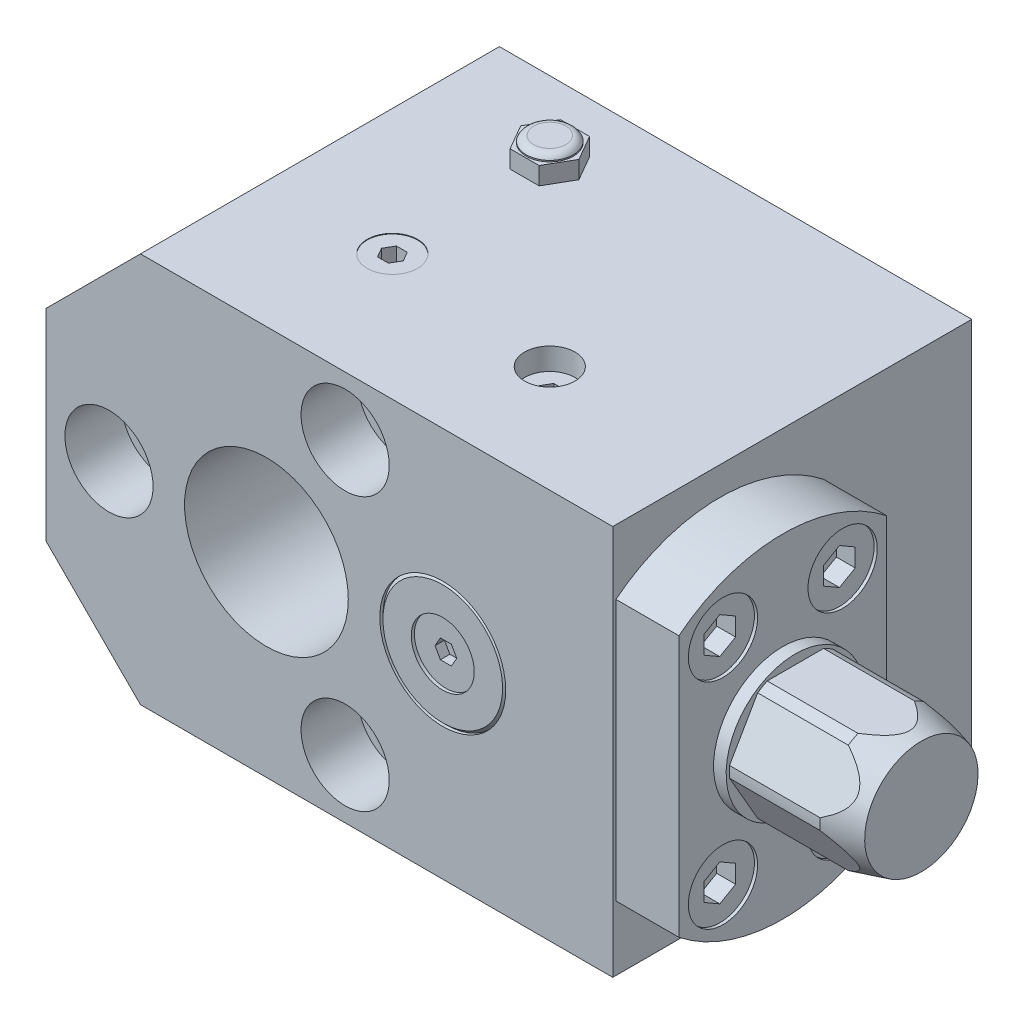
ISO-10303-21;
HEADER;
FILE_DESCRIPTION(('STEP AP214'),'2;1');
FILE_NAME('part.step','',(''),(''),'','','');
FILE_SCHEMA(('AUTOMOTIVE_DESIGN { 1 0 10303 214 1 1 1 1 }'));
ENDSEC;
DATA;
#1=APPLICATION_CONTEXT('core data for automotive mechanical design processes');
#2=APPLICATION_PROTOCOL_DEFINITION('international standard','automotive_design',2000,#1);
#3=PRODUCT_CONTEXT('',#1,'mechanical');
#4=PRODUCT('Part','Part','',(#3));
#5=PRODUCT_RELATED_PRODUCT_CATEGORY('part','',(#4));
#6=PRODUCT_DEFINITION_FORMATION('','',#4);
#7=PRODUCT_DEFINITION_CONTEXT('part definition',#1,'design');
#8=PRODUCT_DEFINITION('design','',#6,#7);
#9=PRODUCT_DEFINITION_SHAPE('','',#8);
#10=(LENGTH_UNIT() NAMED_UNIT(*) SI_UNIT(.MILLI.,.METRE.));
#11=(NAMED_UNIT(*) PLANE_ANGLE_UNIT() SI_UNIT($,.RADIAN.));
#12=(NAMED_UNIT(*) SI_UNIT($,.STERADIAN.) SOLID_ANGLE_UNIT());
#13=UNCERTAINTY_MEASURE_WITH_UNIT(LENGTH_MEASURE(1.E-05),#10,'distance_accuracy_value','');
#14=(GEOMETRIC_REPRESENTATION_CONTEXT(3) GLOBAL_UNCERTAINTY_ASSIGNED_CONTEXT((#13)) GLOBAL_UNIT_ASSIGNED_CONTEXT((#10,
#11,#12)) REPRESENTATION_CONTEXT('',''));
#15=CARTESIAN_POINT('',(0.,0.,0.));
#16=DIRECTION('',(0.,0.,1.));
#17=DIRECTION('',(1.,0.,0.));
#18=AXIS2_PLACEMENT_3D('',#15,#16,#17);
#19=CARTESIAN_POINT('',(122.,0.,29.));
#20=DIRECTION('',(-1.,0.,0.));
#21=DIRECTION('',(0.,1.,0.));
#22=AXIS2_PLACEMENT_3D('',#19,#20,#21);
#23=PLANE('',#22);
#24=CARTESIAN_POINT('',(122.,0.,40.));
#25=DIRECTION('',(-1.,0.,0.));
#26=DIRECTION('',(0.,1.,0.));
#27=AXIS2_PLACEMENT_3D('',#24,#25,#26);
#28=CIRCLE('',#27,9.);
#29=CARTESIAN_POINT('',(122.,9.,40.));
#30=VERTEX_POINT('',#29);
#31=EDGE_CURVE('E843',#30,#30,#28,.T.);
#32=ORIENTED_EDGE('',*,*,#31,.F.);
#33=EDGE_LOOP('',(#32));
#34=FACE_BOUND('',#33,.T.);
#35=ADVANCED_FACE('F14',(#34),#23,.F.);
#36=CARTESIAN_POINT('',(114.649147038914,0.,40.));
#37=DIRECTION('',(-1.,0.,0.));
#38=DIRECTION('',(0.,1.,0.));
#39=AXIS2_PLACEMENT_3D('',#36,#37,#38);
#40=CONICAL_SURFACE('',#39,10.9696551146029,0.261799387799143);
#41=ORIENTED_EDGE('',*,*,#31,.T.);
#42=EDGE_LOOP('',(#41));
#43=FACE_BOUND('',#42,.T.);
#44=CARTESIAN_POINT('',(102.485235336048,9.5,50.5930853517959));
#45=CARTESIAN_POINT('',(103.058272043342,9.5,50.3867862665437));
#46=CARTESIAN_POINT('',(103.630495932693,9.5,50.1781960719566));
#47=CARTESIAN_POINT('',(104.772968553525,9.5,49.755316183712));
#48=CARTESIAN_POINT('',(105.343216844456,9.5,49.5410253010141));
#49=CARTESIAN_POINT('',(106.486069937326,9.5,49.103829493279));
#50=CARTESIAN_POINT('',(107.058652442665,9.5,48.8808660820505));
#51=CARTESIAN_POINT('',(108.200399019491,9.5,48.4265675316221));
#52=CARTESIAN_POINT('',(108.76956355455,9.5,48.1952335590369));
#53=CARTESIAN_POINT('',(109.965186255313,9.5,47.6963864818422));
#54=CARTESIAN_POINT('',(110.591148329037,9.5,47.4276738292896));
#55=CARTESIAN_POINT('',(111.524551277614,9.5,47.0117602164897));
#56=CARTESIAN_POINT('',(111.834838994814,9.5,46.8709448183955));
#57=CARTESIAN_POINT('',(112.453088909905,9.5,46.5843063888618));
#58=CARTESIAN_POINT('',(112.76105117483,9.5,46.4384835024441));
#59=CARTESIAN_POINT('',(113.372877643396,9.5,46.1415186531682));
#60=CARTESIAN_POINT('',(113.676753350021,9.5,45.9904004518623));
#61=CARTESIAN_POINT('',(114.280894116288,9.5,45.6811324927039));
#62=CARTESIAN_POINT('',(114.581159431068,9.5,45.5229832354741));
#63=CARTESIAN_POINT('',(115.176791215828,9.5,45.1982205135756));
#64=CARTESIAN_POINT('',(115.472161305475,9.5,45.0316137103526));
#65=CARTESIAN_POINT('',(116.056614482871,9.5,44.6877594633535));
#66=CARTESIAN_POINT('',(116.345699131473,9.5,44.5105147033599));
#67=CARTESIAN_POINT('',(116.735535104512,9.5,44.2584714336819));
#68=CARTESIAN_POINT('',(116.840095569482,9.5,44.1895511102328));
#69=CARTESIAN_POINT('',(117.047827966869,9.5,44.0496437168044));
#70=CARTESIAN_POINT('',(117.150999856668,9.5,43.9786565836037));
#71=CARTESIAN_POINT('',(117.458244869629,9.5,43.7621982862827));
#72=CARTESIAN_POINT('',(117.659936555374,9.5,43.6133011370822));
#73=CARTESIAN_POINT('',(118.052671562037,9.5,43.3057063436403));
#74=CARTESIAN_POINT('',(118.243798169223,9.5,43.1471158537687));
#75=CARTESIAN_POINT('',(118.61364851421,9.5,42.8161952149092));
#76=CARTESIAN_POINT('',(118.792384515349,9.5,42.6438790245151));
#77=CARTESIAN_POINT('',(119.098374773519,9.5,42.3171328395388));
#78=CARTESIAN_POINT('',(119.228867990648,9.5,42.1657769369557));
#79=CARTESIAN_POINT('',(119.47300937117,9.5,41.8494365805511));
#80=CARTESIAN_POINT('',(119.586630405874,9.5,41.6844308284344));
#81=CARTESIAN_POINT('',(119.79060023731,9.5,41.3365493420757));
#82=CARTESIAN_POINT('',(119.880568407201,9.5,41.1534398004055));
#83=CARTESIAN_POINT('',(119.987805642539,9.5,40.868668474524));
#84=CARTESIAN_POINT('',(120.018911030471,9.5,40.772184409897));
#85=CARTESIAN_POINT('',(120.070628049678,9.5,40.5764702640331));
#86=CARTESIAN_POINT('',(120.09124517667,9.5,40.4772416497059));
#87=CARTESIAN_POINT('',(120.127603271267,9.5,40.231365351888));
#88=CARTESIAN_POINT('',(120.13685521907,9.5,40.0836886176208));
#89=CARTESIAN_POINT('',(120.12950171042,9.5,39.788982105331));
#90=CARTESIAN_POINT('',(120.112886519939,9.5,39.6419525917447));
#91=CARTESIAN_POINT('',(120.056020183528,9.5,39.353476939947));
#92=CARTESIAN_POINT('',(120.015892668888,9.5,39.2120056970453));
#93=CARTESIAN_POINT('',(119.916094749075,9.5,38.9362681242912));
#94=CARTESIAN_POINT('',(119.856418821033,9.5,38.8020038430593));
#95=CARTESIAN_POINT('',(119.728399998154,9.5,38.5542599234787));
#96=CARTESIAN_POINT('',(119.661474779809,9.5,38.4400315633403));
#97=CARTESIAN_POINT('',(119.517828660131,9.5,38.2178498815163));
#98=CARTESIAN_POINT('',(119.441100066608,9.5,38.1099015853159));
#99=CARTESIAN_POINT('',(119.279714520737,9.5,37.8994986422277));
#100=CARTESIAN_POINT('',(119.195028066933,9.5,37.7970668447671));
#101=CARTESIAN_POINT('',(119.019647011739,9.5,37.5975808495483));
#102=CARTESIAN_POINT('',(118.928954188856,9.5,37.5005250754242));
#103=CARTESIAN_POINT('',(118.698256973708,9.5,37.2658543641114));
#104=CARTESIAN_POINT('',(118.555411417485,9.5,37.1310388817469));
#105=CARTESIAN_POINT('',(118.262051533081,9.5,36.8699701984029));
#106=CARTESIAN_POINT('',(118.111532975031,9.5,36.7437218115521));
#107=CARTESIAN_POINT('',(117.804480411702,9.5,36.4982092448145));
#108=CARTESIAN_POINT('',(117.647935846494,9.5,36.3789583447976));
#109=CARTESIAN_POINT('',(117.330389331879,9.5,36.1465382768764));
#110=CARTESIAN_POINT('',(117.169386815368,9.5,36.0333698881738));
#111=CARTESIAN_POINT('',(116.841976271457,9.5,35.8109284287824));
#112=CARTESIAN_POINT('',(116.675527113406,9.5,35.701716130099));
#113=CARTESIAN_POINT('',(116.339733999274,9.5,35.4878361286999));
#114=CARTESIAN_POINT('',(116.170389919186,9.5,35.3831686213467));
#115=CARTESIAN_POINT('',(115.829560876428,9.5,35.177904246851));
#116=CARTESIAN_POINT('',(115.658079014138,9.5,35.077302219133));
#117=CARTESIAN_POINT('',(115.313158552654,9.5,34.8795372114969));
#118=CARTESIAN_POINT('',(115.13972003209,9.5,34.7823740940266));
#119=CARTESIAN_POINT('',(114.547766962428,9.5,34.4574133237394));
#120=CARTESIAN_POINT('',(114.125341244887,9.5,34.2367294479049));
#121=CARTESIAN_POINT('',(113.273919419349,9.5,33.8083699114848));
#122=CARTESIAN_POINT('',(112.844922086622,9.5,33.6006967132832));
#123=CARTESIAN_POINT('',(111.981886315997,9.5,33.1954710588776));
#124=CARTESIAN_POINT('',(111.547845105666,9.5,32.9979245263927));
#125=CARTESIAN_POINT('',(110.676106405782,9.5,32.6110627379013));
#126=CARTESIAN_POINT('',(110.238408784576,9.5,32.4217477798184));
#127=CARTESIAN_POINT('',(109.358755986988,9.5,32.0492864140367));
#128=CARTESIAN_POINT('',(108.916791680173,9.5,31.8661616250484));
#129=CARTESIAN_POINT('',(108.030551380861,9.5,31.5055868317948));
#130=CARTESIAN_POINT('',(107.586275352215,9.5,31.3281369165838));
#131=CARTESIAN_POINT('',(106.695998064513,9.5,30.9781041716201));
#132=CARTESIAN_POINT('',(106.249997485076,9.5,30.805519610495));
#133=CARTESIAN_POINT('',(105.35642465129,9.5,30.4644646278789));
#134=CARTESIAN_POINT('',(104.908852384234,9.5,30.2959942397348));
#135=CARTESIAN_POINT('',(103.665705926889,9.5,29.8336718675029));
#136=CARTESIAN_POINT('',(102.868716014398,9.5,29.5436256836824));
#137=CARTESIAN_POINT('',(101.271515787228,9.5,28.9723121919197));
#138=CARTESIAN_POINT('',(100.471305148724,9.5,28.69104579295));
#139=CARTESIAN_POINT('',(98.8733796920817,9.5,28.1373651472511));
#140=CARTESIAN_POINT('',(98.0756801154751,9.5,27.8649068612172));
#141=CARTESIAN_POINT('',(96.8777208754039,9.5,27.4605978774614));
#142=CARTESIAN_POINT('',(96.478194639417,9.5,27.3265673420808));
#143=CARTESIAN_POINT('',(95.6786991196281,9.5,27.0598387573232));
#144=CARTESIAN_POINT('',(95.2787298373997,9.5,26.9271407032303));
#145=CARTESIAN_POINT('',(94.8785604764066,9.5,26.7950483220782));
#146=B_SPLINE_CURVE_WITH_KNOTS('',3,(#44,#45,#46,#47,#48,#49,#50,#51,#52,#53,#54,#55,#56,#57,
#58,#59,#60,#61,#62,#63,#64,#65,#66,#67,#68,#69,#70,#71,#72,#73,#74,#75,#76,#77,#78,#79,#80,#81,
#82,#83,#84,#85,#86,#87,#88,#89,#90,#91,#92,#93,#94,#95,#96,#97,#98,#99,#100,#101,#102,#103,
#104,#105,#106,#107,#108,#109,#110,#111,#112,#113,#114,#115,#116,#117,#118,#119,#120,#121,#122,
#123,#124,#125,#126,#127,#128,#129,#130,#131,#132,#133,#134,#135,#136,#137,#138,#139,#140,#141,
#142,#143,#144,#145),.UNSPECIFIED.,.F.,.F.,(4,2,2,2,2,2,2,2,2,2,2,2,2,2,2,2,2,2,2,2,2,2,2,2,2,2,
2,2,2,2,2,2,2,2,2,2,2,2,2,2,2,2,2,2,2,2,2,2,2,2,4),(0.,1.82713326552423,3.65465066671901,
5.49797926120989,7.34105193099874,9.38443436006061,10.4066360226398,11.4288081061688,
12.4468675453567,13.4648546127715,14.4820519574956,15.4989937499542,15.8746664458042,
16.2503506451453,17.002113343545,17.7466979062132,18.4905346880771,19.0891789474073,
19.6887755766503,20.2975003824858,20.6011206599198,20.9045816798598,21.3461445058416,
21.7878735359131,22.2273004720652,22.6668516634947,23.0634308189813,23.4603230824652,
23.8587495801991,24.2570586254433,24.8458435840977,25.4349567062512,26.025153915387,
26.6154265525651,27.212578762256,27.8097566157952,28.4061509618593,29.0025214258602,
30.4319613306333,31.8616709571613,33.2922075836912,34.7227959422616,36.1579506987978,
37.5931279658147,39.0277878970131,40.4624594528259,43.0067672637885,45.5513376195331,
48.0801468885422,49.3443715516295,50.6085917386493),.UNSPECIFIED.);
#147=CARTESIAN_POINT('',(116.401923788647,9.5,44.4721359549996));
#148=VERTEX_POINT('',#147);
#149=CARTESIAN_POINT('',(116.401923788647,9.5,35.5278640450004));
#150=VERTEX_POINT('',#149);
#151=EDGE_CURVE('E632',#148,#150,#146,.T.);
#152=ORIENTED_EDGE('',*,*,#151,.F.);
#153=CARTESIAN_POINT('',(116.401923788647,0.,40.));
#154=DIRECTION('',(-1.,0.,0.));
#155=DIRECTION('',(0.,1.,0.));
#156=AXIS2_PLACEMENT_3D('',#153,#154,#155);
#157=CIRCLE('',#156,10.5);
#158=CARTESIAN_POINT('',(116.401923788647,8.62298334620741,45.9911733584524));
#159=VERTEX_POINT('',#158);
#160=EDGE_CURVE('E566',#148,#159,#157,.F.);
#161=ORIENTED_EDGE('',*,*,#160,.T.);
#162=CARTESIAN_POINT('',(114.648947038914,-9.28196428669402E-05,50.9697087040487));
#163=CARTESIAN_POINT('',(114.785646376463,0.0633524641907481,50.9330785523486));
#164=CARTESIAN_POINT('',(114.921890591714,0.12753134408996,50.8960248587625));
#165=CARTESIAN_POINT('',(115.193348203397,0.257526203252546,50.8209722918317));
#166=CARTESIAN_POINT('',(115.328561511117,0.323342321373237,50.7829733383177));
#167=CARTESIAN_POINT('',(115.732923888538,0.523725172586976,50.6672822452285));
#168=CARTESIAN_POINT('',(116.000302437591,0.660999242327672,50.5880270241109));
#169=CARTESIAN_POINT('',(116.531840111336,0.946138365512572,50.4234018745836));
#170=CARTESIAN_POINT('',(116.795923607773,1.09410959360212,50.3379706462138));
#171=CARTESIAN_POINT('',(117.314863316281,1.40154274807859,50.160474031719));
#172=CARTESIAN_POINT('',(117.569726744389,1.56099538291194,50.0684140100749));
#173=CARTESIAN_POINT('',(117.934935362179,1.80681149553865,49.9264920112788));
#174=CARTESIAN_POINT('',(118.050540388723,1.88731783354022,49.8800116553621));
#175=CARTESIAN_POINT('',(118.278040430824,2.05221171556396,49.784810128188));
#176=CARTESIAN_POINT('',(118.389935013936,2.13659970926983,49.7360886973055));
#177=CARTESIAN_POINT('',(118.609013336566,2.30975509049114,49.6361173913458));
#178=CARTESIAN_POINT('',(118.716200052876,2.3985196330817,49.5848691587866));
#179=CARTESIAN_POINT('',(118.924631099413,2.58110804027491,49.4794516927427));
#180=CARTESIAN_POINT('',(119.025876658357,2.67493085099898,49.425283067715));
#181=CARTESIAN_POINT('',(119.276159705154,2.92329501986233,49.2818899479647));
#182=CARTESIAN_POINT('',(119.41971983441,3.0820830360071,49.1902136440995));
#183=CARTESIAN_POINT('',(119.678122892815,3.41636648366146,48.9972150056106));
#184=CARTESIAN_POINT('',(119.793049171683,3.59181132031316,48.8959218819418));
#185=CARTESIAN_POINT('',(119.948502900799,3.89859159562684,48.7188022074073));
#186=CARTESIAN_POINT('',(120.001064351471,4.02528129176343,48.6456578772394));
#187=CARTESIAN_POINT('',(120.081593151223,4.28440842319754,48.4960507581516));
#188=CARTESIAN_POINT('',(120.109593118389,4.4168379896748,48.4195925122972));
#189=CARTESIAN_POINT('',(120.137572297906,4.68474039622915,48.2649189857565));
#190=CARTESIAN_POINT('',(120.137391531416,4.8202262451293,48.1866961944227));
#191=CARTESIAN_POINT('',(120.108641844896,5.08890357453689,48.031575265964));
#192=CARTESIAN_POINT('',(120.080055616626,5.22209360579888,47.9546779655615));
#193=CARTESIAN_POINT('',(119.989492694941,5.50996930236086,47.7884728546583));
#194=CARTESIAN_POINT('',(119.921744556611,5.66326283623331,47.6999687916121));
#195=CARTESIAN_POINT('',(119.759068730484,5.95858950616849,47.5294618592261));
#196=CARTESIAN_POINT('',(119.664079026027,6.10059599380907,47.4474743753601));
#197=CARTESIAN_POINT('',(119.46665369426,6.35816710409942,47.2987656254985));
#198=CARTESIAN_POINT('',(119.36622597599,6.47491512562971,47.2313611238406));
#199=CARTESIAN_POINT('',(119.154196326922,6.70061509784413,47.1010531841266));
#200=CARTESIAN_POINT('',(119.042584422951,6.80955993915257,47.0381538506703));
#201=CARTESIAN_POINT('',(118.810311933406,7.0213454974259,46.9158794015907));
#202=CARTESIAN_POINT('',(118.689593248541,7.12413791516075,46.8565321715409));
#203=CARTESIAN_POINT('',(118.441879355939,7.32374964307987,46.7412862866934));
#204=CARTESIAN_POINT('',(118.314886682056,7.42057132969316,46.6853862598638));
#205=CARTESIAN_POINT('',(118.048320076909,7.61475267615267,46.5732756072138));
#206=CARTESIAN_POINT('',(117.908446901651,7.71180263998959,46.5172437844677));
#207=CARTESIAN_POINT('',(117.624393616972,7.90107178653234,46.407969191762));
#208=CARTESIAN_POINT('',(117.480212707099,7.99329006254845,46.3547269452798));
#209=CARTESIAN_POINT('',(117.042219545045,8.26397622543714,46.1984462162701));
#210=CARTESIAN_POINT('',(116.743293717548,8.43623709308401,46.0989913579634));
#211=CARTESIAN_POINT('',(116.147735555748,8.76211341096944,45.9108465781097));
#212=CARTESIAN_POINT('',(115.851429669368,8.91618353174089,45.8218941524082));
#213=CARTESIAN_POINT('',(115.402944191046,9.14021237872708,45.6925510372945));
#214=CARTESIAN_POINT('',(115.253027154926,9.21359464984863,45.6501837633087));
#215=CARTESIAN_POINT('',(114.951907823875,9.35831617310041,45.5666287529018));
#216=CARTESIAN_POINT('',(114.800705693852,9.42965568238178,45.5254408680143));
#217=CARTESIAN_POINT('',(114.648947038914,9.50009281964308,45.4847739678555));
#218=B_SPLINE_CURVE_WITH_KNOTS('',3,(#162,#163,#164,#165,#166,#167,#168,#169,#170,#171,#172,
#173,#174,#175,#176,#177,#178,#179,#180,#181,#182,#183,#184,#185,#186,#187,#188,#189,#190,#191,
#192,#193,#194,#195,#196,#197,#198,#199,#200,#201,#202,#203,#204,#205,#206,#207,#208,#209,#210,
#211,#212,#213,#214,#215,#216,#217),.UNSPECIFIED.,.F.,.F.,(4,2,2,2,2,2,2,2,2,2,2,2,2,2,2,2,2,2,
2,2,2,2,2,2,2,2,2,4),(0.,0.465271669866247,0.930582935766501,1.86288009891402,2.80621835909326,
3.74880160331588,4.19374668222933,4.63874343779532,5.08345464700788,5.5280735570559,
6.22496409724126,6.91980172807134,7.38441639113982,7.84841309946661,8.31504396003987,
8.7819593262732,9.34736634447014,9.9140708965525,10.4176521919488,10.9216866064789,
11.429264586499,11.9366392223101,12.474153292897,13.0117678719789,14.088299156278,
15.1248861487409,15.6414873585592,16.1580232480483),.UNSPECIFIED.);
#219=CARTESIAN_POINT('',(116.401923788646,0.87701665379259,50.463309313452));
#220=VERTEX_POINT('',#219);
#221=EDGE_CURVE('E640',#220,#159,#218,.T.);
#222=ORIENTED_EDGE('',*,*,#221,.F.);
#223=CARTESIAN_POINT('',(116.401923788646,-0.877016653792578,50.463309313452));
#224=VERTEX_POINT('',#223);
#225=EDGE_CURVE('E856',#220,#224,#157,.F.);
#226=ORIENTED_EDGE('',*,*,#225,.T.);
#227=CARTESIAN_POINT('',(114.648947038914,-9.50009281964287,45.4847739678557));
#228=CARTESIAN_POINT('',(114.785646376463,-9.4366475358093,45.5214041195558));
#229=CARTESIAN_POINT('',(114.921890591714,-9.3724686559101,45.5584578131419));
#230=CARTESIAN_POINT('',(115.193348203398,-9.24247379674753,45.6335103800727));
#231=CARTESIAN_POINT('',(115.328561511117,-9.17665767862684,45.6715093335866));
#232=CARTESIAN_POINT('',(115.732923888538,-8.97627482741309,45.7872004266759));
#233=CARTESIAN_POINT('',(116.000302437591,-8.8390007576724,45.8664556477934));
#234=CARTESIAN_POINT('',(116.531840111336,-8.55386163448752,46.0310807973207));
#235=CARTESIAN_POINT('',(116.795923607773,-8.40589040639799,46.1165120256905));
#236=CARTESIAN_POINT('',(117.314863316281,-8.09845725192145,46.2940086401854));
#237=CARTESIAN_POINT('',(117.569726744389,-7.939004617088,46.3860686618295));
#238=CARTESIAN_POINT('',(117.934935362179,-7.69318850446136,46.5279906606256));
#239=CARTESIAN_POINT('',(118.050540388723,-7.61268216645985,46.5744710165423));
#240=CARTESIAN_POINT('',(118.278040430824,-7.44778828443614,46.6696725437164));
#241=CARTESIAN_POINT('',(118.389935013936,-7.36340029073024,46.7183939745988));
#242=CARTESIAN_POINT('',(118.609013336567,-7.19024490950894,46.8183652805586));
#243=CARTESIAN_POINT('',(118.716200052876,-7.10148036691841,46.8696135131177));
#244=CARTESIAN_POINT('',(118.924631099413,-6.91889195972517,46.9750309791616));
#245=CARTESIAN_POINT('',(119.025876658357,-6.82506914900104,47.0291996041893));
#246=CARTESIAN_POINT('',(119.276159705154,-6.57670498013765,47.1725927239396));
#247=CARTESIAN_POINT('',(119.41971983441,-6.41791696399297,47.2642690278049));
#248=CARTESIAN_POINT('',(119.678122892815,-6.08363351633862,47.4572676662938));
#249=CARTESIAN_POINT('',(119.793049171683,-5.90818867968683,47.5585607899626));
#250=CARTESIAN_POINT('',(119.948502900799,-5.60140840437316,47.7356804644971));
#251=CARTESIAN_POINT('',(120.001064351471,-5.4747187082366,47.808824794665));
#252=CARTESIAN_POINT('',(120.081593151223,-5.21559157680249,47.9584319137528));
#253=CARTESIAN_POINT('',(120.109593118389,-5.08316201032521,48.0348901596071));
#254=CARTESIAN_POINT('',(120.137572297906,-4.81525960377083,48.1895636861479));
#255=CARTESIAN_POINT('',(120.137391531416,-4.67977375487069,48.2677864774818));
#256=CARTESIAN_POINT('',(120.108641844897,-4.4110964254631,48.4229074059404));
#257=CARTESIAN_POINT('',(120.080055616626,-4.27790639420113,48.4998047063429));
#258=CARTESIAN_POINT('',(119.989492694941,-3.99003069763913,48.6660098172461));
#259=CARTESIAN_POINT('',(119.921744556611,-3.83673716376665,48.7545138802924));
#260=CARTESIAN_POINT('',(119.759068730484,-3.54141049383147,48.9250208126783));
#261=CARTESIAN_POINT('',(119.664079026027,-3.39940400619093,49.0070082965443));
#262=CARTESIAN_POINT('',(119.46665369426,-3.14183289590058,49.1557170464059));
#263=CARTESIAN_POINT('',(119.36622597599,-3.02508487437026,49.2231215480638));
#264=CARTESIAN_POINT('',(119.154196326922,-2.79938490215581,49.3534294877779));
#265=CARTESIAN_POINT('',(119.042584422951,-2.69044006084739,49.4163288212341));
#266=CARTESIAN_POINT('',(118.810311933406,-2.47865450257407,49.5386032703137));
#267=CARTESIAN_POINT('',(118.689593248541,-2.3758620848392,49.5979505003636));
#268=CARTESIAN_POINT('',(118.441879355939,-2.1762503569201,49.7131963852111));
#269=CARTESIAN_POINT('',(118.314886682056,-2.07942867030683,49.7690964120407));
#270=CARTESIAN_POINT('',(118.048320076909,-1.88524732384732,49.8812070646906));
#271=CARTESIAN_POINT('',(117.908446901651,-1.78819736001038,49.9372388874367));
#272=CARTESIAN_POINT('',(117.624393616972,-1.59892821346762,50.0465134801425));
#273=CARTESIAN_POINT('',(117.480212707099,-1.50670993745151,50.0997557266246));
#274=CARTESIAN_POINT('',(117.042219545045,-1.23602377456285,50.2560364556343));
#275=CARTESIAN_POINT('',(116.743293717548,-1.06376290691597,50.355491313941));
#276=CARTESIAN_POINT('',(116.147735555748,-0.73788658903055,50.5436360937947));
#277=CARTESIAN_POINT('',(115.851429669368,-0.583816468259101,50.6325885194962));
#278=CARTESIAN_POINT('',(115.402944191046,-0.359787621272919,50.7619316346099));
#279=CARTESIAN_POINT('',(115.253027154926,-0.286405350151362,50.8042989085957));
#280=CARTESIAN_POINT('',(114.951907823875,-0.141683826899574,50.8878539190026));
#281=CARTESIAN_POINT('',(114.800705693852,-0.0703443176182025,50.9290418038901));
#282=CARTESIAN_POINT('',(114.648947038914,9.2819643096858E-05,50.9697087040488));
#283=B_SPLINE_CURVE_WITH_KNOTS('',3,(#227,#228,#229,#230,#231,#232,#233,#234,#235,#236,#237,
#238,#239,#240,#241,#242,#243,#244,#245,#246,#247,#248,#249,#250,#251,#252,#253,#254,#255,#256,
#257,#258,#259,#260,#261,#262,#263,#264,#265,#266,#267,#268,#269,#270,#271,#272,#273,#274,#275,
#276,#277,#278,#279,#280,#281,#282),.UNSPECIFIED.,.F.,.F.,(4,2,2,2,2,2,2,2,2,2,2,2,2,2,2,2,2,2,
2,2,2,2,2,2,2,2,2,4),(0.,0.465271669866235,0.930582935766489,1.86288009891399,2.80621835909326,
3.7488016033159,4.19374668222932,4.63874343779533,5.08345464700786,5.52807355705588,
6.22496409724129,6.91980172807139,7.38441639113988,7.84841309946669,8.31504396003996,
8.78195932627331,9.34736634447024,9.91407089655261,10.417652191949,10.921686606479,
11.4292645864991,11.9366392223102,12.4741532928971,13.011767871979,14.0882991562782,
15.124886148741,15.6414873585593,16.1580232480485),.UNSPECIFIED.);
#284=CARTESIAN_POINT('',(116.401923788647,-8.62298334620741,45.9911733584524));
#285=VERTEX_POINT('',#284);
#286=EDGE_CURVE('E646',#285,#224,#283,.T.);
#287=ORIENTED_EDGE('',*,*,#286,.F.);
#288=CARTESIAN_POINT('',(116.401923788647,-9.5,44.4721359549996));
#289=VERTEX_POINT('',#288);
#290=EDGE_CURVE('E862',#285,#289,#157,.F.);
#291=ORIENTED_EDGE('',*,*,#290,.T.);
#292=CARTESIAN_POINT('',(102.485235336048,-9.5,50.5930853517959));
#293=CARTESIAN_POINT('',(103.058272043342,-9.5,50.3867862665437));
#294=CARTESIAN_POINT('',(103.630495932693,-9.5,50.1781960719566));
#295=CARTESIAN_POINT('',(104.772968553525,-9.5,49.755316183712));
#296=CARTESIAN_POINT('',(105.343216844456,-9.5,49.5410253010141));
#297=CARTESIAN_POINT('',(106.486069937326,-9.5,49.103829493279));
#298=CARTESIAN_POINT('',(107.058652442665,-9.5,48.8808660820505));
#299=CARTESIAN_POINT('',(108.200399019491,-9.5,48.4265675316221));
#300=CARTESIAN_POINT('',(108.76956355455,-9.5,48.1952335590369));
#301=CARTESIAN_POINT('',(109.965186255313,-9.5,47.6963864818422));
#302=CARTESIAN_POINT('',(110.591148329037,-9.5,47.4276738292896));
#303=CARTESIAN_POINT('',(111.524551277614,-9.5,47.0117602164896));
#304=CARTESIAN_POINT('',(111.834838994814,-9.5,46.8709448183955));
#305=CARTESIAN_POINT('',(112.453088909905,-9.5,46.5843063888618));
#306=CARTESIAN_POINT('',(112.76105117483,-9.5,46.4384835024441));
#307=CARTESIAN_POINT('',(113.372877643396,-9.5,46.1415186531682));
#308=CARTESIAN_POINT('',(113.676753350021,-9.5,45.9904004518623));
#309=CARTESIAN_POINT('',(114.280894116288,-9.5,45.6811324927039));
#310=CARTESIAN_POINT('',(114.581159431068,-9.5,45.5229832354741));
#311=CARTESIAN_POINT('',(115.176791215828,-9.5,45.1982205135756));
#312=CARTESIAN_POINT('',(115.472161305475,-9.5,45.0316137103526));
#313=CARTESIAN_POINT('',(116.056614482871,-9.5,44.6877594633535));
#314=CARTESIAN_POINT('',(116.345699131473,-9.5,44.5105147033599));
#315=CARTESIAN_POINT('',(116.735535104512,-9.5,44.2584714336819));
#316=CARTESIAN_POINT('',(116.840095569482,-9.5,44.1895511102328));
#317=CARTESIAN_POINT('',(117.047827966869,-9.5,44.0496437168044));
#318=CARTESIAN_POINT('',(117.150999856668,-9.5,43.9786565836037));
#319=CARTESIAN_POINT('',(117.458244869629,-9.5,43.7621982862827));
#320=CARTESIAN_POINT('',(117.659936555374,-9.5,43.6133011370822));
#321=CARTESIAN_POINT('',(118.052671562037,-9.5,43.3057063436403));
#322=CARTESIAN_POINT('',(118.243798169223,-9.5,43.1471158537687));
#323=CARTESIAN_POINT('',(118.61364851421,-9.5,42.8161952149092));
#324=CARTESIAN_POINT('',(118.792384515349,-9.5,42.6438790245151));
#325=CARTESIAN_POINT('',(119.098374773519,-9.5,42.3171328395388));
#326=CARTESIAN_POINT('',(119.228867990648,-9.5,42.1657769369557));
#327=CARTESIAN_POINT('',(119.47300937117,-9.5,41.8494365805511));
#328=CARTESIAN_POINT('',(119.586630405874,-9.5,41.6844308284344));
#329=CARTESIAN_POINT('',(119.79060023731,-9.5,41.3365493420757));
#330=CARTESIAN_POINT('',(119.880568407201,-9.5,41.1534398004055));
#331=CARTESIAN_POINT('',(119.987805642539,-9.5,40.868668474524));
#332=CARTESIAN_POINT('',(120.018911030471,-9.5,40.772184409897));
#333=CARTESIAN_POINT('',(120.070628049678,-9.5,40.5764702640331));
#334=CARTESIAN_POINT('',(120.09124517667,-9.5,40.4772416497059));
#335=CARTESIAN_POINT('',(120.127603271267,-9.5,40.231365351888));
#336=CARTESIAN_POINT('',(120.13685521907,-9.5,40.0836886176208));
#337=CARTESIAN_POINT('',(120.12950171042,-9.5,39.788982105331));
#338=CARTESIAN_POINT('',(120.112886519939,-9.5,39.6419525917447));
#339=CARTESIAN_POINT('',(120.056020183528,-9.5,39.353476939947));
#340=CARTESIAN_POINT('',(120.015892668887,-9.5,39.2120056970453));
#341=CARTESIAN_POINT('',(119.916094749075,-9.5,38.9362681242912));
#342=CARTESIAN_POINT('',(119.856418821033,-9.5,38.8020038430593));
#343=CARTESIAN_POINT('',(119.728399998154,-9.5,38.5542599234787));
#344=CARTESIAN_POINT('',(119.661474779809,-9.5,38.4400315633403));
#345=CARTESIAN_POINT('',(119.517828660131,-9.5,38.2178498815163));
#346=CARTESIAN_POINT('',(119.441100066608,-9.5,38.1099015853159));
#347=CARTESIAN_POINT('',(119.279714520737,-9.5,37.8994986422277));
#348=CARTESIAN_POINT('',(119.195028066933,-9.5,37.7970668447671));
#349=CARTESIAN_POINT('',(119.019647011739,-9.5,37.5975808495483));
#350=CARTESIAN_POINT('',(118.928954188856,-9.5,37.5005250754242));
#351=CARTESIAN_POINT('',(118.698256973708,-9.5,37.2658543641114));
#352=CARTESIAN_POINT('',(118.555411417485,-9.5,37.1310388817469));
#353=CARTESIAN_POINT('',(118.262051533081,-9.5,36.8699701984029));
#354=CARTESIAN_POINT('',(118.111532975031,-9.5,36.7437218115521));
#355=CARTESIAN_POINT('',(117.804480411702,-9.5,36.4982092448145));
#356=CARTESIAN_POINT('',(117.647935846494,-9.5,36.3789583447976));
#357=CARTESIAN_POINT('',(117.330389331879,-9.5,36.1465382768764));
#358=CARTESIAN_POINT('',(117.169386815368,-9.5,36.0333698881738));
#359=CARTESIAN_POINT('',(116.841976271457,-9.5,35.8109284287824));
#360=CARTESIAN_POINT('',(116.675527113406,-9.5,35.701716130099));
#361=CARTESIAN_POINT('',(116.339733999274,-9.5,35.4878361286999));
#362=CARTESIAN_POINT('',(116.170389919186,-9.5,35.3831686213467));
#363=CARTESIAN_POINT('',(115.829560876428,-9.5,35.177904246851));
#364=CARTESIAN_POINT('',(115.658079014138,-9.5,35.077302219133));
#365=CARTESIAN_POINT('',(115.313158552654,-9.5,34.8795372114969));
#366=CARTESIAN_POINT('',(115.13972003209,-9.5,34.7823740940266));
#367=CARTESIAN_POINT('',(114.547766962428,-9.5,34.4574133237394));
#368=CARTESIAN_POINT('',(114.125341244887,-9.5,34.2367294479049));
#369=CARTESIAN_POINT('',(113.273919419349,-9.5,33.8083699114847));
#370=CARTESIAN_POINT('',(112.844922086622,-9.5,33.6006967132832));
#371=CARTESIAN_POINT('',(111.981886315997,-9.5,33.1954710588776));
#372=CARTESIAN_POINT('',(111.547845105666,-9.5,32.9979245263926));
#373=CARTESIAN_POINT('',(110.676106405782,-9.5,32.6110627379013));
#374=CARTESIAN_POINT('',(110.238408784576,-9.5,32.4217477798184));
#375=CARTESIAN_POINT('',(109.358755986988,-9.5,32.0492864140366));
#376=CARTESIAN_POINT('',(108.916791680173,-9.5,31.8661616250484));
#377=CARTESIAN_POINT('',(108.030551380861,-9.5,31.5055868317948));
#378=CARTESIAN_POINT('',(107.586275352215,-9.5,31.3281369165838));
#379=CARTESIAN_POINT('',(106.695998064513,-9.5,30.9781041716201));
#380=CARTESIAN_POINT('',(106.249997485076,-9.5,30.805519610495));
#381=CARTESIAN_POINT('',(105.35642465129,-9.5,30.4644646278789));
#382=CARTESIAN_POINT('',(104.908852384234,-9.5,30.2959942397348));
#383=CARTESIAN_POINT('',(103.665705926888,-9.5,29.8336718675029));
#384=CARTESIAN_POINT('',(102.868716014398,-9.5,29.5436256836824));
#385=CARTESIAN_POINT('',(101.271515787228,-9.5,28.9723121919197));
#386=CARTESIAN_POINT('',(100.471305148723,-9.5,28.69104579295));
#387=CARTESIAN_POINT('',(98.8733796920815,-9.5,28.137365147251));
#388=CARTESIAN_POINT('',(98.075680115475,-9.5,27.8649068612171));
#389=CARTESIAN_POINT('',(96.8777208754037,-9.5,27.4605978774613));
#390=CARTESIAN_POINT('',(96.4781946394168,-9.5,27.3265673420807));
#391=CARTESIAN_POINT('',(95.6786991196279,-9.5,27.0598387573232));
#392=CARTESIAN_POINT('',(95.2787298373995,-9.5,26.9271407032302));
#393=CARTESIAN_POINT('',(94.8785604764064,-9.5,26.7950483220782));
#394=B_SPLINE_CURVE_WITH_KNOTS('',3,(#292,#293,#294,#295,#296,#297,#298,#299,#300,#301,#302,
#303,#304,#305,#306,#307,#308,#309,#310,#311,#312,#313,#314,#315,#316,#317,#318,#319,#320,#321,
#322,#323,#324,#325,#326,#327,#328,#329,#330,#331,#332,#333,#334,#335,#336,#337,#338,#339,#340,
#341,#342,#343,#344,#345,#346,#347,#348,#349,#350,#351,#352,#353,#354,#355,#356,#357,#358,#359,
#360,#361,#362,#363,#364,#365,#366,#367,#368,#369,#370,#371,#372,#373,#374,#375,#376,#377,#378,
#379,#380,#381,#382,#383,#384,#385,#386,#387,#388,#389,#390,#391,#392,#393),.UNSPECIFIED.,.F.,
.F.,(4,2,2,2,2,2,2,2,2,2,2,2,2,2,2,2,2,2,2,2,2,2,2,2,2,2,2,2,2,2,2,2,2,2,2,2,2,2,2,2,2,2,2,2,2,
2,2,2,2,2,4),(0.,1.82713326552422,3.65465066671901,5.49797926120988,7.34105193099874,
9.38443436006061,10.4066360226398,11.4288081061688,12.4468675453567,13.4648546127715,
14.4820519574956,15.4989937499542,15.8746664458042,16.2503506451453,17.002113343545,
17.7466979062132,18.4905346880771,19.0891789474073,19.6887755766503,20.2975003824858,
20.6011206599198,20.9045816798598,21.3461445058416,21.7878735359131,22.2273004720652,
22.6668516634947,23.0634308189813,23.4603230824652,23.8587495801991,24.2570586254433,
24.8458435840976,25.4349567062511,26.025153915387,26.6154265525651,27.212578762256,
27.8097566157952,28.4061509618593,29.0025214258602,30.4319613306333,31.8616709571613,
33.2922075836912,34.7227959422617,36.1579506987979,37.5931279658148,39.0277878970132,
40.462459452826,43.0067672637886,45.5513376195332,48.0801468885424,49.3443715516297,
50.6085917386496),.UNSPECIFIED.);
#395=CARTESIAN_POINT('',(116.401923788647,-9.5,35.5278640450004));
#396=VERTEX_POINT('',#395);
#397=EDGE_CURVE('E596',#396,#289,#394,.F.);
#398=ORIENTED_EDGE('',*,*,#397,.F.);
#399=CARTESIAN_POINT('',(116.401923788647,-8.62298334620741,34.0088266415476));
#400=VERTEX_POINT('',#399);
#401=EDGE_CURVE('E864',#396,#400,#157,.F.);
#402=ORIENTED_EDGE('',*,*,#401,.T.);
#403=CARTESIAN_POINT('',(114.648947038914,9.28196428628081E-05,29.0302912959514));
#404=CARTESIAN_POINT('',(114.785646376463,-0.063352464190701,29.0669214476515));
#405=CARTESIAN_POINT('',(114.921890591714,-0.12753134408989,29.1039751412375));
#406=CARTESIAN_POINT('',(115.193348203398,-0.257526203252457,29.1790277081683));
#407=CARTESIAN_POINT('',(115.328561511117,-0.323342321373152,29.2170266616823));
#408=CARTESIAN_POINT('',(115.732923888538,-0.523725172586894,29.3327177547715));
#409=CARTESIAN_POINT('',(116.000302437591,-0.660999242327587,29.4119729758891));
#410=CARTESIAN_POINT('',(116.531840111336,-0.946138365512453,29.5765981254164));
#411=CARTESIAN_POINT('',(116.795923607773,-1.09410959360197,29.6620293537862));
#412=CARTESIAN_POINT('',(117.314863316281,-1.40154274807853,29.839525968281));
#413=CARTESIAN_POINT('',(117.569726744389,-1.56099538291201,29.9315859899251));
#414=CARTESIAN_POINT('',(117.934935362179,-1.80681149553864,30.0735079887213));
#415=CARTESIAN_POINT('',(118.050540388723,-1.88731783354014,30.1199883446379));
#416=CARTESIAN_POINT('',(118.278040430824,-2.05221171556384,30.215189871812));
#417=CARTESIAN_POINT('',(118.389935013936,-2.13659970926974,30.2639113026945));
#418=CARTESIAN_POINT('',(118.609013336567,-2.30975509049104,30.3638826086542));
#419=CARTESIAN_POINT('',(118.716200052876,-2.39851963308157,30.4151308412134));
#420=CARTESIAN_POINT('',(118.924631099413,-2.58110804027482,30.5205483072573));
#421=CARTESIAN_POINT('',(119.025876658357,-2.67493085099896,30.574716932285));
#422=CARTESIAN_POINT('',(119.276159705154,-2.92329501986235,30.7181100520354));
#423=CARTESIAN_POINT('',(119.419719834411,-3.08208303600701,30.8097863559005));
#424=CARTESIAN_POINT('',(119.678122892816,-3.41636648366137,31.0027849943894));
#425=CARTESIAN_POINT('',(119.793049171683,-3.59181132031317,31.1040781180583));
#426=CARTESIAN_POINT('',(119.948502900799,-3.89859159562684,31.2811977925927));
#427=CARTESIAN_POINT('',(120.001064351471,-4.02528129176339,31.3543421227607));
#428=CARTESIAN_POINT('',(120.081593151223,-4.28440842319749,31.5039492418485));
#429=CARTESIAN_POINT('',(120.109593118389,-4.41683798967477,31.5804074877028));
#430=CARTESIAN_POINT('',(120.137572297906,-4.68474039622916,31.7350810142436));
#431=CARTESIAN_POINT('',(120.137391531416,-4.82022624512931,31.8133038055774));
#432=CARTESIAN_POINT('',(120.108641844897,-5.0889035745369,31.968424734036));
#433=CARTESIAN_POINT('',(120.080055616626,-5.22209360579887,32.0453220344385));
#434=CARTESIAN_POINT('',(119.989492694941,-5.50996930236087,32.2115271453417));
#435=CARTESIAN_POINT('',(119.921744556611,-5.66326283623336,32.300031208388));
#436=CARTESIAN_POINT('',(119.759068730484,-5.95858950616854,32.470538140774));
#437=CARTESIAN_POINT('',(119.664079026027,-6.10059599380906,32.55252562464));
#438=CARTESIAN_POINT('',(119.46665369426,-6.35816710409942,32.7012343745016));
#439=CARTESIAN_POINT('',(119.36622597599,-6.47491512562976,32.7686388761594));
#440=CARTESIAN_POINT('',(119.154196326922,-6.70061509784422,32.8989468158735));
#441=CARTESIAN_POINT('',(119.042584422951,-6.80955993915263,32.9618461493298));
#442=CARTESIAN_POINT('',(118.810311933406,-7.02134549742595,33.0841205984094));
#443=CARTESIAN_POINT('',(118.689593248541,-7.12413791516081,33.1434678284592));
#444=CARTESIAN_POINT('',(118.441879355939,-7.3237496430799,33.2587137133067));
#445=CARTESIAN_POINT('',(118.314886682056,-7.42057132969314,33.3146137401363));
#446=CARTESIAN_POINT('',(118.048320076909,-7.61475267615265,33.4267243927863));
#447=CARTESIAN_POINT('',(117.908446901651,-7.71180263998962,33.4827562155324));
#448=CARTESIAN_POINT('',(117.624393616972,-7.90107178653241,33.5920308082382));
#449=CARTESIAN_POINT('',(117.480212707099,-7.99329006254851,33.6452730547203));
#450=CARTESIAN_POINT('',(117.042219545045,-8.26397622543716,33.8015537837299));
#451=CARTESIAN_POINT('',(116.743293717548,-8.43623709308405,33.9010086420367));
#452=CARTESIAN_POINT('',(116.147735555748,-8.76211341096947,34.0891534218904));
#453=CARTESIAN_POINT('',(115.851429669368,-8.91618353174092,34.1781058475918));
#454=CARTESIAN_POINT('',(115.402944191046,-9.1402123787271,34.3074489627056));
#455=CARTESIAN_POINT('',(115.253027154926,-9.21359464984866,34.3498162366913));
#456=CARTESIAN_POINT('',(114.951907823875,-9.35831617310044,34.4333712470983));
#457=CARTESIAN_POINT('',(114.800705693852,-9.4296556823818,34.4745591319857));
#458=CARTESIAN_POINT('',(114.648947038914,-9.50009281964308,34.5152260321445));
#459=B_SPLINE_CURVE_WITH_KNOTS('',3,(#403,#404,#405,#406,#407,#408,#409,#410,#411,#412,#413,
#414,#415,#416,#417,#418,#419,#420,#421,#422,#423,#424,#425,#426,#427,#428,#429,#430,#431,#432,
#433,#434,#435,#436,#437,#438,#439,#440,#441,#442,#443,#444,#445,#446,#447,#448,#449,#450,#451,
#452,#453,#454,#455,#456,#457,#458),.UNSPECIFIED.,.F.,.F.,(4,2,2,2,2,2,2,2,2,2,2,2,2,2,2,2,2,2,
2,2,2,2,2,2,2,2,2,4),(0.,0.465271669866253,0.930582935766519,1.862880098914,2.80621835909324,
3.7488016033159,4.19374668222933,4.63874343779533,5.08345464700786,5.52807355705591,
6.22496409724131,6.9198017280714,7.3844163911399,7.84841309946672,8.31504396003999,
8.78195932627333,9.34736634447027,9.91407089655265,10.417652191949,10.9216866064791,
11.4292645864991,11.9366392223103,12.4741532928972,13.0117678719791,14.0882991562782,
15.124886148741,15.6414873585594,16.1580232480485),.UNSPECIFIED.);
#460=CARTESIAN_POINT('',(116.401923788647,-0.877016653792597,29.536690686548));
#461=VERTEX_POINT('',#460);
#462=EDGE_CURVE('E587',#461,#400,#459,.T.);
#463=ORIENTED_EDGE('',*,*,#462,.F.);
#464=CARTESIAN_POINT('',(116.401923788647,0.877016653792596,29.536690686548));
#465=VERTEX_POINT('',#464);
#466=EDGE_CURVE('E564',#461,#465,#157,.F.);
#467=ORIENTED_EDGE('',*,*,#466,.T.);
#468=CARTESIAN_POINT('',(114.648947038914,9.50009281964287,34.5152260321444));
#469=CARTESIAN_POINT('',(114.785646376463,9.43664753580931,34.4785958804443));
#470=CARTESIAN_POINT('',(114.921890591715,9.37246865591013,34.4415421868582));
#471=CARTESIAN_POINT('',(115.193348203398,9.24247379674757,34.3664896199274));
#472=CARTESIAN_POINT('',(115.328561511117,9.17665767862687,34.3284906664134));
#473=CARTESIAN_POINT('',(115.732923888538,8.97627482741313,34.2127995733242));
#474=CARTESIAN_POINT('',(116.000302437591,8.83900075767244,34.1335443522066));
#475=CARTESIAN_POINT('',(116.531840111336,8.55386163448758,33.9689192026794));
#476=CARTESIAN_POINT('',(116.795923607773,8.40589040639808,33.8834879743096));
#477=CARTESIAN_POINT('',(117.314863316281,8.09845725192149,33.7059913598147));
#478=CARTESIAN_POINT('',(117.569726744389,7.93900461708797,33.6139313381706));
#479=CARTESIAN_POINT('',(117.934935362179,7.69318850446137,33.4720093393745));
#480=CARTESIAN_POINT('',(118.050540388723,7.61268216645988,33.4255289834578));
#481=CARTESIAN_POINT('',(118.278040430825,7.4477882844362,33.3303274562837));
#482=CARTESIAN_POINT('',(118.389935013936,7.3634002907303,33.2816060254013));
#483=CARTESIAN_POINT('',(118.609013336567,7.190244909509,33.1816347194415));
#484=CARTESIAN_POINT('',(118.716200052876,7.10148036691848,33.1303864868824));
#485=CARTESIAN_POINT('',(118.924631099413,6.91889195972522,33.0249690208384));
#486=CARTESIAN_POINT('',(119.025876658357,6.82506914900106,32.9708003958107));
#487=CARTESIAN_POINT('',(119.276159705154,6.57670498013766,32.8274072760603));
#488=CARTESIAN_POINT('',(119.419719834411,6.41791696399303,32.7357309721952));
#489=CARTESIAN_POINT('',(119.678122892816,6.08363351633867,32.5427323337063));
#490=CARTESIAN_POINT('',(119.793049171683,5.90818867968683,32.4414392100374));
#491=CARTESIAN_POINT('',(119.948502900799,5.60140840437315,32.264319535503));
#492=CARTESIAN_POINT('',(120.001064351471,5.47471870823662,32.191175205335));
#493=CARTESIAN_POINT('',(120.081593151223,5.21559157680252,32.0415680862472));
#494=CARTESIAN_POINT('',(120.109593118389,5.08316201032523,31.9651098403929));
#495=CARTESIAN_POINT('',(120.137572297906,4.81525960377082,31.8104363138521));
#496=CARTESIAN_POINT('',(120.137391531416,4.67977375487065,31.7322135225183));
#497=CARTESIAN_POINT('',(120.108641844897,4.41109642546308,31.5770925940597));
#498=CARTESIAN_POINT('',(120.080055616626,4.27790639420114,31.5001952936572));
#499=CARTESIAN_POINT('',(119.989492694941,3.99003069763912,31.333990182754));
#500=CARTESIAN_POINT('',(119.921744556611,3.83673716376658,31.2454861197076));
#501=CARTESIAN_POINT('',(119.759068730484,3.54141049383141,31.0749791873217));
#502=CARTESIAN_POINT('',(119.664079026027,3.39940400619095,30.9929917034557));
#503=CARTESIAN_POINT('',(119.46665369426,3.14183289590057,30.8442829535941));
#504=CARTESIAN_POINT('',(119.36622597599,3.02508487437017,30.7768784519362));
#505=CARTESIAN_POINT('',(119.154196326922,2.79938490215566,30.6465705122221));
#506=CARTESIAN_POINT('',(119.042584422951,2.69044006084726,30.5836711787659));
#507=CARTESIAN_POINT('',(118.810311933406,2.47865450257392,30.4613967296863));
#508=CARTESIAN_POINT('',(118.689593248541,2.37586208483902,30.4020494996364));
#509=CARTESIAN_POINT('',(118.441879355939,2.17625035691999,30.2868036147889));
#510=CARTESIAN_POINT('',(118.314886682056,2.07942867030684,30.2309035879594));
#511=CARTESIAN_POINT('',(118.048320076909,1.88524732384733,30.1187929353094));
#512=CARTESIAN_POINT('',(117.908446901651,1.78819736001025,30.0627611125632));
#513=CARTESIAN_POINT('',(117.624393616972,1.59892821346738,29.9534865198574));
#514=CARTESIAN_POINT('',(117.480212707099,1.5067099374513,29.9002442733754));
#515=CARTESIAN_POINT('',(117.042219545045,1.23602377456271,29.7439635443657));
#516=CARTESIAN_POINT('',(116.743293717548,1.06376290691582,29.6445086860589));
#517=CARTESIAN_POINT('',(116.147735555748,0.737886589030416,29.4563639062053));
#518=CARTESIAN_POINT('',(115.851429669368,0.583816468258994,29.3674114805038));
#519=CARTESIAN_POINT('',(115.402944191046,0.359787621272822,29.2380683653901));
#520=CARTESIAN_POINT('',(115.253027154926,0.286405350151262,29.1957010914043));
#521=CARTESIAN_POINT('',(114.951907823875,0.141683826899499,29.1121460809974));
#522=CARTESIAN_POINT('',(114.800705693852,0.0703443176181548,29.0709581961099));
#523=CARTESIAN_POINT('',(114.648947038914,-9.28196430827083E-05,29.0302912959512));
#524=B_SPLINE_CURVE_WITH_KNOTS('',3,(#468,#469,#470,#471,#472,#473,#474,#475,#476,#477,#478,
#479,#480,#481,#482,#483,#484,#485,#486,#487,#488,#489,#490,#491,#492,#493,#494,#495,#496,#497,
#498,#499,#500,#501,#502,#503,#504,#505,#506,#507,#508,#509,#510,#511,#512,#513,#514,#515,#516,
#517,#518,#519,#520,#521,#522,#523),.UNSPECIFIED.,.F.,.F.,(4,2,2,2,2,2,2,2,2,2,2,2,2,2,2,2,2,2,
2,2,2,2,2,2,2,2,2,4),(0.,0.465271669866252,0.930582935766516,1.86288009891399,2.80621835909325,
3.74880160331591,4.19374668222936,4.63874343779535,5.08345464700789,5.52807355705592,
6.22496409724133,6.91980172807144,7.38441639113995,7.84841309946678,8.31504396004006,
8.78195932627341,9.34736634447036,9.91407089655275,10.4176521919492,10.9216866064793,
11.4292645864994,11.9366392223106,12.4741532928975,13.0117678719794,14.0882991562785,
15.1248861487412,15.6414873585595,16.1580232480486),.UNSPECIFIED.);
#525=CARTESIAN_POINT('',(116.401923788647,8.62298334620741,34.0088266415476));
#526=VERTEX_POINT('',#525);
#527=EDGE_CURVE('E623',#526,#465,#524,.T.);
#528=ORIENTED_EDGE('',*,*,#527,.F.);
#529=EDGE_CURVE('E561',#526,#150,#157,.F.);
#530=ORIENTED_EDGE('',*,*,#529,.T.);
#531=EDGE_LOOP('',(#152,#161,#222,#226,#287,#291,#398,#402,#463,#467,#528,#530));
#532=FACE_BOUND('',#531,.T.);
#533=ADVANCED_FACE('F607',(#43,#532),#40,.T.);
#534=CARTESIAN_POINT('',(81.,0.,40.));
#535=DIRECTION('',(-1.,0.,0.));
#536=DIRECTION('',(0.,1.,0.));
#537=AXIS2_PLACEMENT_3D('',#534,#535,#536);
#538=CYLINDRICAL_SURFACE('',#537,10.5);
#539=CARTESIAN_POINT('',(102.,0.,40.));
#540=DIRECTION('',(-1.,0.,0.));
#541=DIRECTION('',(0.,1.,0.));
#542=AXIS2_PLACEMENT_3D('',#539,#540,#541);
#543=CIRCLE('',#542,10.5);
#544=CARTESIAN_POINT('',(102.,0.877016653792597,29.536690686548));
#545=VERTEX_POINT('',#544);
#546=CARTESIAN_POINT('',(102.,-0.877016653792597,29.536690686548));
#547=VERTEX_POINT('',#546);
#548=EDGE_CURVE('E808',#545,#547,#543,.T.);
#549=ORIENTED_EDGE('',*,*,#548,.F.);
#550=DIRECTION('',(-1.,0.,0.));
#551=VECTOR('',#550,1.);
#552=CARTESIAN_POINT('',(81.,0.877016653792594,29.536690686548));
#553=LINE('',#552,#551);
#554=EDGE_CURVE('E814',#465,#545,#553,.T.);
#555=ORIENTED_EDGE('',*,*,#554,.F.);
#556=ORIENTED_EDGE('',*,*,#466,.F.);
#557=DIRECTION('',(-1.,0.,0.));
#558=VECTOR('',#557,1.);
#559=CARTESIAN_POINT('',(81.,-0.877016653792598,29.536690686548));
#560=LINE('',#559,#558);
#561=EDGE_CURVE('E817',#547,#461,#560,.F.);
#562=ORIENTED_EDGE('',*,*,#561,.F.);
#563=EDGE_LOOP('',(#549,#555,#556,#562));
#564=FACE_BOUND('',#563,.T.);
#565=ADVANCED_FACE('F611',(#564),#538,.T.);
#566=CARTESIAN_POINT('',(102.,0.,29.0303448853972));
#567=DIRECTION('',(0.,0.5,-0.866025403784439));
#568=DIRECTION('',(0.,0.866025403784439,0.5));
#569=AXIS2_PLACEMENT_3D('',#566,#567,#568);
#570=PLANE('',#569);
#571=ORIENTED_EDGE('',*,*,#527,.T.);
#572=ORIENTED_EDGE('',*,*,#554,.T.);
#573=DIRECTION('',(0.,0.866025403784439,0.5));
#574=VECTOR('',#573,1.);
#575=CARTESIAN_POINT('',(102.,0.,29.0303448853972));
#576=LINE('',#575,#574);
#577=CARTESIAN_POINT('',(102.,8.62298334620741,34.0088266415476));
#578=VERTEX_POINT('',#577);
#579=EDGE_CURVE('E581',#545,#578,#576,.T.);
#580=ORIENTED_EDGE('',*,*,#579,.T.);
#581=DIRECTION('',(-1.,0.,0.));
#582=VECTOR('',#581,1.);
#583=CARTESIAN_POINT('',(81.,8.62298334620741,34.0088266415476));
#584=LINE('',#583,#582);
#585=EDGE_CURVE('E807',#578,#526,#584,.F.);
#586=ORIENTED_EDGE('',*,*,#585,.T.);
#587=EDGE_LOOP('',(#571,#572,#580,#586));
#588=FACE_BOUND('',#587,.T.);
#589=ADVANCED_FACE('F613',(#588),#570,.T.);
#590=ORIENTED_EDGE('',*,*,#529,.F.);
#591=ORIENTED_EDGE('',*,*,#585,.F.);
#592=CARTESIAN_POINT('',(102.,9.5,35.5278640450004));
#593=VERTEX_POINT('',#592);
#594=EDGE_CURVE('E804',#593,#578,#543,.T.);
#595=ORIENTED_EDGE('',*,*,#594,.F.);
#596=DIRECTION('',(-1.,0.,0.));
#597=VECTOR('',#596,1.);
#598=CARTESIAN_POINT('',(81.,9.5,35.5278640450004));
#599=LINE('',#598,#597);
#600=EDGE_CURVE('E811',#150,#593,#599,.T.);
#601=ORIENTED_EDGE('',*,*,#600,.F.);
#602=EDGE_LOOP('',(#590,#591,#595,#601));
#603=FACE_BOUND('',#602,.T.);
#604=ADVANCED_FACE('F615',(#603),#538,.T.);
#605=CARTESIAN_POINT('',(102.,9.5,34.5151724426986));
#606=DIRECTION('',(0.,1.,0.));
#607=DIRECTION('',(1.,0.,0.));
#608=AXIS2_PLACEMENT_3D('',#605,#606,#607);
#609=PLANE('',#608);
#610=ORIENTED_EDGE('',*,*,#151,.T.);
#611=ORIENTED_EDGE('',*,*,#600,.T.);
#612=DIRECTION('',(0.,0.,1.));
#613=VECTOR('',#612,1.);
#614=CARTESIAN_POINT('',(102.,9.5,34.5151724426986));
#615=LINE('',#614,#613);
#616=CARTESIAN_POINT('',(102.,9.5,44.4721359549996));
#617=VERTEX_POINT('',#616);
#618=EDGE_CURVE('E578',#593,#617,#615,.T.);
#619=ORIENTED_EDGE('',*,*,#618,.T.);
#620=DIRECTION('',(-1.,0.,0.));
#621=VECTOR('',#620,1.);
#622=CARTESIAN_POINT('',(81.,9.5,44.4721359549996));
#623=LINE('',#622,#621);
#624=EDGE_CURVE('E838',#617,#148,#623,.F.);
#625=ORIENTED_EDGE('',*,*,#624,.T.);
#626=EDGE_LOOP('',(#610,#611,#619,#625));
#627=FACE_BOUND('',#626,.T.);
#628=ADVANCED_FACE('F663',(#627),#609,.T.);
#629=ORIENTED_EDGE('',*,*,#160,.F.);
#630=ORIENTED_EDGE('',*,*,#624,.F.);
#631=CARTESIAN_POINT('',(102.,8.62298334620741,45.9911733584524));
#632=VERTEX_POINT('',#631);
#633=EDGE_CURVE('E453',#632,#617,#543,.T.);
#634=ORIENTED_EDGE('',*,*,#633,.F.);
#635=DIRECTION('',(-1.,0.,0.));
#636=VECTOR('',#635,1.);
#637=CARTESIAN_POINT('',(81.,8.62298334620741,45.9911733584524));
#638=LINE('',#637,#636);
#639=EDGE_CURVE('E841',#159,#632,#638,.T.);
#640=ORIENTED_EDGE('',*,*,#639,.F.);
#641=EDGE_LOOP('',(#629,#630,#634,#640));
#642=FACE_BOUND('',#641,.T.);
#643=ADVANCED_FACE('F661',(#642),#538,.T.);
#644=CARTESIAN_POINT('',(102.,9.5,45.4848275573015));
#645=DIRECTION('',(0.,0.5,0.866025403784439));
#646=DIRECTION('',(0.,-0.866025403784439,0.5));
#647=AXIS2_PLACEMENT_3D('',#644,#645,#646);
#648=PLANE('',#647);
#649=ORIENTED_EDGE('',*,*,#221,.T.);
#650=ORIENTED_EDGE('',*,*,#639,.T.);
#651=DIRECTION('',(0.,-0.866025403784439,0.5));
#652=VECTOR('',#651,1.);
#653=CARTESIAN_POINT('',(102.,9.5,45.4848275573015));
#654=LINE('',#653,#652);
#655=CARTESIAN_POINT('',(102.,0.87701665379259,50.463309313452));
#656=VERTEX_POINT('',#655);
#657=EDGE_CURVE('E575',#632,#656,#654,.T.);
#658=ORIENTED_EDGE('',*,*,#657,.T.);
#659=DIRECTION('',(-1.,0.,0.));
#660=VECTOR('',#659,1.);
#661=CARTESIAN_POINT('',(81.,0.87701665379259,50.463309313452));
#662=LINE('',#661,#660);
#663=EDGE_CURVE('E832',#656,#220,#662,.F.);
#664=ORIENTED_EDGE('',*,*,#663,.T.);
#665=EDGE_LOOP('',(#649,#650,#658,#664));
#666=FACE_BOUND('',#665,.T.);
#667=ADVANCED_FACE('F658',(#666),#648,.T.);
#668=ORIENTED_EDGE('',*,*,#225,.F.);
#669=ORIENTED_EDGE('',*,*,#663,.F.);
#670=CARTESIAN_POINT('',(102.,-0.877016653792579,50.463309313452));
#671=VERTEX_POINT('',#670);
#672=EDGE_CURVE('E881',#671,#656,#543,.T.);
#673=ORIENTED_EDGE('',*,*,#672,.F.);
#674=DIRECTION('',(-1.,0.,0.));
#675=VECTOR('',#674,1.);
#676=CARTESIAN_POINT('',(81.,-0.877016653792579,50.463309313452));
#677=LINE('',#676,#675);
#678=EDGE_CURVE('E835',#224,#671,#677,.T.);
#679=ORIENTED_EDGE('',*,*,#678,.F.);
#680=EDGE_LOOP('',(#668,#669,#673,#679));
#681=FACE_BOUND('',#680,.T.);
#682=ADVANCED_FACE('F656',(#681),#538,.T.);
#683=CARTESIAN_POINT('',(102.,0.,50.9696551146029));
#684=DIRECTION('',(0.,-0.5,0.866025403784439));
#685=DIRECTION('',(0.,-0.866025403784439,-0.5));
#686=AXIS2_PLACEMENT_3D('',#683,#684,#685);
#687=PLANE('',#686);
#688=ORIENTED_EDGE('',*,*,#286,.T.);
#689=ORIENTED_EDGE('',*,*,#678,.T.);
#690=DIRECTION('',(0.,-0.866025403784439,-0.5));
#691=VECTOR('',#690,1.);
#692=CARTESIAN_POINT('',(102.,0.,50.9696551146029));
#693=LINE('',#692,#691);
#694=CARTESIAN_POINT('',(102.,-8.62298334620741,45.9911733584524));
#695=VERTEX_POINT('',#694);
#696=EDGE_CURVE('E572',#671,#695,#693,.T.);
#697=ORIENTED_EDGE('',*,*,#696,.T.);
#698=DIRECTION('',(-1.,0.,0.));
#699=VECTOR('',#698,1.);
#700=CARTESIAN_POINT('',(81.,-8.62298334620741,45.9911733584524));
#701=LINE('',#700,#699);
#702=EDGE_CURVE('E826',#695,#285,#701,.F.);
#703=ORIENTED_EDGE('',*,*,#702,.T.);
#704=EDGE_LOOP('',(#688,#689,#697,#703));
#705=FACE_BOUND('',#704,.T.);
#706=ADVANCED_FACE('F652',(#705),#687,.T.);
#707=ORIENTED_EDGE('',*,*,#290,.F.);
#708=ORIENTED_EDGE('',*,*,#702,.F.);
#709=CARTESIAN_POINT('',(102.,-9.5,44.4721359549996));
#710=VERTEX_POINT('',#709);
#711=EDGE_CURVE('E879',#710,#695,#543,.T.);
#712=ORIENTED_EDGE('',*,*,#711,.F.);
#713=DIRECTION('',(-1.,0.,0.));
#714=VECTOR('',#713,1.);
#715=CARTESIAN_POINT('',(81.,-9.5,44.4721359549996));
#716=LINE('',#715,#714);
#717=EDGE_CURVE('E829',#289,#710,#716,.T.);
#718=ORIENTED_EDGE('',*,*,#717,.F.);
#719=EDGE_LOOP('',(#707,#708,#712,#718));
#720=FACE_BOUND('',#719,.T.);
#721=ADVANCED_FACE('F655',(#720),#538,.T.);
#722=CARTESIAN_POINT('',(102.,-9.5,45.4848275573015));
#723=DIRECTION('',(0.,-1.,0.));
#724=DIRECTION('',(-1.,0.,0.));
#725=AXIS2_PLACEMENT_3D('',#722,#723,#724);
#726=PLANE('',#725);
#727=ORIENTED_EDGE('',*,*,#397,.T.);
#728=ORIENTED_EDGE('',*,*,#717,.T.);
#729=DIRECTION('',(0.,0.,-1.));
#730=VECTOR('',#729,1.);
#731=CARTESIAN_POINT('',(102.,-9.5,45.4848275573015));
#732=LINE('',#731,#730);
#733=CARTESIAN_POINT('',(102.,-9.5,35.5278640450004));
#734=VERTEX_POINT('',#733);
#735=EDGE_CURVE('E569',#710,#734,#732,.T.);
#736=ORIENTED_EDGE('',*,*,#735,.T.);
#737=DIRECTION('',(-1.,0.,0.));
#738=VECTOR('',#737,1.);
#739=CARTESIAN_POINT('',(81.,-9.5,35.5278640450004));
#740=LINE('',#739,#738);
#741=EDGE_CURVE('E820',#734,#396,#740,.F.);
#742=ORIENTED_EDGE('',*,*,#741,.T.);
#743=EDGE_LOOP('',(#727,#728,#736,#742));
#744=FACE_BOUND('',#743,.T.);
#745=ADVANCED_FACE('F617',(#744),#726,.T.);
#746=ORIENTED_EDGE('',*,*,#401,.F.);
#747=ORIENTED_EDGE('',*,*,#741,.F.);
#748=CARTESIAN_POINT('',(102.,-8.62298334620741,34.0088266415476));
#749=VERTEX_POINT('',#748);
#750=EDGE_CURVE('E877',#749,#734,#543,.T.);
#751=ORIENTED_EDGE('',*,*,#750,.F.);
#752=DIRECTION('',(-1.,0.,0.));
#753=VECTOR('',#752,1.);
#754=CARTESIAN_POINT('',(81.,-8.62298334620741,34.0088266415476));
#755=LINE('',#754,#753);
#756=EDGE_CURVE('E823',#400,#749,#755,.T.);
#757=ORIENTED_EDGE('',*,*,#756,.F.);
#758=EDGE_LOOP('',(#746,#747,#751,#757));
#759=FACE_BOUND('',#758,.T.);
#760=ADVANCED_FACE('F677',(#759),#538,.T.);
#761=CARTESIAN_POINT('',(102.,-9.5,34.5151724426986));
#762=DIRECTION('',(0.,-0.5,-0.866025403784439));
#763=DIRECTION('',(0.,0.866025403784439,-0.5));
#764=AXIS2_PLACEMENT_3D('',#761,#762,#763);
#765=PLANE('',#764);
#766=ORIENTED_EDGE('',*,*,#462,.T.);
#767=ORIENTED_EDGE('',*,*,#756,.T.);
#768=DIRECTION('',(0.,0.866025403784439,-0.5));
#769=VECTOR('',#768,1.);
#770=CARTESIAN_POINT('',(102.,-9.5,34.5151724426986));
#771=LINE('',#770,#769);
#772=EDGE_CURVE('E584',#749,#547,#771,.T.);
#773=ORIENTED_EDGE('',*,*,#772,.T.);
#774=ORIENTED_EDGE('',*,*,#561,.T.);
#775=EDGE_LOOP('',(#766,#767,#773,#774));
#776=FACE_BOUND('',#775,.T.);
#777=ADVANCED_FACE('F603',(#776),#765,.T.);
#778=CARTESIAN_POINT('',(63.,0.,55.));
#779=DIRECTION('',(0.,0.,1.));
#780=DIRECTION('',(-1.,0.,0.));
#781=AXIS2_PLACEMENT_3D('',#778,#779,#780);
#782=CYLINDRICAL_SURFACE('',#781,5.);
#783=CARTESIAN_POINT('',(63.,0.,56.5));
#784=DIRECTION('',(0.,0.,1.));
#785=DIRECTION('',(1.,0.,0.));
#786=AXIS2_PLACEMENT_3D('',#783,#784,#785);
#787=CIRCLE('',#786,5.);
#788=CARTESIAN_POINT('',(68.,0.,56.5));
#789=VERTEX_POINT('',#788);
#790=EDGE_CURVE('E1838',#789,#789,#787,.T.);
#791=ORIENTED_EDGE('',*,*,#790,.F.);
#792=EDGE_LOOP('',(#791));
#793=FACE_BOUND('',#792,.T.);
#794=CARTESIAN_POINT('',(63.,0.,57.));
#795=DIRECTION('',(0.,0.,1.));
#796=DIRECTION('',(-1.,0.,0.));
#797=AXIS2_PLACEMENT_3D('',#794,#795,#796);
#798=CIRCLE('',#797,5.);
#799=CARTESIAN_POINT('',(58.,0.,57.));
#800=VERTEX_POINT('',#799);
#801=EDGE_CURVE('E797',#800,#800,#798,.T.);
#802=ORIENTED_EDGE('',*,*,#801,.T.);
#803=EDGE_LOOP('',(#802));
#804=FACE_BOUND('',#803,.T.);
#805=ADVANCED_FACE('F727',(#793,#804),#782,.F.);
#806=CARTESIAN_POINT('',(102.,0.,40.));
#807=DIRECTION('',(1.,0.,0.));
#808=DIRECTION('',(0.,-1.,0.));
#809=AXIS2_PLACEMENT_3D('',#806,#807,#808);
#810=PLANE('',#809);
#811=ORIENTED_EDGE('',*,*,#772,.F.);
#812=ORIENTED_EDGE('',*,*,#750,.T.);
#813=ORIENTED_EDGE('',*,*,#735,.F.);
#814=ORIENTED_EDGE('',*,*,#711,.T.);
#815=ORIENTED_EDGE('',*,*,#696,.F.);
#816=ORIENTED_EDGE('',*,*,#672,.T.);
#817=ORIENTED_EDGE('',*,*,#657,.F.);
#818=ORIENTED_EDGE('',*,*,#633,.T.);
#819=ORIENTED_EDGE('',*,*,#618,.F.);
#820=ORIENTED_EDGE('',*,*,#594,.T.);
#821=ORIENTED_EDGE('',*,*,#579,.F.);
#822=ORIENTED_EDGE('',*,*,#548,.T.);
#823=EDGE_LOOP('',(#811,#812,#813,#814,#815,#816,#817,#818,#819,#820,#821,#822));
#824=FACE_BOUND('',#823,.T.);
#825=CARTESIAN_POINT('',(102.,0.,40.));
#826=DIRECTION('',(1.,0.,0.));
#827=DIRECTION('',(0.,-1.,0.));
#828=AXIS2_PLACEMENT_3D('',#825,#826,#827);
#829=CIRCLE('',#828,11.);
#830=CARTESIAN_POINT('',(102.,-11.,40.));
#831=VERTEX_POINT('',#830);
#832=EDGE_CURVE('E565',#831,#831,#829,.T.);
#833=ORIENTED_EDGE('',*,*,#832,.T.);
#834=EDGE_LOOP('',(#833));
#835=FACE_BOUND('',#834,.T.);
#836=ADVANCED_FACE('F614',(#824,#835),#810,.T.);
#837=CARTESIAN_POINT('',(35.,34.8,12.));
#838=DIRECTION('',(0.,-1.,0.));
#839=DIRECTION('',(0.,0.,-1.));
#840=AXIS2_PLACEMENT_3D('',#837,#838,#839);
#841=PLANE('',#840);
#842=CARTESIAN_POINT('',(35.,34.8,12.));
#843=DIRECTION('',(0.,-1.,0.));
#844=DIRECTION('',(0.,0.,-1.));
#845=AXIS2_PLACEMENT_3D('',#842,#843,#844);
#846=CIRCLE('',#845,2.55);
#847=CARTESIAN_POINT('',(35.,34.8,9.45));
#848=VERTEX_POINT('',#847);
#849=EDGE_CURVE('E2373',#848,#848,#846,.T.);
#850=ORIENTED_EDGE('',*,*,#849,.F.);
#851=EDGE_LOOP('',(#850));
#852=FACE_BOUND('',#851,.T.);
#853=ADVANCED_FACE('F704',(#852),#841,.F.);
#854=CARTESIAN_POINT('',(63.,0.,57.));
#855=DIRECTION('',(0.,0.,1.));
#856=DIRECTION('',(-1.,0.,0.));
#857=AXIS2_PLACEMENT_3D('',#854,#855,#856);
#858=PLANE('',#857);
#859=CARTESIAN_POINT('',(63.,0.,57.));
#860=DIRECTION('',(0.,0.,1.));
#861=DIRECTION('',(-1.,0.,0.));
#862=AXIS2_PLACEMENT_3D('',#859,#860,#861);
#863=CIRCLE('',#862,9.5);
#864=CARTESIAN_POINT('',(53.5,0.,57.));
#865=VERTEX_POINT('',#864);
#866=EDGE_CURVE('E2428',#865,#865,#863,.T.);
#867=ORIENTED_EDGE('',*,*,#866,.T.);
#868=EDGE_LOOP('',(#867));
#869=FACE_BOUND('',#868,.T.);
#870=ORIENTED_EDGE('',*,*,#801,.F.);
#871=EDGE_LOOP('',(#870));
#872=FACE_BOUND('',#871,.T.);
#873=ADVANCED_FACE('F719',(#869,#872),#858,.T.);
#874=CARTESIAN_POINT('',(100.,17.,49.5));
#875=DIRECTION('',(1.,0.,0.));
#876=DIRECTION('',(0.,1.,0.));
#877=AXIS2_PLACEMENT_3D('',#874,#875,#876);
#878=CYLINDRICAL_SURFACE('',#877,5.5);
#879=CARTESIAN_POINT('',(99.5,17.,49.5));
#880=DIRECTION('',(1.,0.,0.));
#881=DIRECTION('',(0.,0.,-1.));
#882=AXIS2_PLACEMENT_3D('',#879,#880,#881);
#883=CIRCLE('',#882,5.5);
#884=CARTESIAN_POINT('',(99.5,17.,44.));
#885=VERTEX_POINT('',#884);
#886=EDGE_CURVE('E1867',#885,#885,#883,.T.);
#887=ORIENTED_EDGE('',*,*,#886,.F.);
#888=EDGE_LOOP('',(#887));
#889=FACE_BOUND('',#888,.T.);
#890=CARTESIAN_POINT('',(100.,17.,49.5));
#891=DIRECTION('',(1.,0.,0.));
#892=DIRECTION('',(0.,1.,0.));
#893=AXIS2_PLACEMENT_3D('',#890,#891,#892);
#894=CIRCLE('',#893,5.5);
#895=CARTESIAN_POINT('',(100.,22.5,49.5));
#896=VERTEX_POINT('',#895);
#897=EDGE_CURVE('E787',#896,#896,#894,.T.);
#898=ORIENTED_EDGE('',*,*,#897,.T.);
#899=EDGE_LOOP('',(#898));
#900=FACE_BOUND('',#899,.T.);
#901=ADVANCED_FACE('F731',(#889,#900),#878,.F.);
#902=CARTESIAN_POINT('',(100.,17.,30.5));
#903=DIRECTION('',(1.,0.,0.));
#904=DIRECTION('',(0.,1.,0.));
#905=AXIS2_PLACEMENT_3D('',#902,#903,#904);
#906=CYLINDRICAL_SURFACE('',#905,5.5);
#907=CARTESIAN_POINT('',(99.5,17.,30.5));
#908=DIRECTION('',(1.,0.,0.));
#909=DIRECTION('',(0.,0.,-1.));
#910=AXIS2_PLACEMENT_3D('',#907,#908,#909);
#911=CIRCLE('',#910,5.5);
#912=CARTESIAN_POINT('',(99.5,17.,25.));
#913=VERTEX_POINT('',#912);
#914=EDGE_CURVE('E1864',#913,#913,#911,.T.);
#915=ORIENTED_EDGE('',*,*,#914,.F.);
#916=EDGE_LOOP('',(#915));
#917=FACE_BOUND('',#916,.T.);
#918=CARTESIAN_POINT('',(100.,17.,30.5));
#919=DIRECTION('',(1.,0.,0.));
#920=DIRECTION('',(0.,1.,0.));
#921=AXIS2_PLACEMENT_3D('',#918,#919,#920);
#922=CIRCLE('',#921,5.5);
#923=CARTESIAN_POINT('',(100.,22.5,30.5));
#924=VERTEX_POINT('',#923);
#925=EDGE_CURVE('E2435',#924,#924,#922,.T.);
#926=ORIENTED_EDGE('',*,*,#925,.T.);
#927=EDGE_LOOP('',(#926));
#928=FACE_BOUND('',#927,.T.);
#929=ADVANCED_FACE('F747',(#917,#928),#906,.F.);
#930=CARTESIAN_POINT('',(100.,-17.,30.5));
#931=DIRECTION('',(1.,0.,0.));
#932=DIRECTION('',(0.,1.,0.));
#933=AXIS2_PLACEMENT_3D('',#930,#931,#932);
#934=CYLINDRICAL_SURFACE('',#933,5.5);
#935=CARTESIAN_POINT('',(99.5,-17.,30.5));
#936=DIRECTION('',(1.,0.,0.));
#937=DIRECTION('',(0.,0.,-1.));
#938=AXIS2_PLACEMENT_3D('',#935,#936,#937);
#939=CIRCLE('',#938,5.5);
#940=CARTESIAN_POINT('',(99.5,-17.,25.));
#941=VERTEX_POINT('',#940);
#942=EDGE_CURVE('E560',#941,#941,#939,.T.);
#943=ORIENTED_EDGE('',*,*,#942,.F.);
#944=EDGE_LOOP('',(#943));
#945=FACE_BOUND('',#944,.T.);
#946=CARTESIAN_POINT('',(100.,-17.,30.5));
#947=DIRECTION('',(1.,0.,0.));
#948=DIRECTION('',(0.,1.,0.));
#949=AXIS2_PLACEMENT_3D('',#946,#947,#948);
#950=CIRCLE('',#949,5.5);
#951=CARTESIAN_POINT('',(100.,-11.5,30.5));
#952=VERTEX_POINT('',#951);
#953=EDGE_CURVE('E860',#952,#952,#950,.T.);
#954=ORIENTED_EDGE('',*,*,#953,.T.);
#955=EDGE_LOOP('',(#954));
#956=FACE_BOUND('',#955,.T.);
#957=ADVANCED_FACE('F742',(#945,#956),#934,.F.);
#958=CARTESIAN_POINT('',(100.,-17.,49.5));
#959=DIRECTION('',(1.,0.,0.));
#960=DIRECTION('',(0.,1.,0.));
#961=AXIS2_PLACEMENT_3D('',#958,#959,#960);
#962=CYLINDRICAL_SURFACE('',#961,5.5);
#963=CARTESIAN_POINT('',(99.5,-17.,49.5));
#964=DIRECTION('',(1.,0.,0.));
#965=DIRECTION('',(0.,0.,-1.));
#966=AXIS2_PLACEMENT_3D('',#963,#964,#965);
#967=CIRCLE('',#966,5.5);
#968=CARTESIAN_POINT('',(99.5,-17.,44.));
#969=VERTEX_POINT('',#968);
#970=EDGE_CURVE('E1870',#969,#969,#967,.T.);
#971=ORIENTED_EDGE('',*,*,#970,.F.);
#972=EDGE_LOOP('',(#971));
#973=FACE_BOUND('',#972,.T.);
#974=CARTESIAN_POINT('',(100.,-17.,49.5));
#975=DIRECTION('',(1.,0.,0.));
#976=DIRECTION('',(0.,1.,0.));
#977=AXIS2_PLACEMENT_3D('',#974,#975,#976);
#978=CIRCLE('',#977,5.5);
#979=CARTESIAN_POINT('',(100.,-11.5,49.5));
#980=VERTEX_POINT('',#979);
#981=EDGE_CURVE('E858',#980,#980,#978,.T.);
#982=ORIENTED_EDGE('',*,*,#981,.T.);
#983=EDGE_LOOP('',(#982));
#984=FACE_BOUND('',#983,.T.);
#985=ADVANCED_FACE('F739',(#973,#984),#962,.F.);
#986=CARTESIAN_POINT('',(81.,0.,40.));
#987=DIRECTION('',(-1.,0.,0.));
#988=DIRECTION('',(0.,1.,0.));
#989=AXIS2_PLACEMENT_3D('',#986,#987,#988);
#990=CYLINDRICAL_SURFACE('',#989,11.);
#991=CARTESIAN_POINT('',(100.,0.,40.));
#992=DIRECTION('',(1.,0.,0.));
#993=DIRECTION('',(0.,0.,-1.));
#994=AXIS2_PLACEMENT_3D('',#991,#992,#993);
#995=CIRCLE('',#994,11.);
#996=CARTESIAN_POINT('',(100.,0.,29.));
#997=VERTEX_POINT('',#996);
#998=EDGE_CURVE('E793',#997,#997,#995,.F.);
#999=ORIENTED_EDGE('',*,*,#998,.F.);
#1000=EDGE_LOOP('',(#999));
#1001=FACE_BOUND('',#1000,.T.);
#1002=ORIENTED_EDGE('',*,*,#832,.F.);
#1003=EDGE_LOOP('',(#1002));
#1004=FACE_BOUND('',#1003,.T.);
#1005=ADVANCED_FACE('F702',(#1001,#1004),#990,.T.);
#1006=CARTESIAN_POINT('',(35.,33.5,12.));
#1007=DIRECTION('',(0.,-1.,0.));
#1008=DIRECTION('',(0.,0.,-1.));
#1009=AXIS2_PLACEMENT_3D('',#1006,#1007,#1008);
#1010=TOROIDAL_SURFACE('',#1009,2.55,1.3);
#1011=CARTESIAN_POINT('',(35.,34.,12.));
#1012=DIRECTION('',(0.,-1.,0.));
#1013=DIRECTION('',(0.,0.,-1.));
#1014=AXIS2_PLACEMENT_3D('',#1011,#1012,#1013);
#1015=CIRCLE('',#1014,3.75);
#1016=CARTESIAN_POINT('',(35.,34.,8.25));
#1017=VERTEX_POINT('',#1016);
#1018=EDGE_CURVE('E2421',#1017,#1017,#1015,.T.);
#1019=ORIENTED_EDGE('',*,*,#1018,.F.);
#1020=EDGE_LOOP('',(#1019));
#1021=FACE_BOUND('',#1020,.T.);
#1022=ORIENTED_EDGE('',*,*,#849,.T.);
#1023=EDGE_LOOP('',(#1022));
#1024=FACE_BOUND('',#1023,.T.);
#1025=ADVANCED_FACE('F698',(#1021,#1024),#1010,.T.);
#1026=CARTESIAN_POINT('',(63.,0.,57.));
#1027=DIRECTION('',(0.,0.,-1.));
#1028=DIRECTION('',(1.,0.,0.));
#1029=AXIS2_PLACEMENT_3D('',#1026,#1027,#1028);
#1030=CONICAL_SURFACE('',#1029,9.5,0.785398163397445);
#1031=CARTESIAN_POINT('',(63.,0.,56.5));
#1032=DIRECTION('',(0.,0.,1.));
#1033=DIRECTION('',(-1.,0.,0.));
#1034=AXIS2_PLACEMENT_3D('',#1031,#1032,#1033);
#1035=CIRCLE('',#1034,10.);
#1036=CARTESIAN_POINT('',(53.,0.,56.5));
#1037=VERTEX_POINT('',#1036);
#1038=EDGE_CURVE('E2391',#1037,#1037,#1035,.F.);
#1039=ORIENTED_EDGE('',*,*,#1038,.F.);
#1040=EDGE_LOOP('',(#1039));
#1041=FACE_BOUND('',#1040,.T.);
#1042=ORIENTED_EDGE('',*,*,#866,.F.);
#1043=EDGE_LOOP('',(#1042));
#1044=FACE_BOUND('',#1043,.T.);
#1045=ADVANCED_FACE('F701',(#1041,#1044),#1030,.T.);
#1046=CARTESIAN_POINT('',(14.5,0.,48.));
#1047=DIRECTION('',(0.,0.,-1.));
#1048=DIRECTION('',(-1.,0.,0.));
#1049=AXIS2_PLACEMENT_3D('',#1046,#1047,#1048);
#1050=PLANE('',#1049);
#1051=CARTESIAN_POINT('',(10.,0.,48.));
#1052=DIRECTION('',(0.,0.,1.));
#1053=DIRECTION('',(1.,0.,0.));
#1054=AXIS2_PLACEMENT_3D('',#1051,#1052,#1053);
#1055=CIRCLE('',#1054,4.5);
#1056=CARTESIAN_POINT('',(14.5,0.,48.));
#1057=VERTEX_POINT('',#1056);
#1058=EDGE_CURVE('E523',#1057,#1057,#1055,.T.);
#1059=ORIENTED_EDGE('',*,*,#1058,.F.);
#1060=EDGE_LOOP('',(#1059));
#1061=FACE_BOUND('',#1060,.T.);
#1062=CARTESIAN_POINT('',(10.,0.,48.));
#1063=DIRECTION('',(0.,0.,1.));
#1064=DIRECTION('',(1.,0.,0.));
#1065=AXIS2_PLACEMENT_3D('',#1062,#1063,#1064);
#1066=CIRCLE('',#1065,7.);
#1067=CARTESIAN_POINT('',(17.,0.,48.));
#1068=VERTEX_POINT('',#1067);
#1069=EDGE_CURVE('E520',#1068,#1068,#1066,.T.);
#1070=ORIENTED_EDGE('',*,*,#1069,.T.);
#1071=EDGE_LOOP('',(#1070));
#1072=FACE_BOUND('',#1071,.T.);
#1073=ADVANCED_FACE('F737',(#1061,#1072),#1050,.F.);
#1074=CARTESIAN_POINT('',(52.,-21.650635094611,48.));
#1075=DIRECTION('',(0.,0.,-1.));
#1076=DIRECTION('',(-1.,0.,0.));
#1077=AXIS2_PLACEMENT_3D('',#1074,#1075,#1076);
#1078=PLANE('',#1077);
#1079=CARTESIAN_POINT('',(47.5,-21.650635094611,48.));
#1080=DIRECTION('',(0.,0.,1.));
#1081=DIRECTION('',(1.,0.,0.));
#1082=AXIS2_PLACEMENT_3D('',#1079,#1080,#1081);
#1083=CIRCLE('',#1082,4.5);
#1084=CARTESIAN_POINT('',(52.,-21.650635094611,48.));
#1085=VERTEX_POINT('',#1084);
#1086=EDGE_CURVE('E511',#1085,#1085,#1083,.T.);
#1087=ORIENTED_EDGE('',*,*,#1086,.F.);
#1088=EDGE_LOOP('',(#1087));
#1089=FACE_BOUND('',#1088,.T.);
#1090=CARTESIAN_POINT('',(47.5,-21.650635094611,48.));
#1091=DIRECTION('',(0.,0.,1.));
#1092=DIRECTION('',(1.,0.,0.));
#1093=AXIS2_PLACEMENT_3D('',#1090,#1091,#1092);
#1094=CIRCLE('',#1093,7.);
#1095=CARTESIAN_POINT('',(54.5,-21.650635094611,48.));
#1096=VERTEX_POINT('',#1095);
#1097=EDGE_CURVE('E508',#1096,#1096,#1094,.T.);
#1098=ORIENTED_EDGE('',*,*,#1097,.T.);
#1099=EDGE_LOOP('',(#1098));
#1100=FACE_BOUND('',#1099,.T.);
#1101=ADVANCED_FACE('F916',(#1089,#1100),#1078,.F.);
#1102=CARTESIAN_POINT('',(52.,21.650635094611,48.));
#1103=DIRECTION('',(0.,0.,-1.));
#1104=DIRECTION('',(-1.,0.,0.));
#1105=AXIS2_PLACEMENT_3D('',#1102,#1103,#1104);
#1106=PLANE('',#1105);
#1107=CARTESIAN_POINT('',(47.5,21.650635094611,48.));
#1108=DIRECTION('',(0.,0.,1.));
#1109=DIRECTION('',(1.,0.,0.));
#1110=AXIS2_PLACEMENT_3D('',#1107,#1108,#1109);
#1111=CIRCLE('',#1110,4.5);
#1112=CARTESIAN_POINT('',(52.,21.650635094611,48.));
#1113=VERTEX_POINT('',#1112);
#1114=EDGE_CURVE('E499',#1113,#1113,#1111,.T.);
#1115=ORIENTED_EDGE('',*,*,#1114,.F.);
#1116=EDGE_LOOP('',(#1115));
#1117=FACE_BOUND('',#1116,.T.);
#1118=CARTESIAN_POINT('',(47.5,21.650635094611,48.));
#1119=DIRECTION('',(0.,0.,1.));
#1120=DIRECTION('',(1.,0.,0.));
#1121=AXIS2_PLACEMENT_3D('',#1118,#1119,#1120);
#1122=CIRCLE('',#1121,7.);
#1123=CARTESIAN_POINT('',(54.5,21.650635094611,48.));
#1124=VERTEX_POINT('',#1123);
#1125=EDGE_CURVE('E496',#1124,#1124,#1122,.T.);
#1126=ORIENTED_EDGE('',*,*,#1125,.T.);
#1127=EDGE_LOOP('',(#1126));
#1128=FACE_BOUND('',#1127,.T.);
#1129=ADVANCED_FACE('F907',(#1117,#1128),#1106,.F.);
#1130=CARTESIAN_POINT('',(70.,18.,12.));
#1131=DIRECTION('',(0.,0.,1.));
#1132=DIRECTION('',(1.,0.,0.));
#1133=AXIS2_PLACEMENT_3D('',#1130,#1131,#1132);
#1134=PLANE('',#1133);
#1135=CARTESIAN_POINT('',(70.,18.,12.));
#1136=DIRECTION('',(0.,0.,-1.));
#1137=DIRECTION('',(-1.,0.,0.));
#1138=AXIS2_PLACEMENT_3D('',#1135,#1136,#1137);
#1139=CIRCLE('',#1138,3.);
#1140=CARTESIAN_POINT('',(67.,18.,12.));
#1141=VERTEX_POINT('',#1140);
#1142=EDGE_CURVE('E484',#1141,#1141,#1139,.T.);
#1143=ORIENTED_EDGE('',*,*,#1142,.T.);
#1144=EDGE_LOOP('',(#1143));
#1145=FACE_BOUND('',#1144,.T.);
#1146=ADVANCED_FACE('F894',(#1145),#1134,.F.);
#1147=CARTESIAN_POINT('',(70.,-18.,12.));
#1148=DIRECTION('',(0.,0.,1.));
#1149=DIRECTION('',(1.,0.,0.));
#1150=AXIS2_PLACEMENT_3D('',#1147,#1148,#1149);
#1151=PLANE('',#1150);
#1152=CARTESIAN_POINT('',(70.,-18.,12.));
#1153=DIRECTION('',(0.,0.,-1.));
#1154=DIRECTION('',(-1.,0.,0.));
#1155=AXIS2_PLACEMENT_3D('',#1152,#1153,#1154);
#1156=CIRCLE('',#1155,3.);
#1157=CARTESIAN_POINT('',(67.,-18.,12.));
#1158=VERTEX_POINT('',#1157);
#1159=EDGE_CURVE('E478',#1158,#1158,#1156,.T.);
#1160=ORIENTED_EDGE('',*,*,#1159,.T.);
#1161=EDGE_LOOP('',(#1160));
#1162=FACE_BOUND('',#1161,.T.);
#1163=ADVANCED_FACE('F757',(#1162),#1151,.F.);
#1164=CARTESIAN_POINT('',(100.,0.,40.));
#1165=DIRECTION('',(1.,0.,0.));
#1166=DIRECTION('',(0.,1.,0.));
#1167=AXIS2_PLACEMENT_3D('',#1164,#1165,#1166);
#1168=PLANE('',#1167);
#1169=ORIENTED_EDGE('',*,*,#998,.T.);
#1170=EDGE_LOOP('',(#1169));
#1171=FACE_BOUND('',#1170,.T.);
#1172=ORIENTED_EDGE('',*,*,#981,.F.);
#1173=EDGE_LOOP('',(#1172));
#1174=FACE_BOUND('',#1173,.T.);
#1175=ORIENTED_EDGE('',*,*,#953,.F.);
#1176=EDGE_LOOP('',(#1175));
#1177=FACE_BOUND('',#1176,.T.);
#1178=ORIENTED_EDGE('',*,*,#925,.F.);
#1179=EDGE_LOOP('',(#1178));
#1180=FACE_BOUND('',#1179,.T.);
#1181=ORIENTED_EDGE('',*,*,#897,.F.);
#1182=EDGE_LOOP('',(#1181));
#1183=FACE_BOUND('',#1182,.T.);
#1184=CARTESIAN_POINT('',(100.,0.,40.));
#1185=DIRECTION('',(1.,0.,0.));
#1186=DIRECTION('',(0.,1.,0.));
#1187=AXIS2_PLACEMENT_3D('',#1184,#1185,#1186);
#1188=CIRCLE('',#1187,26.5);
#1189=CARTESIAN_POINT('',(100.,-20.7364413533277,56.5));
#1190=VERTEX_POINT('',#1189);
#1191=CARTESIAN_POINT('',(100.,-20.7364413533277,23.5));
#1192=VERTEX_POINT('',#1191);
#1193=EDGE_CURVE('E2440',#1190,#1192,#1188,.T.);
#1194=ORIENTED_EDGE('',*,*,#1193,.T.);
#1195=DIRECTION('',(0.,1.,0.));
#1196=VECTOR('',#1195,1.);
#1197=CARTESIAN_POINT('',(100.,-20.7364413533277,23.5));
#1198=LINE('',#1197,#1196);
#1199=CARTESIAN_POINT('',(100.,20.7364413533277,23.5));
#1200=VERTEX_POINT('',#1199);
#1201=EDGE_CURVE('E791',#1192,#1200,#1198,.T.);
#1202=ORIENTED_EDGE('',*,*,#1201,.T.);
#1203=CARTESIAN_POINT('',(100.,0.,40.));
#1204=DIRECTION('',(1.,0.,0.));
#1205=DIRECTION('',(0.,1.,0.));
#1206=AXIS2_PLACEMENT_3D('',#1203,#1204,#1205);
#1207=CIRCLE('',#1206,26.5);
#1208=CARTESIAN_POINT('',(100.,20.7364413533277,56.5));
#1209=VERTEX_POINT('',#1208);
#1210=EDGE_CURVE('E2444',#1200,#1209,#1207,.T.);
#1211=ORIENTED_EDGE('',*,*,#1210,.T.);
#1212=DIRECTION('',(0.,-1.,0.));
#1213=VECTOR('',#1212,1.);
#1214=CARTESIAN_POINT('',(100.,-20.7364413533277,56.5));
#1215=LINE('',#1214,#1213);
#1216=EDGE_CURVE('E2446',#1209,#1190,#1215,.T.);
#1217=ORIENTED_EDGE('',*,*,#1216,.T.);
#1218=EDGE_LOOP('',(#1194,#1202,#1211,#1217));
#1219=FACE_BOUND('',#1218,.T.);
#1220=ADVANCED_FACE('F709',(#1171,#1174,#1177,#1180,#1183,#1219),#1168,.T.);
#1221=CARTESIAN_POINT('',(35.,26.,12.));
#1222=DIRECTION('',(0.,-1.,0.));
#1223=DIRECTION('',(0.,0.,-1.));
#1224=AXIS2_PLACEMENT_3D('',#1221,#1222,#1223);
#1225=CYLINDRICAL_SURFACE('',#1224,3.75);
#1226=CARTESIAN_POINT('',(35.,33.8,12.));
#1227=DIRECTION('',(0.,-1.,0.));
#1228=DIRECTION('',(0.,0.,-1.));
#1229=AXIS2_PLACEMENT_3D('',#1226,#1227,#1228);
#1230=CIRCLE('',#1229,3.75);
#1231=CARTESIAN_POINT('',(35.,33.8,8.25));
#1232=VERTEX_POINT('',#1231);
#1233=EDGE_CURVE('E2332',#1232,#1232,#1230,.T.);
#1234=ORIENTED_EDGE('',*,*,#1233,.F.);
#1235=EDGE_LOOP('',(#1234));
#1236=FACE_BOUND('',#1235,.T.);
#1237=ORIENTED_EDGE('',*,*,#1018,.T.);
#1238=EDGE_LOOP('',(#1237));
#1239=FACE_BOUND('',#1238,.T.);
#1240=ADVANCED_FACE('F705',(#1236,#1239),#1225,.T.);
#1241=CARTESIAN_POINT('',(35.,0.,17.));
#1242=DIRECTION('',(0.,0.,1.));
#1243=DIRECTION('',(1.,0.,0.));
#1244=AXIS2_PLACEMENT_3D('',#1241,#1242,#1243);
#1245=CYLINDRICAL_SURFACE('',#1244,13.);
#1246=CARTESIAN_POINT('',(35.,0.,57.));
#1247=DIRECTION('',(0.,0.,1.));
#1248=DIRECTION('',(1.,0.,0.));
#1249=AXIS2_PLACEMENT_3D('',#1246,#1247,#1248);
#1250=CIRCLE('',#1249,13.);
#1251=CARTESIAN_POINT('',(48.,0.,57.));
#1252=VERTEX_POINT('',#1251);
#1253=EDGE_CURVE('E532',#1252,#1252,#1250,.T.);
#1254=ORIENTED_EDGE('',*,*,#1253,.T.);
#1255=EDGE_LOOP('',(#1254));
#1256=FACE_BOUND('',#1255,.T.);
#1257=CARTESIAN_POINT('',(35.,0.,12.));
#1258=DIRECTION('',(0.,0.,1.));
#1259=DIRECTION('',(1.,0.,0.));
#1260=AXIS2_PLACEMENT_3D('',#1257,#1258,#1259);
#1261=CIRCLE('',#1260,13.);
#1262=CARTESIAN_POINT('',(48.,0.,12.));
#1263=VERTEX_POINT('',#1262);
#1264=EDGE_CURVE('E1836',#1263,#1263,#1261,.T.);
#1265=ORIENTED_EDGE('',*,*,#1264,.F.);
#1266=EDGE_LOOP('',(#1265));
#1267=FACE_BOUND('',#1266,.T.);
#1268=ADVANCED_FACE('F708',(#1256,#1267),#1245,.F.);
#1269=CARTESIAN_POINT('',(63.,0.,29.));
#1270=DIRECTION('',(0.,0.,1.));
#1271=DIRECTION('',(1.,0.,0.));
#1272=AXIS2_PLACEMENT_3D('',#1269,#1270,#1271);
#1273=CYLINDRICAL_SURFACE('',#1272,10.);
#1274=ORIENTED_EDGE('',*,*,#1038,.T.);
#1275=EDGE_LOOP('',(#1274));
#1276=FACE_BOUND('',#1275,.T.);
#1277=CARTESIAN_POINT('',(63.,0.,57.));
#1278=DIRECTION('',(0.,0.,1.));
#1279=DIRECTION('',(1.,0.,0.));
#1280=AXIS2_PLACEMENT_3D('',#1277,#1278,#1279);
#1281=CIRCLE('',#1280,10.);
#1282=CARTESIAN_POINT('',(73.,0.,57.));
#1283=VERTEX_POINT('',#1282);
#1284=EDGE_CURVE('E529',#1283,#1283,#1281,.T.);
#1285=ORIENTED_EDGE('',*,*,#1284,.T.);
#1286=EDGE_LOOP('',(#1285));
#1287=FACE_BOUND('',#1286,.T.);
#1288=ADVANCED_FACE('F961',(#1276,#1287),#1273,.F.);
#1289=CARTESIAN_POINT('',(10.,0.,57.));
#1290=DIRECTION('',(0.,0.,1.));
#1291=DIRECTION('',(1.,0.,0.));
#1292=AXIS2_PLACEMENT_3D('',#1289,#1290,#1291);
#1293=CYLINDRICAL_SURFACE('',#1292,7.);
#1294=ORIENTED_EDGE('',*,*,#1069,.F.);
#1295=EDGE_LOOP('',(#1294));
#1296=FACE_BOUND('',#1295,.T.);
#1297=CARTESIAN_POINT('',(10.,0.,57.));
#1298=DIRECTION('',(0.,0.,1.));
#1299=DIRECTION('',(1.,0.,0.));
#1300=AXIS2_PLACEMENT_3D('',#1297,#1298,#1299);
#1301=CIRCLE('',#1300,7.);
#1302=CARTESIAN_POINT('',(17.,0.,57.));
#1303=VERTEX_POINT('',#1302);
#1304=EDGE_CURVE('E517',#1303,#1303,#1301,.T.);
#1305=ORIENTED_EDGE('',*,*,#1304,.T.);
#1306=EDGE_LOOP('',(#1305));
#1307=FACE_BOUND('',#1306,.T.);
#1308=ADVANCED_FACE('F951',(#1296,#1307),#1293,.F.);
#1309=CARTESIAN_POINT('',(47.5,-21.650635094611,57.));
#1310=DIRECTION('',(0.,0.,1.));
#1311=DIRECTION('',(1.,0.,0.));
#1312=AXIS2_PLACEMENT_3D('',#1309,#1310,#1311);
#1313=CYLINDRICAL_SURFACE('',#1312,7.);
#1314=ORIENTED_EDGE('',*,*,#1097,.F.);
#1315=EDGE_LOOP('',(#1314));
#1316=FACE_BOUND('',#1315,.T.);
#1317=CARTESIAN_POINT('',(47.5,-21.650635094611,57.));
#1318=DIRECTION('',(0.,0.,1.));
#1319=DIRECTION('',(1.,0.,0.));
#1320=AXIS2_PLACEMENT_3D('',#1317,#1318,#1319);
#1321=CIRCLE('',#1320,7.);
#1322=CARTESIAN_POINT('',(54.5,-21.650635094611,57.));
#1323=VERTEX_POINT('',#1322);
#1324=EDGE_CURVE('E505',#1323,#1323,#1321,.T.);
#1325=ORIENTED_EDGE('',*,*,#1324,.T.);
#1326=EDGE_LOOP('',(#1325));
#1327=FACE_BOUND('',#1326,.T.);
#1328=ADVANCED_FACE('F942',(#1316,#1327),#1313,.F.);
#1329=CARTESIAN_POINT('',(47.5,21.650635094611,57.));
#1330=DIRECTION('',(0.,0.,1.));
#1331=DIRECTION('',(1.,0.,0.));
#1332=AXIS2_PLACEMENT_3D('',#1329,#1330,#1331);
#1333=CYLINDRICAL_SURFACE('',#1332,7.);
#1334=ORIENTED_EDGE('',*,*,#1125,.F.);
#1335=EDGE_LOOP('',(#1334));
#1336=FACE_BOUND('',#1335,.T.);
#1337=CARTESIAN_POINT('',(47.5,21.650635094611,57.));
#1338=DIRECTION('',(0.,0.,1.));
#1339=DIRECTION('',(1.,0.,0.));
#1340=AXIS2_PLACEMENT_3D('',#1337,#1338,#1339);
#1341=CIRCLE('',#1340,7.);
#1342=CARTESIAN_POINT('',(54.5,21.650635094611,57.));
#1343=VERTEX_POINT('',#1342);
#1344=EDGE_CURVE('E493',#1343,#1343,#1341,.T.);
#1345=ORIENTED_EDGE('',*,*,#1344,.T.);
#1346=EDGE_LOOP('',(#1345));
#1347=FACE_BOUND('',#1346,.T.);
#1348=ADVANCED_FACE('F939',(#1336,#1347),#1333,.F.);
#1349=CARTESIAN_POINT('',(0.,31.,57.));
#1350=DIRECTION('',(1.,0.,0.));
#1351=DIRECTION('',(0.,0.,-1.));
#1352=AXIS2_PLACEMENT_3D('',#1349,#1350,#1351);
#1353=PLANE('',#1352);
#1354=DIRECTION('',(0.,0.,-1.));
#1355=VECTOR('',#1354,1.);
#1356=CARTESIAN_POINT('',(0.,16.,57.));
#1357=LINE('',#1356,#1355);
#1358=CARTESIAN_POINT('',(0.,16.,57.));
#1359=VERTEX_POINT('',#1358);
#1360=CARTESIAN_POINT('',(0.,16.,0.));
#1361=VERTEX_POINT('',#1360);
#1362=EDGE_CURVE('E536',#1359,#1361,#1357,.T.);
#1363=ORIENTED_EDGE('',*,*,#1362,.T.);
#1364=DIRECTION('',(0.,1.,0.));
#1365=VECTOR('',#1364,1.);
#1366=CARTESIAN_POINT('',(0.,16.,0.));
#1367=LINE('',#1366,#1365);
#1368=CARTESIAN_POINT('',(0.,-16.,0.));
#1369=VERTEX_POINT('',#1368);
#1370=EDGE_CURVE('E457',#1369,#1361,#1367,.T.);
#1371=ORIENTED_EDGE('',*,*,#1370,.F.);
#1372=DIRECTION('',(0.,0.,1.));
#1373=VECTOR('',#1372,1.);
#1374=CARTESIAN_POINT('',(0.,-16.,57.));
#1375=LINE('',#1374,#1373);
#1376=CARTESIAN_POINT('',(0.,-16.,57.));
#1377=VERTEX_POINT('',#1376);
#1378=EDGE_CURVE('E455',#1369,#1377,#1375,.T.);
#1379=ORIENTED_EDGE('',*,*,#1378,.T.);
#1380=DIRECTION('',(0.,-1.,0.));
#1381=VECTOR('',#1380,1.);
#1382=CARTESIAN_POINT('',(0.,-16.,57.));
#1383=LINE('',#1382,#1381);
#1384=EDGE_CURVE('E462',#1359,#1377,#1383,.T.);
#1385=ORIENTED_EDGE('',*,*,#1384,.F.);
#1386=EDGE_LOOP('',(#1363,#1371,#1379,#1385));
#1387=FACE_BOUND('',#1386,.T.);
#1388=ADVANCED_FACE('F941',(#1387),#1353,.F.);
#1389=CARTESIAN_POINT('',(15.,-31.,57.));
#1390=DIRECTION('',(0.707106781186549,0.707106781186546,0.));
#1391=DIRECTION('',(0.,0.,-1.));
#1392=AXIS2_PLACEMENT_3D('',#1389,#1390,#1391);
#1393=PLANE('',#1392);
#1394=ORIENTED_EDGE('',*,*,#1378,.F.);
#1395=DIRECTION('',(-0.707106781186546,0.707106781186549,0.));
#1396=VECTOR('',#1395,1.);
#1397=CARTESIAN_POINT('',(0.,-16.,0.));
#1398=LINE('',#1397,#1396);
#1399=CARTESIAN_POINT('',(15.,-31.,0.));
#1400=VERTEX_POINT('',#1399);
#1401=EDGE_CURVE('E440',#1400,#1369,#1398,.T.);
#1402=ORIENTED_EDGE('',*,*,#1401,.F.);
#1403=DIRECTION('',(0.,0.,-1.));
#1404=VECTOR('',#1403,1.);
#1405=CARTESIAN_POINT('',(15.,-31.,57.));
#1406=LINE('',#1405,#1404);
#1407=CARTESIAN_POINT('',(15.,-31.,57.));
#1408=VERTEX_POINT('',#1407);
#1409=EDGE_CURVE('E18',#1408,#1400,#1406,.T.);
#1410=ORIENTED_EDGE('',*,*,#1409,.F.);
#1411=DIRECTION('',(0.707106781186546,-0.707106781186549,0.));
#1412=VECTOR('',#1411,1.);
#1413=CARTESIAN_POINT('',(15.,-31.,57.));
#1414=LINE('',#1413,#1412);
#1415=EDGE_CURVE('E458',#1377,#1408,#1414,.T.);
#1416=ORIENTED_EDGE('',*,*,#1415,.F.);
#1417=EDGE_LOOP('',(#1394,#1402,#1410,#1416));
#1418=FACE_BOUND('',#1417,.T.);
#1419=ADVANCED_FACE('F16',(#1418),#1393,.F.);
#1420=CARTESIAN_POINT('',(10.,0.,57.));
#1421=DIRECTION('',(0.,0.,1.));
#1422=DIRECTION('',(1.,0.,0.));
#1423=AXIS2_PLACEMENT_3D('',#1420,#1421,#1422);
#1424=CYLINDRICAL_SURFACE('',#1423,4.5);
#1425=CARTESIAN_POINT('',(10.,0.,0.));
#1426=DIRECTION('',(0.,0.,1.));
#1427=DIRECTION('',(1.,0.,0.));
#1428=AXIS2_PLACEMENT_3D('',#1425,#1426,#1427);
#1429=CIRCLE('',#1428,4.5);
#1430=CARTESIAN_POINT('',(14.5,0.,0.));
#1431=VERTEX_POINT('',#1430);
#1432=EDGE_CURVE('E526',#1431,#1431,#1429,.T.);
#1433=ORIENTED_EDGE('',*,*,#1432,.F.);
#1434=EDGE_LOOP('',(#1433));
#1435=FACE_BOUND('',#1434,.T.);
#1436=ORIENTED_EDGE('',*,*,#1058,.T.);
#1437=EDGE_LOOP('',(#1436));
#1438=FACE_BOUND('',#1437,.T.);
#1439=ADVANCED_FACE('F935',(#1435,#1438),#1424,.F.);
#1440=CARTESIAN_POINT('',(47.5,-21.650635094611,57.));
#1441=DIRECTION('',(0.,0.,1.));
#1442=DIRECTION('',(1.,0.,0.));
#1443=AXIS2_PLACEMENT_3D('',#1440,#1441,#1442);
#1444=CYLINDRICAL_SURFACE('',#1443,4.5);
#1445=CARTESIAN_POINT('',(47.5,-21.650635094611,0.));
#1446=DIRECTION('',(0.,0.,1.));
#1447=DIRECTION('',(1.,0.,0.));
#1448=AXIS2_PLACEMENT_3D('',#1445,#1446,#1447);
#1449=CIRCLE('',#1448,4.5);
#1450=CARTESIAN_POINT('',(52.,-21.650635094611,0.));
#1451=VERTEX_POINT('',#1450);
#1452=EDGE_CURVE('E514',#1451,#1451,#1449,.T.);
#1453=ORIENTED_EDGE('',*,*,#1452,.F.);
#1454=EDGE_LOOP('',(#1453));
#1455=FACE_BOUND('',#1454,.T.);
#1456=ORIENTED_EDGE('',*,*,#1086,.T.);
#1457=EDGE_LOOP('',(#1456));
#1458=FACE_BOUND('',#1457,.T.);
#1459=ADVANCED_FACE('F947',(#1455,#1458),#1444,.F.);
#1460=CARTESIAN_POINT('',(47.5,21.650635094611,57.));
#1461=DIRECTION('',(0.,0.,1.));
#1462=DIRECTION('',(1.,0.,0.));
#1463=AXIS2_PLACEMENT_3D('',#1460,#1461,#1462);
#1464=CYLINDRICAL_SURFACE('',#1463,4.5);
#1465=CARTESIAN_POINT('',(47.5,21.650635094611,0.));
#1466=DIRECTION('',(0.,0.,1.));
#1467=DIRECTION('',(1.,0.,0.));
#1468=AXIS2_PLACEMENT_3D('',#1465,#1466,#1467);
#1469=CIRCLE('',#1468,4.5);
#1470=CARTESIAN_POINT('',(52.,21.650635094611,0.));
#1471=VERTEX_POINT('',#1470);
#1472=EDGE_CURVE('E502',#1471,#1471,#1469,.T.);
#1473=ORIENTED_EDGE('',*,*,#1472,.F.);
#1474=EDGE_LOOP('',(#1473));
#1475=FACE_BOUND('',#1474,.T.);
#1476=ORIENTED_EDGE('',*,*,#1114,.T.);
#1477=EDGE_LOOP('',(#1476));
#1478=FACE_BOUND('',#1477,.T.);
#1479=ADVANCED_FACE('F928',(#1475,#1478),#1464,.F.);
#1480=CARTESIAN_POINT('',(70.,18.,0.));
#1481=DIRECTION('',(0.,0.,-1.));
#1482=DIRECTION('',(-1.,0.,0.));
#1483=AXIS2_PLACEMENT_3D('',#1480,#1481,#1482);
#1484=CYLINDRICAL_SURFACE('',#1483,3.);
#1485=ORIENTED_EDGE('',*,*,#1142,.F.);
#1486=EDGE_LOOP('',(#1485));
#1487=FACE_BOUND('',#1486,.T.);
#1488=CARTESIAN_POINT('',(70.,18.,0.));
#1489=DIRECTION('',(0.,0.,-1.));
#1490=DIRECTION('',(-1.,0.,0.));
#1491=AXIS2_PLACEMENT_3D('',#1488,#1489,#1490);
#1492=CIRCLE('',#1491,3.);
#1493=CARTESIAN_POINT('',(67.,18.,0.));
#1494=VERTEX_POINT('',#1493);
#1495=EDGE_CURVE('E481',#1494,#1494,#1492,.T.);
#1496=ORIENTED_EDGE('',*,*,#1495,.T.);
#1497=EDGE_LOOP('',(#1496));
#1498=FACE_BOUND('',#1497,.T.);
#1499=ADVANCED_FACE('F924',(#1487,#1498),#1484,.F.);
#1500=CARTESIAN_POINT('',(70.,-18.,0.));
#1501=DIRECTION('',(0.,0.,-1.));
#1502=DIRECTION('',(-1.,0.,0.));
#1503=AXIS2_PLACEMENT_3D('',#1500,#1501,#1502);
#1504=CYLINDRICAL_SURFACE('',#1503,3.);
#1505=ORIENTED_EDGE('',*,*,#1159,.F.);
#1506=EDGE_LOOP('',(#1505));
#1507=FACE_BOUND('',#1506,.T.);
#1508=CARTESIAN_POINT('',(70.,-18.,0.));
#1509=DIRECTION('',(0.,0.,-1.));
#1510=DIRECTION('',(-1.,0.,0.));
#1511=AXIS2_PLACEMENT_3D('',#1508,#1509,#1510);
#1512=CIRCLE('',#1511,3.);
#1513=CARTESIAN_POINT('',(67.,-18.,0.));
#1514=VERTEX_POINT('',#1513);
#1515=EDGE_CURVE('E473',#1514,#1514,#1512,.T.);
#1516=ORIENTED_EDGE('',*,*,#1515,.T.);
#1517=EDGE_LOOP('',(#1516));
#1518=FACE_BOUND('',#1517,.T.);
#1519=ADVANCED_FACE('F921',(#1507,#1518),#1504,.F.);
#1520=CARTESIAN_POINT('',(0.,-31.,57.));
#1521=DIRECTION('',(0.,1.,0.));
#1522=DIRECTION('',(0.,0.,1.));
#1523=AXIS2_PLACEMENT_3D('',#1520,#1521,#1522);
#1524=PLANE('',#1523);
#1525=DIRECTION('',(0.,0.,-1.));
#1526=VECTOR('',#1525,1.);
#1527=CARTESIAN_POINT('',(90.,-31.,0.5));
#1528=LINE('',#1527,#1526);
#1529=CARTESIAN_POINT('',(90.,-31.,57.));
#1530=VERTEX_POINT('',#1529);
#1531=CARTESIAN_POINT('',(90.,-31.,0.));
#1532=VERTEX_POINT('',#1531);
#1533=EDGE_CURVE('E471',#1530,#1532,#1528,.T.);
#1534=ORIENTED_EDGE('',*,*,#1533,.F.);
#1535=DIRECTION('',(1.,0.,0.));
#1536=VECTOR('',#1535,1.);
#1537=CARTESIAN_POINT('',(90.,-31.,57.));
#1538=LINE('',#1537,#1536);
#1539=EDGE_CURVE('E449',#1408,#1530,#1538,.T.);
#1540=ORIENTED_EDGE('',*,*,#1539,.F.);
#1541=ORIENTED_EDGE('',*,*,#1409,.T.);
#1542=DIRECTION('',(-1.,0.,0.));
#1543=VECTOR('',#1542,1.);
#1544=CARTESIAN_POINT('',(15.,-31.,0.));
#1545=LINE('',#1544,#1543);
#1546=EDGE_CURVE('E435',#1532,#1400,#1545,.T.);
#1547=ORIENTED_EDGE('',*,*,#1546,.F.);
#1548=EDGE_LOOP('',(#1534,#1540,#1541,#1547));
#1549=FACE_BOUND('',#1548,.T.);
#1550=ADVANCED_FACE('F448',(#1549),#1524,.F.);
#1551=CARTESIAN_POINT('',(100.,-20.7364413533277,23.5));
#1552=DIRECTION('',(0.,0.,1.));
#1553=DIRECTION('',(1.,0.,0.));
#1554=AXIS2_PLACEMENT_3D('',#1551,#1552,#1553);
#1555=PLANE('',#1554);
#1556=DIRECTION('',(0.,1.,0.));
#1557=VECTOR('',#1556,1.);
#1558=CARTESIAN_POINT('',(90.,-20.7364413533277,23.5));
#1559=LINE('',#1558,#1557);
#1560=CARTESIAN_POINT('',(90.,-20.7364413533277,23.5));
#1561=VERTEX_POINT('',#1560);
#1562=CARTESIAN_POINT('',(90.,20.7364413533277,23.5));
#1563=VERTEX_POINT('',#1562);
#1564=EDGE_CURVE('E786',#1561,#1563,#1559,.T.);
#1565=ORIENTED_EDGE('',*,*,#1564,.T.);
#1566=DIRECTION('',(-1.,0.,0.));
#1567=VECTOR('',#1566,1.);
#1568=CARTESIAN_POINT('',(100.,20.7364413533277,23.5));
#1569=LINE('',#1568,#1567);
#1570=EDGE_CURVE('E794',#1200,#1563,#1569,.T.);
#1571=ORIENTED_EDGE('',*,*,#1570,.F.);
#1572=ORIENTED_EDGE('',*,*,#1201,.F.);
#1573=DIRECTION('',(-1.,0.,0.));
#1574=VECTOR('',#1573,1.);
#1575=CARTESIAN_POINT('',(100.,-20.7364413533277,23.5));
#1576=LINE('',#1575,#1574);
#1577=EDGE_CURVE('E781',#1192,#1561,#1576,.T.);
#1578=ORIENTED_EDGE('',*,*,#1577,.T.);
#1579=EDGE_LOOP('',(#1565,#1571,#1572,#1578));
#1580=FACE_BOUND('',#1579,.T.);
#1581=ADVANCED_FACE('F765',(#1580),#1555,.F.);
#1582=CARTESIAN_POINT('',(100.,0.,40.));
#1583=DIRECTION('',(-1.,0.,0.));
#1584=DIRECTION('',(0.,-1.,0.));
#1585=AXIS2_PLACEMENT_3D('',#1582,#1583,#1584);
#1586=CYLINDRICAL_SURFACE('',#1585,26.5);
#1587=CARTESIAN_POINT('',(90.,0.,40.));
#1588=DIRECTION('',(1.,0.,0.));
#1589=DIRECTION('',(0.,1.,0.));
#1590=AXIS2_PLACEMENT_3D('',#1587,#1588,#1589);
#1591=CIRCLE('',#1590,26.5);
#1592=CARTESIAN_POINT('',(90.,20.7364413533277,56.5));
#1593=VERTEX_POINT('',#1592);
#1594=EDGE_CURVE('E2449',#1563,#1593,#1591,.T.);
#1595=ORIENTED_EDGE('',*,*,#1594,.T.);
#1596=DIRECTION('',(-1.,0.,0.));
#1597=VECTOR('',#1596,1.);
#1598=CARTESIAN_POINT('',(100.,20.7364413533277,56.5));
#1599=LINE('',#1598,#1597);
#1600=EDGE_CURVE('E800',#1209,#1593,#1599,.T.);
#1601=ORIENTED_EDGE('',*,*,#1600,.F.);
#1602=ORIENTED_EDGE('',*,*,#1210,.F.);
#1603=ORIENTED_EDGE('',*,*,#1570,.T.);
#1604=EDGE_LOOP('',(#1595,#1601,#1602,#1603));
#1605=FACE_BOUND('',#1604,.T.);
#1606=ADVANCED_FACE('F759',(#1605),#1586,.T.);
#1607=CARTESIAN_POINT('',(100.,-20.7364413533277,56.5));
#1608=DIRECTION('',(0.,0.,-1.));
#1609=DIRECTION('',(-1.,0.,0.));
#1610=AXIS2_PLACEMENT_3D('',#1607,#1608,#1609);
#1611=PLANE('',#1610);
#1612=DIRECTION('',(0.,-1.,0.));
#1613=VECTOR('',#1612,1.);
#1614=CARTESIAN_POINT('',(90.,-20.7364413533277,56.5));
#1615=LINE('',#1614,#1613);
#1616=CARTESIAN_POINT('',(90.,-20.7364413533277,56.5));
#1617=VERTEX_POINT('',#1616);
#1618=EDGE_CURVE('E2442',#1593,#1617,#1615,.T.);
#1619=ORIENTED_EDGE('',*,*,#1618,.T.);
#1620=DIRECTION('',(-1.,0.,0.));
#1621=VECTOR('',#1620,1.);
#1622=CARTESIAN_POINT('',(100.,-20.7364413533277,56.5));
#1623=LINE('',#1622,#1621);
#1624=EDGE_CURVE('E783',#1190,#1617,#1623,.T.);
#1625=ORIENTED_EDGE('',*,*,#1624,.F.);
#1626=ORIENTED_EDGE('',*,*,#1216,.F.);
#1627=ORIENTED_EDGE('',*,*,#1600,.T.);
#1628=EDGE_LOOP('',(#1619,#1625,#1626,#1627));
#1629=FACE_BOUND('',#1628,.T.);
#1630=ADVANCED_FACE('F744',(#1629),#1611,.F.);
#1631=CARTESIAN_POINT('',(100.,0.,40.));
#1632=DIRECTION('',(-1.,0.,0.));
#1633=DIRECTION('',(0.,-1.,0.));
#1634=AXIS2_PLACEMENT_3D('',#1631,#1632,#1633);
#1635=CYLINDRICAL_SURFACE('',#1634,26.5);
#1636=CARTESIAN_POINT('',(90.,0.,40.));
#1637=DIRECTION('',(1.,0.,0.));
#1638=DIRECTION('',(0.,1.,0.));
#1639=AXIS2_PLACEMENT_3D('',#1636,#1637,#1638);
#1640=CIRCLE('',#1639,26.5);
#1641=EDGE_CURVE('E778',#1617,#1561,#1640,.T.);
#1642=ORIENTED_EDGE('',*,*,#1641,.T.);
#1643=ORIENTED_EDGE('',*,*,#1577,.F.);
#1644=ORIENTED_EDGE('',*,*,#1193,.F.);
#1645=ORIENTED_EDGE('',*,*,#1624,.T.);
#1646=EDGE_LOOP('',(#1642,#1643,#1644,#1645));
#1647=FACE_BOUND('',#1646,.T.);
#1648=ADVANCED_FACE('F715',(#1647),#1635,.T.);
#1649=CARTESIAN_POINT('',(35.,33.8,17.));
#1650=DIRECTION('',(0.,-1.,0.));
#1651=DIRECTION('',(0.,0.,-1.));
#1652=AXIS2_PLACEMENT_3D('',#1649,#1650,#1651);
#1653=PLANE('',#1652);
#1654=ORIENTED_EDGE('',*,*,#1233,.T.);
#1655=EDGE_LOOP('',(#1654));
#1656=FACE_BOUND('',#1655,.T.);
#1657=DIRECTION('',(0.5,0.,0.866025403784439));
#1658=VECTOR('',#1657,1.);
#1659=CARTESIAN_POINT('',(30.381197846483,33.8,12.));
#1660=LINE('',#1659,#1658);
#1661=CARTESIAN_POINT('',(30.381197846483,33.8,12.));
#1662=VERTEX_POINT('',#1661);
#1663=CARTESIAN_POINT('',(32.6905989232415,33.8,16.));
#1664=VERTEX_POINT('',#1663);
#1665=EDGE_CURVE('E2390',#1662,#1664,#1660,.T.);
#1666=ORIENTED_EDGE('',*,*,#1665,.T.);
#1667=DIRECTION('',(1.,0.,0.));
#1668=VECTOR('',#1667,1.);
#1669=CARTESIAN_POINT('',(32.6905989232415,33.8,16.));
#1670=LINE('',#1669,#1668);
#1671=CARTESIAN_POINT('',(37.3094010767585,33.8,16.));
#1672=VERTEX_POINT('',#1671);
#1673=EDGE_CURVE('E2394',#1664,#1672,#1670,.T.);
#1674=ORIENTED_EDGE('',*,*,#1673,.T.);
#1675=DIRECTION('',(0.5,0.,-0.866025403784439));
#1676=VECTOR('',#1675,1.);
#1677=CARTESIAN_POINT('',(37.3094010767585,33.8,16.));
#1678=LINE('',#1677,#1676);
#1679=CARTESIAN_POINT('',(39.618802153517,33.8,12.));
#1680=VERTEX_POINT('',#1679);
#1681=EDGE_CURVE('E2397',#1672,#1680,#1678,.T.);
#1682=ORIENTED_EDGE('',*,*,#1681,.T.);
#1683=DIRECTION('',(-0.5,0.,-0.866025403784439));
#1684=VECTOR('',#1683,1.);
#1685=CARTESIAN_POINT('',(39.618802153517,33.8,12.));
#1686=LINE('',#1685,#1684);
#1687=CARTESIAN_POINT('',(37.3094010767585,33.8,8.));
#1688=VERTEX_POINT('',#1687);
#1689=EDGE_CURVE('E2400',#1680,#1688,#1686,.T.);
#1690=ORIENTED_EDGE('',*,*,#1689,.T.);
#1691=DIRECTION('',(-1.,0.,0.));
#1692=VECTOR('',#1691,1.);
#1693=CARTESIAN_POINT('',(37.3094010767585,33.8,8.));
#1694=LINE('',#1693,#1692);
#1695=CARTESIAN_POINT('',(32.6905989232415,33.8,8.));
#1696=VERTEX_POINT('',#1695);
#1697=EDGE_CURVE('E2403',#1688,#1696,#1694,.T.);
#1698=ORIENTED_EDGE('',*,*,#1697,.T.);
#1699=DIRECTION('',(-0.5,0.,0.866025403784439));
#1700=VECTOR('',#1699,1.);
#1701=CARTESIAN_POINT('',(32.6905989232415,33.8,8.));
#1702=LINE('',#1701,#1700);
#1703=EDGE_CURVE('E2387',#1696,#1662,#1702,.T.);
#1704=ORIENTED_EDGE('',*,*,#1703,.T.);
#1705=EDGE_LOOP('',(#1666,#1674,#1682,#1690,#1698,#1704));
#1706=FACE_BOUND('',#1705,.T.);
#1707=ADVANCED_FACE('F691',(#1656,#1706),#1653,.F.);
#1708=CARTESIAN_POINT('',(35.,27.,37.));
#1709=DIRECTION('',(0.,1.,0.));
#1710=DIRECTION('',(0.,0.,1.));
#1711=AXIS2_PLACEMENT_3D('',#1708,#1709,#1710);
#1712=CYLINDRICAL_SURFACE('',#1711,4.);
#1713=CARTESIAN_POINT('',(35.,30.9,37.));
#1714=DIRECTION('',(0.,1.,0.));
#1715=DIRECTION('',(-1.,0.,0.));
#1716=AXIS2_PLACEMENT_3D('',#1713,#1714,#1715);
#1717=CIRCLE('',#1716,4.);
#1718=CARTESIAN_POINT('',(31.,30.9,37.));
#1719=VERTEX_POINT('',#1718);
#1720=EDGE_CURVE('E1841',#1719,#1719,#1717,.T.);
#1721=ORIENTED_EDGE('',*,*,#1720,.F.);
#1722=EDGE_LOOP('',(#1721));
#1723=FACE_BOUND('',#1722,.T.);
#1724=CARTESIAN_POINT('',(35.,31.,37.));
#1725=DIRECTION('',(0.,1.,0.));
#1726=DIRECTION('',(0.,0.,1.));
#1727=AXIS2_PLACEMENT_3D('',#1724,#1725,#1726);
#1728=CIRCLE('',#1727,4.);
#1729=CARTESIAN_POINT('',(35.,31.,41.));
#1730=VERTEX_POINT('',#1729);
#1731=EDGE_CURVE('E490',#1730,#1730,#1728,.T.);
#1732=ORIENTED_EDGE('',*,*,#1731,.T.);
#1733=EDGE_LOOP('',(#1732));
#1734=FACE_BOUND('',#1733,.T.);
#1735=ADVANCED_FACE('F714',(#1723,#1734),#1712,.F.);
#1736=CARTESIAN_POINT('',(0.,0.,57.));
#1737=DIRECTION('',(0.,0.,1.));
#1738=DIRECTION('',(1.,0.,0.));
#1739=AXIS2_PLACEMENT_3D('',#1736,#1737,#1738);
#1740=PLANE('',#1739);
#1741=ORIENTED_EDGE('',*,*,#1539,.T.);
#1742=DIRECTION('',(0.,1.,0.));
#1743=VECTOR('',#1742,1.);
#1744=CARTESIAN_POINT('',(90.,31.,57.));
#1745=LINE('',#1744,#1743);
#1746=CARTESIAN_POINT('',(90.,31.,57.));
#1747=VERTEX_POINT('',#1746);
#1748=EDGE_CURVE('E555',#1530,#1747,#1745,.T.);
#1749=ORIENTED_EDGE('',*,*,#1748,.T.);
#1750=DIRECTION('',(-1.,0.,0.));
#1751=VECTOR('',#1750,1.);
#1752=CARTESIAN_POINT('',(15.,31.,57.));
#1753=LINE('',#1752,#1751);
#1754=CARTESIAN_POINT('',(15.,31.,57.));
#1755=VERTEX_POINT('',#1754);
#1756=EDGE_CURVE('E544',#1747,#1755,#1753,.T.);
#1757=ORIENTED_EDGE('',*,*,#1756,.T.);
#1758=DIRECTION('',(-0.707106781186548,-0.707106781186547,0.));
#1759=VECTOR('',#1758,1.);
#1760=CARTESIAN_POINT('',(0.,16.,57.));
#1761=LINE('',#1760,#1759);
#1762=EDGE_CURVE('E549',#1755,#1359,#1761,.T.);
#1763=ORIENTED_EDGE('',*,*,#1762,.T.);
#1764=ORIENTED_EDGE('',*,*,#1384,.T.);
#1765=ORIENTED_EDGE('',*,*,#1415,.T.);
#1766=EDGE_LOOP('',(#1741,#1749,#1757,#1763,#1764,#1765));
#1767=FACE_BOUND('',#1766,.T.);
#1768=ORIENTED_EDGE('',*,*,#1344,.F.);
#1769=EDGE_LOOP('',(#1768));
#1770=FACE_BOUND('',#1769,.T.);
#1771=ORIENTED_EDGE('',*,*,#1324,.F.);
#1772=EDGE_LOOP('',(#1771));
#1773=FACE_BOUND('',#1772,.T.);
#1774=ORIENTED_EDGE('',*,*,#1304,.F.);
#1775=EDGE_LOOP('',(#1774));
#1776=FACE_BOUND('',#1775,.T.);
#1777=ORIENTED_EDGE('',*,*,#1284,.F.);
#1778=EDGE_LOOP('',(#1777));
#1779=FACE_BOUND('',#1778,.T.);
#1780=ORIENTED_EDGE('',*,*,#1253,.F.);
#1781=EDGE_LOOP('',(#1780));
#1782=FACE_BOUND('',#1781,.T.);
#1783=ADVANCED_FACE('F769',(#1767,#1770,#1773,#1776,#1779,#1782),#1740,.T.);
#1784=CARTESIAN_POINT('',(0.,16.,57.));
#1785=DIRECTION('',(0.707106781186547,-0.707106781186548,0.));
#1786=DIRECTION('',(0.,0.,-1.));
#1787=AXIS2_PLACEMENT_3D('',#1784,#1785,#1786);
#1788=PLANE('',#1787);
#1789=DIRECTION('',(0.,0.,1.));
#1790=VECTOR('',#1789,1.);
#1791=CARTESIAN_POINT('',(15.,31.,57.));
#1792=LINE('',#1791,#1790);
#1793=CARTESIAN_POINT('',(15.,31.,0.));
#1794=VERTEX_POINT('',#1793);
#1795=EDGE_CURVE('E454',#1794,#1755,#1792,.T.);
#1796=ORIENTED_EDGE('',*,*,#1795,.F.);
#1797=DIRECTION('',(0.707106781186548,0.707106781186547,0.));
#1798=VECTOR('',#1797,1.);
#1799=CARTESIAN_POINT('',(15.,31.,0.));
#1800=LINE('',#1799,#1798);
#1801=EDGE_CURVE('E460',#1361,#1794,#1800,.T.);
#1802=ORIENTED_EDGE('',*,*,#1801,.F.);
#1803=ORIENTED_EDGE('',*,*,#1362,.F.);
#1804=ORIENTED_EDGE('',*,*,#1762,.F.);
#1805=EDGE_LOOP('',(#1796,#1802,#1803,#1804));
#1806=FACE_BOUND('',#1805,.T.);
#1807=ADVANCED_FACE('F550',(#1806),#1788,.F.);
#1808=CARTESIAN_POINT('',(0.,0.,0.));
#1809=DIRECTION('',(0.,0.,1.));
#1810=DIRECTION('',(1.,0.,0.));
#1811=AXIS2_PLACEMENT_3D('',#1808,#1809,#1810);
#1812=PLANE('',#1811);
#1813=ORIENTED_EDGE('',*,*,#1515,.F.);
#1814=EDGE_LOOP('',(#1813));
#1815=FACE_BOUND('',#1814,.T.);
#1816=ORIENTED_EDGE('',*,*,#1495,.F.);
#1817=EDGE_LOOP('',(#1816));
#1818=FACE_BOUND('',#1817,.T.);
#1819=ORIENTED_EDGE('',*,*,#1472,.T.);
#1820=EDGE_LOOP('',(#1819));
#1821=FACE_BOUND('',#1820,.T.);
#1822=ORIENTED_EDGE('',*,*,#1452,.T.);
#1823=EDGE_LOOP('',(#1822));
#1824=FACE_BOUND('',#1823,.T.);
#1825=ORIENTED_EDGE('',*,*,#1432,.T.);
#1826=EDGE_LOOP('',(#1825));
#1827=FACE_BOUND('',#1826,.T.);
#1828=DIRECTION('',(1.,0.,0.));
#1829=VECTOR('',#1828,1.);
#1830=CARTESIAN_POINT('',(90.,31.,0.));
#1831=LINE('',#1830,#1829);
#1832=CARTESIAN_POINT('',(90.,31.,0.));
#1833=VERTEX_POINT('',#1832);
#1834=EDGE_CURVE('E468',#1794,#1833,#1831,.T.);
#1835=ORIENTED_EDGE('',*,*,#1834,.T.);
#1836=DIRECTION('',(0.,-1.,0.));
#1837=VECTOR('',#1836,1.);
#1838=CARTESIAN_POINT('',(90.,-31.,0.));
#1839=LINE('',#1838,#1837);
#1840=EDGE_CURVE('E442',#1833,#1532,#1839,.T.);
#1841=ORIENTED_EDGE('',*,*,#1840,.T.);
#1842=ORIENTED_EDGE('',*,*,#1546,.T.);
#1843=ORIENTED_EDGE('',*,*,#1401,.T.);
#1844=ORIENTED_EDGE('',*,*,#1370,.T.);
#1845=ORIENTED_EDGE('',*,*,#1801,.T.);
#1846=EDGE_LOOP('',(#1835,#1841,#1842,#1843,#1844,#1845));
#1847=FACE_BOUND('',#1846,.T.);
#1848=ADVANCED_FACE('F437',(#1815,#1818,#1821,#1824,#1827,#1847),#1812,.F.);
#1849=CARTESIAN_POINT('',(90.,31.,57.));
#1850=DIRECTION('',(-1.,0.,0.));
#1851=DIRECTION('',(0.,0.,1.));
#1852=AXIS2_PLACEMENT_3D('',#1849,#1850,#1851);
#1853=PLANE('',#1852);
#1854=ORIENTED_EDGE('',*,*,#1641,.F.);
#1855=ORIENTED_EDGE('',*,*,#1618,.F.);
#1856=ORIENTED_EDGE('',*,*,#1594,.F.);
#1857=ORIENTED_EDGE('',*,*,#1564,.F.);
#1858=EDGE_LOOP('',(#1854,#1855,#1856,#1857));
#1859=FACE_BOUND('',#1858,.T.);
#1860=ORIENTED_EDGE('',*,*,#1748,.F.);
#1861=ORIENTED_EDGE('',*,*,#1533,.T.);
#1862=ORIENTED_EDGE('',*,*,#1840,.F.);
#1863=DIRECTION('',(0.,0.,-1.));
#1864=VECTOR('',#1863,1.);
#1865=CARTESIAN_POINT('',(90.,31.,0.5));
#1866=LINE('',#1865,#1864);
#1867=EDGE_CURVE('E445',#1747,#1833,#1866,.T.);
#1868=ORIENTED_EDGE('',*,*,#1867,.F.);
#1869=EDGE_LOOP('',(#1860,#1861,#1862,#1868));
#1870=FACE_BOUND('',#1869,.T.);
#1871=ADVANCED_FACE('F887',(#1859,#1870),#1853,.F.);
#1872=CARTESIAN_POINT('',(32.6905989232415,16.7164430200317,16.));
#1873=DIRECTION('',(0.,0.,1.));
#1874=DIRECTION('',(1.,0.,0.));
#1875=AXIS2_PLACEMENT_3D('',#1872,#1873,#1874);
#1876=PLANE('',#1875);
#1877=DIRECTION('',(0.,1.,0.));
#1878=VECTOR('',#1877,1.);
#1879=CARTESIAN_POINT('',(37.3094010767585,16.7164430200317,16.));
#1880=LINE('',#1879,#1878);
#1881=CARTESIAN_POINT('',(37.3094010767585,31.,16.));
#1882=VERTEX_POINT('',#1881);
#1883=EDGE_CURVE('E2413',#1882,#1672,#1880,.T.);
#1884=ORIENTED_EDGE('',*,*,#1883,.T.);
#1885=ORIENTED_EDGE('',*,*,#1673,.F.);
#1886=DIRECTION('',(0.,1.,0.));
#1887=VECTOR('',#1886,1.);
#1888=CARTESIAN_POINT('',(32.6905989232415,16.7164430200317,16.));
#1889=LINE('',#1888,#1887);
#1890=CARTESIAN_POINT('',(32.6905989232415,31.,16.));
#1891=VERTEX_POINT('',#1890);
#1892=EDGE_CURVE('E2415',#1891,#1664,#1889,.T.);
#1893=ORIENTED_EDGE('',*,*,#1892,.F.);
#1894=DIRECTION('',(-1.,0.,0.));
#1895=VECTOR('',#1894,1.);
#1896=CARTESIAN_POINT('',(32.6905989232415,31.,16.));
#1897=LINE('',#1896,#1895);
#1898=EDGE_CURVE('E2371',#1882,#1891,#1897,.T.);
#1899=ORIENTED_EDGE('',*,*,#1898,.F.);
#1900=EDGE_LOOP('',(#1884,#1885,#1893,#1899));
#1901=FACE_BOUND('',#1900,.T.);
#1902=ADVANCED_FACE('F711',(#1901),#1876,.T.);
#1903=CARTESIAN_POINT('',(37.3094010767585,16.7164430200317,16.));
#1904=DIRECTION('',(0.866025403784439,0.,0.5));
#1905=DIRECTION('',(0.5,0.,-0.866025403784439));
#1906=AXIS2_PLACEMENT_3D('',#1903,#1904,#1905);
#1907=PLANE('',#1906);
#1908=DIRECTION('',(0.,1.,0.));
#1909=VECTOR('',#1908,1.);
#1910=CARTESIAN_POINT('',(39.618802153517,16.7164430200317,12.));
#1911=LINE('',#1910,#1909);
#1912=CARTESIAN_POINT('',(39.618802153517,31.,12.));
#1913=VERTEX_POINT('',#1912);
#1914=EDGE_CURVE('E2411',#1913,#1680,#1911,.T.);
#1915=ORIENTED_EDGE('',*,*,#1914,.T.);
#1916=ORIENTED_EDGE('',*,*,#1681,.F.);
#1917=ORIENTED_EDGE('',*,*,#1883,.F.);
#1918=DIRECTION('',(-0.5,0.,0.866025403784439));
#1919=VECTOR('',#1918,1.);
#1920=CARTESIAN_POINT('',(37.3094010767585,31.,16.));
#1921=LINE('',#1920,#1919);
#1922=EDGE_CURVE('E2374',#1913,#1882,#1921,.T.);
#1923=ORIENTED_EDGE('',*,*,#1922,.F.);
#1924=EDGE_LOOP('',(#1915,#1916,#1917,#1923));
#1925=FACE_BOUND('',#1924,.T.);
#1926=ADVANCED_FACE('F899',(#1925),#1907,.T.);
#1927=CARTESIAN_POINT('',(39.618802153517,16.7164430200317,12.));
#1928=DIRECTION('',(0.866025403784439,0.,-0.5));
#1929=DIRECTION('',(-0.5,0.,-0.866025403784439));
#1930=AXIS2_PLACEMENT_3D('',#1927,#1928,#1929);
#1931=PLANE('',#1930);
#1932=DIRECTION('',(0.,1.,0.));
#1933=VECTOR('',#1932,1.);
#1934=CARTESIAN_POINT('',(37.3094010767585,16.7164430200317,8.));
#1935=LINE('',#1934,#1933);
#1936=CARTESIAN_POINT('',(37.3094010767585,31.,8.));
#1937=VERTEX_POINT('',#1936);
#1938=EDGE_CURVE('E2409',#1937,#1688,#1935,.T.);
#1939=ORIENTED_EDGE('',*,*,#1938,.T.);
#1940=ORIENTED_EDGE('',*,*,#1689,.F.);
#1941=ORIENTED_EDGE('',*,*,#1914,.F.);
#1942=DIRECTION('',(0.5,0.,0.866025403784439));
#1943=VECTOR('',#1942,1.);
#1944=CARTESIAN_POINT('',(39.618802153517,31.,12.));
#1945=LINE('',#1944,#1943);
#1946=EDGE_CURVE('E2377',#1937,#1913,#1945,.T.);
#1947=ORIENTED_EDGE('',*,*,#1946,.F.);
#1948=EDGE_LOOP('',(#1939,#1940,#1941,#1947));
#1949=FACE_BOUND('',#1948,.T.);
#1950=ADVANCED_FACE('F692',(#1949),#1931,.T.);
#1951=CARTESIAN_POINT('',(37.3094010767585,16.7164430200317,8.));
#1952=DIRECTION('',(0.,0.,-1.));
#1953=DIRECTION('',(-1.,0.,0.));
#1954=AXIS2_PLACEMENT_3D('',#1951,#1952,#1953);
#1955=PLANE('',#1954);
#1956=DIRECTION('',(0.,1.,0.));
#1957=VECTOR('',#1956,1.);
#1958=CARTESIAN_POINT('',(32.6905989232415,16.7164430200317,8.));
#1959=LINE('',#1958,#1957);
#1960=CARTESIAN_POINT('',(32.6905989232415,31.,8.));
#1961=VERTEX_POINT('',#1960);
#1962=EDGE_CURVE('E2407',#1961,#1696,#1959,.T.);
#1963=ORIENTED_EDGE('',*,*,#1962,.T.);
#1964=ORIENTED_EDGE('',*,*,#1697,.F.);
#1965=ORIENTED_EDGE('',*,*,#1938,.F.);
#1966=DIRECTION('',(1.,0.,0.));
#1967=VECTOR('',#1966,1.);
#1968=CARTESIAN_POINT('',(37.3094010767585,31.,8.));
#1969=LINE('',#1968,#1967);
#1970=EDGE_CURVE('E2380',#1961,#1937,#1969,.T.);
#1971=ORIENTED_EDGE('',*,*,#1970,.F.);
#1972=EDGE_LOOP('',(#1963,#1964,#1965,#1971));
#1973=FACE_BOUND('',#1972,.T.);
#1974=ADVANCED_FACE('F682',(#1973),#1955,.T.);
#1975=CARTESIAN_POINT('',(32.6905989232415,16.7164430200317,8.));
#1976=DIRECTION('',(-0.866025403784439,0.,-0.5));
#1977=DIRECTION('',(-0.5,0.,0.866025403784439));
#1978=AXIS2_PLACEMENT_3D('',#1975,#1976,#1977);
#1979=PLANE('',#1978);
#1980=DIRECTION('',(0.,1.,0.));
#1981=VECTOR('',#1980,1.);
#1982=CARTESIAN_POINT('',(30.381197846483,16.7164430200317,12.));
#1983=LINE('',#1982,#1981);
#1984=CARTESIAN_POINT('',(30.381197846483,31.,12.));
#1985=VERTEX_POINT('',#1984);
#1986=EDGE_CURVE('E2406',#1985,#1662,#1983,.T.);
#1987=ORIENTED_EDGE('',*,*,#1986,.T.);
#1988=ORIENTED_EDGE('',*,*,#1703,.F.);
#1989=ORIENTED_EDGE('',*,*,#1962,.F.);
#1990=DIRECTION('',(0.5,0.,-0.866025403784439));
#1991=VECTOR('',#1990,1.);
#1992=CARTESIAN_POINT('',(32.6905989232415,31.,8.));
#1993=LINE('',#1992,#1991);
#1994=EDGE_CURVE('E2383',#1985,#1961,#1993,.T.);
#1995=ORIENTED_EDGE('',*,*,#1994,.F.);
#1996=EDGE_LOOP('',(#1987,#1988,#1989,#1995));
#1997=FACE_BOUND('',#1996,.T.);
#1998=ADVANCED_FACE('F679',(#1997),#1979,.T.);
#1999=CARTESIAN_POINT('',(30.381197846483,16.7164430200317,12.));
#2000=DIRECTION('',(-0.866025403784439,0.,0.5));
#2001=DIRECTION('',(0.5,0.,0.866025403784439));
#2002=AXIS2_PLACEMENT_3D('',#1999,#2000,#2001);
#2003=PLANE('',#2002);
#2004=ORIENTED_EDGE('',*,*,#1892,.T.);
#2005=ORIENTED_EDGE('',*,*,#1665,.F.);
#2006=ORIENTED_EDGE('',*,*,#1986,.F.);
#2007=DIRECTION('',(-0.5,0.,-0.866025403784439));
#2008=VECTOR('',#2007,1.);
#2009=CARTESIAN_POINT('',(30.381197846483,31.,12.));
#2010=LINE('',#2009,#2008);
#2011=EDGE_CURVE('E2386',#1891,#1985,#2010,.T.);
#2012=ORIENTED_EDGE('',*,*,#2011,.F.);
#2013=EDGE_LOOP('',(#2004,#2005,#2006,#2012));
#2014=FACE_BOUND('',#2013,.T.);
#2015=ADVANCED_FACE('F681',(#2014),#2003,.T.);
#2016=CARTESIAN_POINT('',(0.,31.,57.));
#2017=DIRECTION('',(0.,-1.,0.));
#2018=DIRECTION('',(0.,0.,-1.));
#2019=AXIS2_PLACEMENT_3D('',#2016,#2017,#2018);
#2020=PLANE('',#2019);
#2021=ORIENTED_EDGE('',*,*,#2011,.T.);
#2022=ORIENTED_EDGE('',*,*,#1994,.T.);
#2023=ORIENTED_EDGE('',*,*,#1970,.T.);
#2024=ORIENTED_EDGE('',*,*,#1946,.T.);
#2025=ORIENTED_EDGE('',*,*,#1922,.T.);
#2026=ORIENTED_EDGE('',*,*,#1898,.T.);
#2027=EDGE_LOOP('',(#2021,#2022,#2023,#2024,#2025,#2026));
#2028=FACE_BOUND('',#2027,.T.);
#2029=ORIENTED_EDGE('',*,*,#1867,.T.);
#2030=ORIENTED_EDGE('',*,*,#1834,.F.);
#2031=ORIENTED_EDGE('',*,*,#1795,.T.);
#2032=ORIENTED_EDGE('',*,*,#1756,.F.);
#2033=EDGE_LOOP('',(#2029,#2030,#2031,#2032));
#2034=FACE_BOUND('',#2033,.T.);
#2035=CARTESIAN_POINT('',(63.,31.,40.));
#2036=DIRECTION('',(0.,1.,0.));
#2037=DIRECTION('',(0.,0.,1.));
#2038=AXIS2_PLACEMENT_3D('',#2035,#2036,#2037);
#2039=CIRCLE('',#2038,4.);
#2040=CARTESIAN_POINT('',(63.,31.,44.));
#2041=VERTEX_POINT('',#2040);
#2042=EDGE_CURVE('E487',#2041,#2041,#2039,.T.);
#2043=ORIENTED_EDGE('',*,*,#2042,.F.);
#2044=EDGE_LOOP('',(#2043));
#2045=FACE_BOUND('',#2044,.T.);
#2046=ORIENTED_EDGE('',*,*,#1731,.F.);
#2047=EDGE_LOOP('',(#2046));
#2048=FACE_BOUND('',#2047,.T.);
#2049=ADVANCED_FACE('F542',(#2028,#2034,#2045,#2048),#2020,.F.);
#2050=CARTESIAN_POINT('',(63.,23.5,40.));
#2051=DIRECTION('',(0.,1.,0.));
#2052=DIRECTION('',(0.,0.,1.));
#2053=AXIS2_PLACEMENT_3D('',#2050,#2051,#2052);
#2054=CYLINDRICAL_SURFACE('',#2053,4.);
#2055=CARTESIAN_POINT('',(63.,27.5,40.));
#2056=DIRECTION('',(0.,1.,0.));
#2057=DIRECTION('',(-1.,0.,0.));
#2058=AXIS2_PLACEMENT_3D('',#2055,#2056,#2057);
#2059=CIRCLE('',#2058,4.);
#2060=CARTESIAN_POINT('',(59.,27.5,40.));
#2061=VERTEX_POINT('',#2060);
#2062=EDGE_CURVE('E1861',#2061,#2061,#2059,.T.);
#2063=ORIENTED_EDGE('',*,*,#2062,.F.);
#2064=EDGE_LOOP('',(#2063));
#2065=FACE_BOUND('',#2064,.T.);
#2066=ORIENTED_EDGE('',*,*,#2042,.T.);
#2067=EDGE_LOOP('',(#2066));
#2068=FACE_BOUND('',#2067,.T.);
#2069=ADVANCED_FACE('F930',(#2065,#2068),#2054,.F.);
#2070=CARTESIAN_POINT('',(96.5,-15.5566243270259,28.));
#2071=DIRECTION('',(1.,0.,0.));
#2072=DIRECTION('',(0.,0.,-1.));
#2073=AXIS2_PLACEMENT_3D('',#2070,#2071,#2072);
#2074=PLANE('',#2073);
#2075=DIRECTION('',(0.,-0.5,-0.86602540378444));
#2076=VECTOR('',#2075,1.);
#2077=CARTESIAN_POINT('',(96.5,-14.1132486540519,30.5));
#2078=LINE('',#2077,#2076);
#2079=CARTESIAN_POINT('',(96.5,-14.1132486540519,30.5));
#2080=VERTEX_POINT('',#2079);
#2081=CARTESIAN_POINT('',(96.5,-15.5566243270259,28.));
#2082=VERTEX_POINT('',#2081);
#2083=EDGE_CURVE('E2136',#2080,#2082,#2078,.T.);
#2084=ORIENTED_EDGE('',*,*,#2083,.F.);
#2085=DIRECTION('',(0.,-0.5,0.86602540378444));
#2086=VECTOR('',#2085,1.);
#2087=CARTESIAN_POINT('',(96.5,-14.1132486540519,30.5));
#2088=LINE('',#2087,#2086);
#2089=CARTESIAN_POINT('',(96.5,-15.5566243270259,33.));
#2090=VERTEX_POINT('',#2089);
#2091=EDGE_CURVE('E2153',#2080,#2090,#2088,.T.);
#2092=ORIENTED_EDGE('',*,*,#2091,.T.);
#2093=DIRECTION('',(0.,-1.,0.));
#2094=VECTOR('',#2093,1.);
#2095=CARTESIAN_POINT('',(96.5,-15.5566243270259,33.));
#2096=LINE('',#2095,#2094);
#2097=CARTESIAN_POINT('',(96.5,-18.4433756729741,33.));
#2098=VERTEX_POINT('',#2097);
#2099=EDGE_CURVE('E2157',#2090,#2098,#2096,.T.);
#2100=ORIENTED_EDGE('',*,*,#2099,.T.);
#2101=DIRECTION('',(0.,0.5,0.86602540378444));
#2102=VECTOR('',#2101,1.);
#2103=CARTESIAN_POINT('',(96.5,-19.8867513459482,30.5));
#2104=LINE('',#2103,#2102);
#2105=CARTESIAN_POINT('',(96.5,-19.8867513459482,30.5));
#2106=VERTEX_POINT('',#2105);
#2107=EDGE_CURVE('E2160',#2106,#2098,#2104,.T.);
#2108=ORIENTED_EDGE('',*,*,#2107,.F.);
#2109=DIRECTION('',(0.,0.5,-0.86602540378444));
#2110=VECTOR('',#2109,1.);
#2111=CARTESIAN_POINT('',(96.5,-19.8867513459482,30.5));
#2112=LINE('',#2111,#2110);
#2113=CARTESIAN_POINT('',(96.5,-18.4433756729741,28.));
#2114=VERTEX_POINT('',#2113);
#2115=EDGE_CURVE('E2163',#2106,#2114,#2112,.T.);
#2116=ORIENTED_EDGE('',*,*,#2115,.T.);
#2117=DIRECTION('',(0.,1.,0.));
#2118=VECTOR('',#2117,1.);
#2119=CARTESIAN_POINT('',(96.5,-18.4433756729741,28.));
#2120=LINE('',#2119,#2118);
#2121=EDGE_CURVE('E2166',#2114,#2082,#2120,.T.);
#2122=ORIENTED_EDGE('',*,*,#2121,.T.);
#2123=EDGE_LOOP('',(#2084,#2092,#2100,#2108,#2116,#2122));
#2124=FACE_BOUND('',#2123,.T.);
#2125=ADVANCED_FACE('F933',(#2124),#2074,.T.);
#2126=CARTESIAN_POINT('',(96.5,-15.5566243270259,33.));
#2127=DIRECTION('',(0.,0.,1.));
#2128=DIRECTION('',(0.,-1.,0.));
#2129=AXIS2_PLACEMENT_3D('',#2126,#2127,#2128);
#2130=PLANE('',#2129);
#2131=DIRECTION('',(1.,0.,0.));
#2132=VECTOR('',#2131,1.);
#2133=CARTESIAN_POINT('',(96.5,-15.5566243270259,33.));
#2134=LINE('',#2133,#2132);
#2135=CARTESIAN_POINT('',(99.5,-15.5566243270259,33.));
#2136=VERTEX_POINT('',#2135);
#2137=EDGE_CURVE('E2173',#2090,#2136,#2134,.T.);
#2138=ORIENTED_EDGE('',*,*,#2137,.T.);
#2139=DIRECTION('',(0.,-1.,0.));
#2140=VECTOR('',#2139,1.);
#2141=CARTESIAN_POINT('',(99.5,-15.5566243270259,33.));
#2142=LINE('',#2141,#2140);
#2143=CARTESIAN_POINT('',(99.5,-18.4433756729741,33.));
#2144=VERTEX_POINT('',#2143);
#2145=EDGE_CURVE('E2137',#2136,#2144,#2142,.T.);
#2146=ORIENTED_EDGE('',*,*,#2145,.T.);
#2147=DIRECTION('',(1.,0.,0.));
#2148=VECTOR('',#2147,1.);
#2149=CARTESIAN_POINT('',(96.5,-18.4433756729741,33.));
#2150=LINE('',#2149,#2148);
#2151=EDGE_CURVE('E2175',#2098,#2144,#2150,.T.);
#2152=ORIENTED_EDGE('',*,*,#2151,.F.);
#2153=ORIENTED_EDGE('',*,*,#2099,.F.);
#2154=EDGE_LOOP('',(#2138,#2146,#2152,#2153));
#2155=FACE_BOUND('',#2154,.T.);
#2156=ADVANCED_FACE('F1125',(#2155),#2130,.F.);
#2157=CARTESIAN_POINT('',(96.5,-19.8867513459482,30.5));
#2158=DIRECTION('',(0.,0.86602540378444,-0.5));
#2159=DIRECTION('',(0.,0.5,0.86602540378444));
#2160=AXIS2_PLACEMENT_3D('',#2157,#2158,#2159);
#2161=PLANE('',#2160);
#2162=ORIENTED_EDGE('',*,*,#2151,.T.);
#2163=DIRECTION('',(0.,0.5,0.86602540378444));
#2164=VECTOR('',#2163,1.);
#2165=CARTESIAN_POINT('',(99.5,-19.8867513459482,30.5));
#2166=LINE('',#2165,#2164);
#2167=CARTESIAN_POINT('',(99.5,-19.8867513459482,30.5));
#2168=VERTEX_POINT('',#2167);
#2169=EDGE_CURVE('E2140',#2168,#2144,#2166,.T.);
#2170=ORIENTED_EDGE('',*,*,#2169,.F.);
#2171=DIRECTION('',(1.,0.,0.));
#2172=VECTOR('',#2171,1.);
#2173=CARTESIAN_POINT('',(96.5,-19.8867513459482,30.5));
#2174=LINE('',#2173,#2172);
#2175=EDGE_CURVE('E2177',#2106,#2168,#2174,.T.);
#2176=ORIENTED_EDGE('',*,*,#2175,.F.);
#2177=ORIENTED_EDGE('',*,*,#2107,.T.);
#2178=EDGE_LOOP('',(#2162,#2170,#2176,#2177));
#2179=FACE_BOUND('',#2178,.T.);
#2180=ADVANCED_FACE('F1137',(#2179),#2161,.T.);
#2181=CARTESIAN_POINT('',(96.5,-19.8867513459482,30.5));
#2182=DIRECTION('',(0.,-0.86602540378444,-0.5));
#2183=DIRECTION('',(0.,0.5,-0.86602540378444));
#2184=AXIS2_PLACEMENT_3D('',#2181,#2182,#2183);
#2185=PLANE('',#2184);
#2186=ORIENTED_EDGE('',*,*,#2175,.T.);
#2187=DIRECTION('',(0.,0.5,-0.86602540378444));
#2188=VECTOR('',#2187,1.);
#2189=CARTESIAN_POINT('',(99.5,-19.8867513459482,30.5));
#2190=LINE('',#2189,#2188);
#2191=CARTESIAN_POINT('',(99.5,-18.4433756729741,28.));
#2192=VERTEX_POINT('',#2191);
#2193=EDGE_CURVE('E2143',#2168,#2192,#2190,.T.);
#2194=ORIENTED_EDGE('',*,*,#2193,.T.);
#2195=DIRECTION('',(1.,0.,0.));
#2196=VECTOR('',#2195,1.);
#2197=CARTESIAN_POINT('',(96.5,-18.4433756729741,28.));
#2198=LINE('',#2197,#2196);
#2199=EDGE_CURVE('E2179',#2114,#2192,#2198,.T.);
#2200=ORIENTED_EDGE('',*,*,#2199,.F.);
#2201=ORIENTED_EDGE('',*,*,#2115,.F.);
#2202=EDGE_LOOP('',(#2186,#2194,#2200,#2201));
#2203=FACE_BOUND('',#2202,.T.);
#2204=ADVANCED_FACE('F1149',(#2203),#2185,.F.);
#2205=CARTESIAN_POINT('',(96.5,-18.4433756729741,28.));
#2206=DIRECTION('',(0.,0.,-1.));
#2207=DIRECTION('',(0.,1.,0.));
#2208=AXIS2_PLACEMENT_3D('',#2205,#2206,#2207);
#2209=PLANE('',#2208);
#2210=ORIENTED_EDGE('',*,*,#2199,.T.);
#2211=DIRECTION('',(0.,1.,0.));
#2212=VECTOR('',#2211,1.);
#2213=CARTESIAN_POINT('',(99.5,-18.4433756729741,28.));
#2214=LINE('',#2213,#2212);
#2215=CARTESIAN_POINT('',(99.5,-15.5566243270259,28.));
#2216=VERTEX_POINT('',#2215);
#2217=EDGE_CURVE('E2146',#2192,#2216,#2214,.T.);
#2218=ORIENTED_EDGE('',*,*,#2217,.T.);
#2219=DIRECTION('',(1.,0.,0.));
#2220=VECTOR('',#2219,1.);
#2221=CARTESIAN_POINT('',(96.5,-15.5566243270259,28.));
#2222=LINE('',#2221,#2220);
#2223=EDGE_CURVE('E2025',#2082,#2216,#2222,.T.);
#2224=ORIENTED_EDGE('',*,*,#2223,.F.);
#2225=ORIENTED_EDGE('',*,*,#2121,.F.);
#2226=EDGE_LOOP('',(#2210,#2218,#2224,#2225));
#2227=FACE_BOUND('',#2226,.T.);
#2228=ADVANCED_FACE('F1161',(#2227),#2209,.F.);
#2229=CARTESIAN_POINT('',(96.5,-14.1132486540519,30.5));
#2230=DIRECTION('',(0.,-0.86602540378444,0.5));
#2231=DIRECTION('',(0.,-0.5,-0.86602540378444));
#2232=AXIS2_PLACEMENT_3D('',#2229,#2230,#2231);
#2233=PLANE('',#2232);
#2234=ORIENTED_EDGE('',*,*,#2223,.T.);
#2235=DIRECTION('',(0.,-0.5,-0.86602540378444));
#2236=VECTOR('',#2235,1.);
#2237=CARTESIAN_POINT('',(99.5,-14.1132486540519,30.5));
#2238=LINE('',#2237,#2236);
#2239=CARTESIAN_POINT('',(99.5,-14.1132486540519,30.5));
#2240=VERTEX_POINT('',#2239);
#2241=EDGE_CURVE('E2149',#2240,#2216,#2238,.T.);
#2242=ORIENTED_EDGE('',*,*,#2241,.F.);
#2243=DIRECTION('',(1.,0.,0.));
#2244=VECTOR('',#2243,1.);
#2245=CARTESIAN_POINT('',(96.5,-14.1132486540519,30.5));
#2246=LINE('',#2245,#2244);
#2247=EDGE_CURVE('E2156',#2080,#2240,#2246,.T.);
#2248=ORIENTED_EDGE('',*,*,#2247,.F.);
#2249=ORIENTED_EDGE('',*,*,#2083,.T.);
#2250=EDGE_LOOP('',(#2234,#2242,#2248,#2249));
#2251=FACE_BOUND('',#2250,.T.);
#2252=ADVANCED_FACE('F1172',(#2251),#2233,.T.);
#2253=CARTESIAN_POINT('',(96.5,-14.1132486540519,30.5));
#2254=DIRECTION('',(0.,0.86602540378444,0.5));
#2255=DIRECTION('',(0.,-0.5,0.86602540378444));
#2256=AXIS2_PLACEMENT_3D('',#2253,#2254,#2255);
#2257=PLANE('',#2256);
#2258=ORIENTED_EDGE('',*,*,#2091,.F.);
#2259=ORIENTED_EDGE('',*,*,#2247,.T.);
#2260=DIRECTION('',(0.,-0.5,0.86602540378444));
#2261=VECTOR('',#2260,1.);
#2262=CARTESIAN_POINT('',(99.5,-14.1132486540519,30.5));
#2263=LINE('',#2262,#2261);
#2264=EDGE_CURVE('E2133',#2240,#2136,#2263,.T.);
#2265=ORIENTED_EDGE('',*,*,#2264,.T.);
#2266=ORIENTED_EDGE('',*,*,#2137,.F.);
#2267=EDGE_LOOP('',(#2258,#2259,#2265,#2266));
#2268=FACE_BOUND('',#2267,.T.);
#2269=ADVANCED_FACE('F1183',(#2268),#2257,.F.);
#2270=CARTESIAN_POINT('',(99.5,-17.,30.5));
#2271=DIRECTION('',(1.,0.,0.));
#2272=DIRECTION('',(0.,0.,-1.));
#2273=AXIS2_PLACEMENT_3D('',#2270,#2271,#2272);
#2274=PLANE('',#2273);
#2275=ORIENTED_EDGE('',*,*,#2264,.F.);
#2276=ORIENTED_EDGE('',*,*,#2241,.T.);
#2277=ORIENTED_EDGE('',*,*,#2217,.F.);
#2278=ORIENTED_EDGE('',*,*,#2193,.F.);
#2279=ORIENTED_EDGE('',*,*,#2169,.T.);
#2280=ORIENTED_EDGE('',*,*,#2145,.F.);
#2281=EDGE_LOOP('',(#2275,#2276,#2277,#2278,#2279,#2280));
#2282=FACE_BOUND('',#2281,.T.);
#2283=ORIENTED_EDGE('',*,*,#942,.T.);
#2284=EDGE_LOOP('',(#2283));
#2285=FACE_BOUND('',#2284,.T.);
#2286=ADVANCED_FACE('F1193',(#2282,#2285),#2274,.T.);
#2287=CARTESIAN_POINT('',(96.5,-15.5566243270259,47.));
#2288=DIRECTION('',(1.,0.,0.));
#2289=DIRECTION('',(0.,0.,-1.));
#2290=AXIS2_PLACEMENT_3D('',#2287,#2288,#2289);
#2291=PLANE('',#2290);
#2292=DIRECTION('',(0.,-0.5,-0.86602540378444));
#2293=VECTOR('',#2292,1.);
#2294=CARTESIAN_POINT('',(96.5,-14.1132486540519,49.5));
#2295=LINE('',#2294,#2293);
#2296=CARTESIAN_POINT('',(96.5,-14.1132486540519,49.5));
#2297=VERTEX_POINT('',#2296);
#2298=CARTESIAN_POINT('',(96.5,-15.5566243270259,47.));
#2299=VERTEX_POINT('',#2298);
#2300=EDGE_CURVE('E2283',#2297,#2299,#2295,.T.);
#2301=ORIENTED_EDGE('',*,*,#2300,.F.);
#2302=DIRECTION('',(0.,-0.5,0.86602540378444));
#2303=VECTOR('',#2302,1.);
#2304=CARTESIAN_POINT('',(96.5,-14.1132486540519,49.5));
#2305=LINE('',#2304,#2303);
#2306=CARTESIAN_POINT('',(96.5,-15.5566243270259,52.));
#2307=VERTEX_POINT('',#2306);
#2308=EDGE_CURVE('E2300',#2297,#2307,#2305,.T.);
#2309=ORIENTED_EDGE('',*,*,#2308,.T.);
#2310=DIRECTION('',(0.,-1.,0.));
#2311=VECTOR('',#2310,1.);
#2312=CARTESIAN_POINT('',(96.5,-15.5566243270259,52.));
#2313=LINE('',#2312,#2311);
#2314=CARTESIAN_POINT('',(96.5,-18.4433756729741,52.));
#2315=VERTEX_POINT('',#2314);
#2316=EDGE_CURVE('E2304',#2307,#2315,#2313,.T.);
#2317=ORIENTED_EDGE('',*,*,#2316,.T.);
#2318=DIRECTION('',(0.,0.5,0.86602540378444));
#2319=VECTOR('',#2318,1.);
#2320=CARTESIAN_POINT('',(96.5,-19.8867513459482,49.5));
#2321=LINE('',#2320,#2319);
#2322=CARTESIAN_POINT('',(96.5,-19.8867513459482,49.5));
#2323=VERTEX_POINT('',#2322);
#2324=EDGE_CURVE('E2307',#2323,#2315,#2321,.T.);
#2325=ORIENTED_EDGE('',*,*,#2324,.F.);
#2326=DIRECTION('',(0.,0.5,-0.86602540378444));
#2327=VECTOR('',#2326,1.);
#2328=CARTESIAN_POINT('',(96.5,-19.8867513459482,49.5));
#2329=LINE('',#2328,#2327);
#2330=CARTESIAN_POINT('',(96.5,-18.4433756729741,47.));
#2331=VERTEX_POINT('',#2330);
#2332=EDGE_CURVE('E2310',#2323,#2331,#2329,.T.);
#2333=ORIENTED_EDGE('',*,*,#2332,.T.);
#2334=DIRECTION('',(0.,1.,0.));
#2335=VECTOR('',#2334,1.);
#2336=CARTESIAN_POINT('',(96.5,-18.4433756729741,47.));
#2337=LINE('',#2336,#2335);
#2338=EDGE_CURVE('E2313',#2331,#2299,#2337,.T.);
#2339=ORIENTED_EDGE('',*,*,#2338,.T.);
#2340=EDGE_LOOP('',(#2301,#2309,#2317,#2325,#2333,#2339));
#2341=FACE_BOUND('',#2340,.T.);
#2342=ADVANCED_FACE('F1203',(#2341),#2291,.T.);
#2343=CARTESIAN_POINT('',(96.5,-15.5566243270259,52.));
#2344=DIRECTION('',(0.,0.,1.));
#2345=DIRECTION('',(0.,-1.,0.));
#2346=AXIS2_PLACEMENT_3D('',#2343,#2344,#2345);
#2347=PLANE('',#2346);
#2348=DIRECTION('',(1.,0.,0.));
#2349=VECTOR('',#2348,1.);
#2350=CARTESIAN_POINT('',(96.5,-15.5566243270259,52.));
#2351=LINE('',#2350,#2349);
#2352=CARTESIAN_POINT('',(99.5,-15.5566243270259,52.));
#2353=VERTEX_POINT('',#2352);
#2354=EDGE_CURVE('E2320',#2307,#2353,#2351,.T.);
#2355=ORIENTED_EDGE('',*,*,#2354,.T.);
#2356=DIRECTION('',(0.,-1.,0.));
#2357=VECTOR('',#2356,1.);
#2358=CARTESIAN_POINT('',(99.5,-15.5566243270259,52.));
#2359=LINE('',#2358,#2357);
#2360=CARTESIAN_POINT('',(99.5,-18.4433756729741,52.));
#2361=VERTEX_POINT('',#2360);
#2362=EDGE_CURVE('E2284',#2353,#2361,#2359,.T.);
#2363=ORIENTED_EDGE('',*,*,#2362,.T.);
#2364=DIRECTION('',(1.,0.,0.));
#2365=VECTOR('',#2364,1.);
#2366=CARTESIAN_POINT('',(96.5,-18.4433756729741,52.));
#2367=LINE('',#2366,#2365);
#2368=EDGE_CURVE('E2322',#2315,#2361,#2367,.T.);
#2369=ORIENTED_EDGE('',*,*,#2368,.F.);
#2370=ORIENTED_EDGE('',*,*,#2316,.F.);
#2371=EDGE_LOOP('',(#2355,#2363,#2369,#2370));
#2372=FACE_BOUND('',#2371,.T.);
#2373=ADVANCED_FACE('F1215',(#2372),#2347,.F.);
#2374=CARTESIAN_POINT('',(96.5,-19.8867513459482,49.5));
#2375=DIRECTION('',(0.,0.86602540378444,-0.5));
#2376=DIRECTION('',(0.,0.5,0.86602540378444));
#2377=AXIS2_PLACEMENT_3D('',#2374,#2375,#2376);
#2378=PLANE('',#2377);
#2379=ORIENTED_EDGE('',*,*,#2368,.T.);
#2380=DIRECTION('',(0.,0.5,0.86602540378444));
#2381=VECTOR('',#2380,1.);
#2382=CARTESIAN_POINT('',(99.5,-19.8867513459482,49.5));
#2383=LINE('',#2382,#2381);
#2384=CARTESIAN_POINT('',(99.5,-19.8867513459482,49.5));
#2385=VERTEX_POINT('',#2384);
#2386=EDGE_CURVE('E2287',#2385,#2361,#2383,.T.);
#2387=ORIENTED_EDGE('',*,*,#2386,.F.);
#2388=DIRECTION('',(1.,0.,0.));
#2389=VECTOR('',#2388,1.);
#2390=CARTESIAN_POINT('',(96.5,-19.8867513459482,49.5));
#2391=LINE('',#2390,#2389);
#2392=EDGE_CURVE('E2324',#2323,#2385,#2391,.T.);
#2393=ORIENTED_EDGE('',*,*,#2392,.F.);
#2394=ORIENTED_EDGE('',*,*,#2324,.T.);
#2395=EDGE_LOOP('',(#2379,#2387,#2393,#2394));
#2396=FACE_BOUND('',#2395,.T.);
#2397=ADVANCED_FACE('F1228',(#2396),#2378,.T.);
#2398=CARTESIAN_POINT('',(96.5,-19.8867513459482,49.5));
#2399=DIRECTION('',(0.,-0.86602540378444,-0.5));
#2400=DIRECTION('',(0.,0.5,-0.86602540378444));
#2401=AXIS2_PLACEMENT_3D('',#2398,#2399,#2400);
#2402=PLANE('',#2401);
#2403=ORIENTED_EDGE('',*,*,#2392,.T.);
#2404=DIRECTION('',(0.,0.5,-0.86602540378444));
#2405=VECTOR('',#2404,1.);
#2406=CARTESIAN_POINT('',(99.5,-19.8867513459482,49.5));
#2407=LINE('',#2406,#2405);
#2408=CARTESIAN_POINT('',(99.5,-18.4433756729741,47.));
#2409=VERTEX_POINT('',#2408);
#2410=EDGE_CURVE('E2290',#2385,#2409,#2407,.T.);
#2411=ORIENTED_EDGE('',*,*,#2410,.T.);
#2412=DIRECTION('',(1.,0.,0.));
#2413=VECTOR('',#2412,1.);
#2414=CARTESIAN_POINT('',(96.5,-18.4433756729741,47.));
#2415=LINE('',#2414,#2413);
#2416=EDGE_CURVE('E2326',#2331,#2409,#2415,.T.);
#2417=ORIENTED_EDGE('',*,*,#2416,.F.);
#2418=ORIENTED_EDGE('',*,*,#2332,.F.);
#2419=EDGE_LOOP('',(#2403,#2411,#2417,#2418));
#2420=FACE_BOUND('',#2419,.T.);
#2421=ADVANCED_FACE('F1240',(#2420),#2402,.F.);
#2422=CARTESIAN_POINT('',(96.5,-18.4433756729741,47.));
#2423=DIRECTION('',(0.,0.,-1.));
#2424=DIRECTION('',(0.,1.,0.));
#2425=AXIS2_PLACEMENT_3D('',#2422,#2423,#2424);
#2426=PLANE('',#2425);
#2427=ORIENTED_EDGE('',*,*,#2416,.T.);
#2428=DIRECTION('',(0.,1.,0.));
#2429=VECTOR('',#2428,1.);
#2430=CARTESIAN_POINT('',(99.5,-18.4433756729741,47.));
#2431=LINE('',#2430,#2429);
#2432=CARTESIAN_POINT('',(99.5,-15.5566243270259,47.));
#2433=VERTEX_POINT('',#2432);
#2434=EDGE_CURVE('E2293',#2409,#2433,#2431,.T.);
#2435=ORIENTED_EDGE('',*,*,#2434,.T.);
#2436=DIRECTION('',(1.,0.,0.));
#2437=VECTOR('',#2436,1.);
#2438=CARTESIAN_POINT('',(96.5,-15.5566243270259,47.));
#2439=LINE('',#2438,#2437);
#2440=EDGE_CURVE('E2250',#2299,#2433,#2439,.T.);
#2441=ORIENTED_EDGE('',*,*,#2440,.F.);
#2442=ORIENTED_EDGE('',*,*,#2338,.F.);
#2443=EDGE_LOOP('',(#2427,#2435,#2441,#2442));
#2444=FACE_BOUND('',#2443,.T.);
#2445=ADVANCED_FACE('F1251',(#2444),#2426,.F.);
#2446=CARTESIAN_POINT('',(96.5,-14.1132486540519,49.5));
#2447=DIRECTION('',(0.,-0.86602540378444,0.5));
#2448=DIRECTION('',(0.,-0.5,-0.86602540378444));
#2449=AXIS2_PLACEMENT_3D('',#2446,#2447,#2448);
#2450=PLANE('',#2449);
#2451=ORIENTED_EDGE('',*,*,#2440,.T.);
#2452=DIRECTION('',(0.,-0.5,-0.86602540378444));
#2453=VECTOR('',#2452,1.);
#2454=CARTESIAN_POINT('',(99.5,-14.1132486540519,49.5));
#2455=LINE('',#2454,#2453);
#2456=CARTESIAN_POINT('',(99.5,-14.1132486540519,49.5));
#2457=VERTEX_POINT('',#2456);
#2458=EDGE_CURVE('E2296',#2457,#2433,#2455,.T.);
#2459=ORIENTED_EDGE('',*,*,#2458,.F.);
#2460=DIRECTION('',(1.,0.,0.));
#2461=VECTOR('',#2460,1.);
#2462=CARTESIAN_POINT('',(96.5,-14.1132486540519,49.5));
#2463=LINE('',#2462,#2461);
#2464=EDGE_CURVE('E2303',#2297,#2457,#2463,.T.);
#2465=ORIENTED_EDGE('',*,*,#2464,.F.);
#2466=ORIENTED_EDGE('',*,*,#2300,.T.);
#2467=EDGE_LOOP('',(#2451,#2459,#2465,#2466));
#2468=FACE_BOUND('',#2467,.T.);
#2469=ADVANCED_FACE('F1262',(#2468),#2450,.T.);
#2470=CARTESIAN_POINT('',(96.5,-14.1132486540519,49.5));
#2471=DIRECTION('',(0.,0.86602540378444,0.5));
#2472=DIRECTION('',(0.,-0.5,0.86602540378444));
#2473=AXIS2_PLACEMENT_3D('',#2470,#2471,#2472);
#2474=PLANE('',#2473);
#2475=ORIENTED_EDGE('',*,*,#2308,.F.);
#2476=ORIENTED_EDGE('',*,*,#2464,.T.);
#2477=DIRECTION('',(0.,-0.5,0.86602540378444));
#2478=VECTOR('',#2477,1.);
#2479=CARTESIAN_POINT('',(99.5,-14.1132486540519,49.5));
#2480=LINE('',#2479,#2478);
#2481=EDGE_CURVE('E2280',#2457,#2353,#2480,.T.);
#2482=ORIENTED_EDGE('',*,*,#2481,.T.);
#2483=ORIENTED_EDGE('',*,*,#2354,.F.);
#2484=EDGE_LOOP('',(#2475,#2476,#2482,#2483));
#2485=FACE_BOUND('',#2484,.T.);
#2486=ADVANCED_FACE('F1273',(#2485),#2474,.F.);
#2487=CARTESIAN_POINT('',(99.5,-17.,49.5));
#2488=DIRECTION('',(1.,0.,0.));
#2489=DIRECTION('',(0.,0.,-1.));
#2490=AXIS2_PLACEMENT_3D('',#2487,#2488,#2489);
#2491=PLANE('',#2490);
#2492=ORIENTED_EDGE('',*,*,#2481,.F.);
#2493=ORIENTED_EDGE('',*,*,#2458,.T.);
#2494=ORIENTED_EDGE('',*,*,#2434,.F.);
#2495=ORIENTED_EDGE('',*,*,#2410,.F.);
#2496=ORIENTED_EDGE('',*,*,#2386,.T.);
#2497=ORIENTED_EDGE('',*,*,#2362,.F.);
#2498=EDGE_LOOP('',(#2492,#2493,#2494,#2495,#2496,#2497));
#2499=FACE_BOUND('',#2498,.T.);
#2500=ORIENTED_EDGE('',*,*,#970,.T.);
#2501=EDGE_LOOP('',(#2500));
#2502=FACE_BOUND('',#2501,.T.);
#2503=ADVANCED_FACE('F1283',(#2499,#2502),#2491,.T.);
#2504=CARTESIAN_POINT('',(96.5,18.4433756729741,47.));
#2505=DIRECTION('',(1.,0.,0.));
#2506=DIRECTION('',(0.,0.,-1.));
#2507=AXIS2_PLACEMENT_3D('',#2504,#2505,#2506);
#2508=PLANE('',#2507);
#2509=DIRECTION('',(0.,-0.5,-0.86602540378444));
#2510=VECTOR('',#2509,1.);
#2511=CARTESIAN_POINT('',(96.5,19.8867513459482,49.5));
#2512=LINE('',#2511,#2510);
#2513=CARTESIAN_POINT('',(96.5,19.8867513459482,49.5));
#2514=VERTEX_POINT('',#2513);
#2515=CARTESIAN_POINT('',(96.5,18.4433756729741,47.));
#2516=VERTEX_POINT('',#2515);
#2517=EDGE_CURVE('E2234',#2514,#2516,#2512,.T.);
#2518=ORIENTED_EDGE('',*,*,#2517,.F.);
#2519=DIRECTION('',(0.,-0.5,0.86602540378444));
#2520=VECTOR('',#2519,1.);
#2521=CARTESIAN_POINT('',(96.5,19.8867513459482,49.5));
#2522=LINE('',#2521,#2520);
#2523=CARTESIAN_POINT('',(96.5,18.4433756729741,52.));
#2524=VERTEX_POINT('',#2523);
#2525=EDGE_CURVE('E2251',#2514,#2524,#2522,.T.);
#2526=ORIENTED_EDGE('',*,*,#2525,.T.);
#2527=DIRECTION('',(0.,-1.,0.));
#2528=VECTOR('',#2527,1.);
#2529=CARTESIAN_POINT('',(96.5,18.4433756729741,52.));
#2530=LINE('',#2529,#2528);
#2531=CARTESIAN_POINT('',(96.5,15.5566243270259,52.));
#2532=VERTEX_POINT('',#2531);
#2533=EDGE_CURVE('E2255',#2524,#2532,#2530,.T.);
#2534=ORIENTED_EDGE('',*,*,#2533,.T.);
#2535=DIRECTION('',(0.,0.5,0.86602540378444));
#2536=VECTOR('',#2535,1.);
#2537=CARTESIAN_POINT('',(96.5,14.1132486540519,49.5));
#2538=LINE('',#2537,#2536);
#2539=CARTESIAN_POINT('',(96.5,14.1132486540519,49.5));
#2540=VERTEX_POINT('',#2539);
#2541=EDGE_CURVE('E2258',#2540,#2532,#2538,.T.);
#2542=ORIENTED_EDGE('',*,*,#2541,.F.);
#2543=DIRECTION('',(0.,0.5,-0.86602540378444));
#2544=VECTOR('',#2543,1.);
#2545=CARTESIAN_POINT('',(96.5,14.1132486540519,49.5));
#2546=LINE('',#2545,#2544);
#2547=CARTESIAN_POINT('',(96.5,15.5566243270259,47.));
#2548=VERTEX_POINT('',#2547);
#2549=EDGE_CURVE('E2261',#2540,#2548,#2546,.T.);
#2550=ORIENTED_EDGE('',*,*,#2549,.T.);
#2551=DIRECTION('',(0.,1.,0.));
#2552=VECTOR('',#2551,1.);
#2553=CARTESIAN_POINT('',(96.5,15.5566243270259,47.));
#2554=LINE('',#2553,#2552);
#2555=EDGE_CURVE('E2264',#2548,#2516,#2554,.T.);
#2556=ORIENTED_EDGE('',*,*,#2555,.T.);
#2557=EDGE_LOOP('',(#2518,#2526,#2534,#2542,#2550,#2556));
#2558=FACE_BOUND('',#2557,.T.);
#2559=ADVANCED_FACE('F1293',(#2558),#2508,.T.);
#2560=CARTESIAN_POINT('',(96.5,18.4433756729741,52.));
#2561=DIRECTION('',(0.,0.,1.));
#2562=DIRECTION('',(0.,-1.,0.));
#2563=AXIS2_PLACEMENT_3D('',#2560,#2561,#2562);
#2564=PLANE('',#2563);
#2565=DIRECTION('',(1.,0.,0.));
#2566=VECTOR('',#2565,1.);
#2567=CARTESIAN_POINT('',(96.5,18.4433756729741,52.));
#2568=LINE('',#2567,#2566);
#2569=CARTESIAN_POINT('',(99.5,18.4433756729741,52.));
#2570=VERTEX_POINT('',#2569);
#2571=EDGE_CURVE('E2271',#2524,#2570,#2568,.T.);
#2572=ORIENTED_EDGE('',*,*,#2571,.T.);
#2573=DIRECTION('',(0.,-1.,0.));
#2574=VECTOR('',#2573,1.);
#2575=CARTESIAN_POINT('',(99.5,18.4433756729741,52.));
#2576=LINE('',#2575,#2574);
#2577=CARTESIAN_POINT('',(99.5,15.5566243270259,52.));
#2578=VERTEX_POINT('',#2577);
#2579=EDGE_CURVE('E2235',#2570,#2578,#2576,.T.);
#2580=ORIENTED_EDGE('',*,*,#2579,.T.);
#2581=DIRECTION('',(1.,0.,0.));
#2582=VECTOR('',#2581,1.);
#2583=CARTESIAN_POINT('',(96.5,15.5566243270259,52.));
#2584=LINE('',#2583,#2582);
#2585=EDGE_CURVE('E2273',#2532,#2578,#2584,.T.);
#2586=ORIENTED_EDGE('',*,*,#2585,.F.);
#2587=ORIENTED_EDGE('',*,*,#2533,.F.);
#2588=EDGE_LOOP('',(#2572,#2580,#2586,#2587));
#2589=FACE_BOUND('',#2588,.T.);
#2590=ADVANCED_FACE('F1305',(#2589),#2564,.F.);
#2591=CARTESIAN_POINT('',(96.5,14.1132486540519,49.5));
#2592=DIRECTION('',(0.,0.86602540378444,-0.5));
#2593=DIRECTION('',(0.,0.5,0.86602540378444));
#2594=AXIS2_PLACEMENT_3D('',#2591,#2592,#2593);
#2595=PLANE('',#2594);
#2596=ORIENTED_EDGE('',*,*,#2585,.T.);
#2597=DIRECTION('',(0.,0.5,0.86602540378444));
#2598=VECTOR('',#2597,1.);
#2599=CARTESIAN_POINT('',(99.5,14.1132486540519,49.5));
#2600=LINE('',#2599,#2598);
#2601=CARTESIAN_POINT('',(99.5,14.1132486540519,49.5));
#2602=VERTEX_POINT('',#2601);
#2603=EDGE_CURVE('E2238',#2602,#2578,#2600,.T.);
#2604=ORIENTED_EDGE('',*,*,#2603,.F.);
#2605=DIRECTION('',(1.,0.,0.));
#2606=VECTOR('',#2605,1.);
#2607=CARTESIAN_POINT('',(96.5,14.1132486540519,49.5));
#2608=LINE('',#2607,#2606);
#2609=EDGE_CURVE('E2275',#2540,#2602,#2608,.T.);
#2610=ORIENTED_EDGE('',*,*,#2609,.F.);
#2611=ORIENTED_EDGE('',*,*,#2541,.T.);
#2612=EDGE_LOOP('',(#2596,#2604,#2610,#2611));
#2613=FACE_BOUND('',#2612,.T.);
#2614=ADVANCED_FACE('F1318',(#2613),#2595,.T.);
#2615=CARTESIAN_POINT('',(96.5,14.1132486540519,49.5));
#2616=DIRECTION('',(0.,-0.86602540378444,-0.5));
#2617=DIRECTION('',(0.,0.5,-0.86602540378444));
#2618=AXIS2_PLACEMENT_3D('',#2615,#2616,#2617);
#2619=PLANE('',#2618);
#2620=ORIENTED_EDGE('',*,*,#2609,.T.);
#2621=DIRECTION('',(0.,0.5,-0.86602540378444));
#2622=VECTOR('',#2621,1.);
#2623=CARTESIAN_POINT('',(99.5,14.1132486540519,49.5));
#2624=LINE('',#2623,#2622);
#2625=CARTESIAN_POINT('',(99.5,15.5566243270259,47.));
#2626=VERTEX_POINT('',#2625);
#2627=EDGE_CURVE('E2241',#2602,#2626,#2624,.T.);
#2628=ORIENTED_EDGE('',*,*,#2627,.T.);
#2629=DIRECTION('',(1.,0.,0.));
#2630=VECTOR('',#2629,1.);
#2631=CARTESIAN_POINT('',(96.5,15.5566243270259,47.));
#2632=LINE('',#2631,#2630);
#2633=EDGE_CURVE('E2277',#2548,#2626,#2632,.T.);
#2634=ORIENTED_EDGE('',*,*,#2633,.F.);
#2635=ORIENTED_EDGE('',*,*,#2549,.F.);
#2636=EDGE_LOOP('',(#2620,#2628,#2634,#2635));
#2637=FACE_BOUND('',#2636,.T.);
#2638=ADVANCED_FACE('F1330',(#2637),#2619,.F.);
#2639=CARTESIAN_POINT('',(96.5,15.5566243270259,47.));
#2640=DIRECTION('',(0.,0.,-1.));
#2641=DIRECTION('',(0.,1.,0.));
#2642=AXIS2_PLACEMENT_3D('',#2639,#2640,#2641);
#2643=PLANE('',#2642);
#2644=ORIENTED_EDGE('',*,*,#2633,.T.);
#2645=DIRECTION('',(0.,1.,0.));
#2646=VECTOR('',#2645,1.);
#2647=CARTESIAN_POINT('',(99.5,15.5566243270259,47.));
#2648=LINE('',#2647,#2646);
#2649=CARTESIAN_POINT('',(99.5,18.4433756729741,47.));
#2650=VERTEX_POINT('',#2649);
#2651=EDGE_CURVE('E2244',#2626,#2650,#2648,.T.);
#2652=ORIENTED_EDGE('',*,*,#2651,.T.);
#2653=DIRECTION('',(1.,0.,0.));
#2654=VECTOR('',#2653,1.);
#2655=CARTESIAN_POINT('',(96.5,18.4433756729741,47.));
#2656=LINE('',#2655,#2654);
#2657=EDGE_CURVE('E2201',#2516,#2650,#2656,.T.);
#2658=ORIENTED_EDGE('',*,*,#2657,.F.);
#2659=ORIENTED_EDGE('',*,*,#2555,.F.);
#2660=EDGE_LOOP('',(#2644,#2652,#2658,#2659));
#2661=FACE_BOUND('',#2660,.T.);
#2662=ADVANCED_FACE('F1341',(#2661),#2643,.F.);
#2663=CARTESIAN_POINT('',(96.5,19.8867513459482,49.5));
#2664=DIRECTION('',(0.,-0.86602540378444,0.5));
#2665=DIRECTION('',(0.,-0.5,-0.86602540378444));
#2666=AXIS2_PLACEMENT_3D('',#2663,#2664,#2665);
#2667=PLANE('',#2666);
#2668=ORIENTED_EDGE('',*,*,#2657,.T.);
#2669=DIRECTION('',(0.,-0.5,-0.86602540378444));
#2670=VECTOR('',#2669,1.);
#2671=CARTESIAN_POINT('',(99.5,19.8867513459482,49.5));
#2672=LINE('',#2671,#2670);
#2673=CARTESIAN_POINT('',(99.5,19.8867513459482,49.5));
#2674=VERTEX_POINT('',#2673);
#2675=EDGE_CURVE('E2247',#2674,#2650,#2672,.T.);
#2676=ORIENTED_EDGE('',*,*,#2675,.F.);
#2677=DIRECTION('',(1.,0.,0.));
#2678=VECTOR('',#2677,1.);
#2679=CARTESIAN_POINT('',(96.5,19.8867513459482,49.5));
#2680=LINE('',#2679,#2678);
#2681=EDGE_CURVE('E2254',#2514,#2674,#2680,.T.);
#2682=ORIENTED_EDGE('',*,*,#2681,.F.);
#2683=ORIENTED_EDGE('',*,*,#2517,.T.);
#2684=EDGE_LOOP('',(#2668,#2676,#2682,#2683));
#2685=FACE_BOUND('',#2684,.T.);
#2686=ADVANCED_FACE('F1352',(#2685),#2667,.T.);
#2687=CARTESIAN_POINT('',(96.5,19.8867513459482,49.5));
#2688=DIRECTION('',(0.,0.86602540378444,0.5));
#2689=DIRECTION('',(0.,-0.5,0.86602540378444));
#2690=AXIS2_PLACEMENT_3D('',#2687,#2688,#2689);
#2691=PLANE('',#2690);
#2692=ORIENTED_EDGE('',*,*,#2525,.F.);
#2693=ORIENTED_EDGE('',*,*,#2681,.T.);
#2694=DIRECTION('',(0.,-0.5,0.86602540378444));
#2695=VECTOR('',#2694,1.);
#2696=CARTESIAN_POINT('',(99.5,19.8867513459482,49.5));
#2697=LINE('',#2696,#2695);
#2698=EDGE_CURVE('E2231',#2674,#2570,#2697,.T.);
#2699=ORIENTED_EDGE('',*,*,#2698,.T.);
#2700=ORIENTED_EDGE('',*,*,#2571,.F.);
#2701=EDGE_LOOP('',(#2692,#2693,#2699,#2700));
#2702=FACE_BOUND('',#2701,.T.);
#2703=ADVANCED_FACE('F1362',(#2702),#2691,.F.);
#2704=CARTESIAN_POINT('',(99.5,17.,49.5));
#2705=DIRECTION('',(1.,0.,0.));
#2706=DIRECTION('',(0.,0.,-1.));
#2707=AXIS2_PLACEMENT_3D('',#2704,#2705,#2706);
#2708=PLANE('',#2707);
#2709=ORIENTED_EDGE('',*,*,#2698,.F.);
#2710=ORIENTED_EDGE('',*,*,#2675,.T.);
#2711=ORIENTED_EDGE('',*,*,#2651,.F.);
#2712=ORIENTED_EDGE('',*,*,#2627,.F.);
#2713=ORIENTED_EDGE('',*,*,#2603,.T.);
#2714=ORIENTED_EDGE('',*,*,#2579,.F.);
#2715=EDGE_LOOP('',(#2709,#2710,#2711,#2712,#2713,#2714));
#2716=FACE_BOUND('',#2715,.T.);
#2717=ORIENTED_EDGE('',*,*,#886,.T.);
#2718=EDGE_LOOP('',(#2717));
#2719=FACE_BOUND('',#2718,.T.);
#2720=ADVANCED_FACE('F1372',(#2716,#2719),#2708,.T.);
#2721=CARTESIAN_POINT('',(96.5,18.4433756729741,28.));
#2722=DIRECTION('',(1.,0.,0.));
#2723=DIRECTION('',(0.,0.,-1.));
#2724=AXIS2_PLACEMENT_3D('',#2721,#2722,#2723);
#2725=PLANE('',#2724);
#2726=DIRECTION('',(0.,-0.5,-0.86602540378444));
#2727=VECTOR('',#2726,1.);
#2728=CARTESIAN_POINT('',(96.5,19.8867513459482,30.5));
#2729=LINE('',#2728,#2727);
#2730=CARTESIAN_POINT('',(96.5,19.8867513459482,30.5));
#2731=VERTEX_POINT('',#2730);
#2732=CARTESIAN_POINT('',(96.5,18.4433756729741,28.));
#2733=VERTEX_POINT('',#2732);
#2734=EDGE_CURVE('E2185',#2731,#2733,#2729,.T.);
#2735=ORIENTED_EDGE('',*,*,#2734,.F.);
#2736=DIRECTION('',(0.,-0.5,0.86602540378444));
#2737=VECTOR('',#2736,1.);
#2738=CARTESIAN_POINT('',(96.5,19.8867513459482,30.5));
#2739=LINE('',#2738,#2737);
#2740=CARTESIAN_POINT('',(96.5,18.4433756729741,33.));
#2741=VERTEX_POINT('',#2740);
#2742=EDGE_CURVE('E2202',#2731,#2741,#2739,.T.);
#2743=ORIENTED_EDGE('',*,*,#2742,.T.);
#2744=DIRECTION('',(0.,-1.,0.));
#2745=VECTOR('',#2744,1.);
#2746=CARTESIAN_POINT('',(96.5,18.4433756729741,33.));
#2747=LINE('',#2746,#2745);
#2748=CARTESIAN_POINT('',(96.5,15.5566243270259,33.));
#2749=VERTEX_POINT('',#2748);
#2750=EDGE_CURVE('E2206',#2741,#2749,#2747,.T.);
#2751=ORIENTED_EDGE('',*,*,#2750,.T.);
#2752=DIRECTION('',(0.,0.5,0.86602540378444));
#2753=VECTOR('',#2752,1.);
#2754=CARTESIAN_POINT('',(96.5,14.1132486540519,30.5));
#2755=LINE('',#2754,#2753);
#2756=CARTESIAN_POINT('',(96.5,14.1132486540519,30.5));
#2757=VERTEX_POINT('',#2756);
#2758=EDGE_CURVE('E2209',#2757,#2749,#2755,.T.);
#2759=ORIENTED_EDGE('',*,*,#2758,.F.);
#2760=DIRECTION('',(0.,0.5,-0.86602540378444));
#2761=VECTOR('',#2760,1.);
#2762=CARTESIAN_POINT('',(96.5,14.1132486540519,30.5));
#2763=LINE('',#2762,#2761);
#2764=CARTESIAN_POINT('',(96.5,15.5566243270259,28.));
#2765=VERTEX_POINT('',#2764);
#2766=EDGE_CURVE('E2212',#2757,#2765,#2763,.T.);
#2767=ORIENTED_EDGE('',*,*,#2766,.T.);
#2768=DIRECTION('',(0.,1.,0.));
#2769=VECTOR('',#2768,1.);
#2770=CARTESIAN_POINT('',(96.5,15.5566243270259,28.));
#2771=LINE('',#2770,#2769);
#2772=EDGE_CURVE('E2215',#2765,#2733,#2771,.T.);
#2773=ORIENTED_EDGE('',*,*,#2772,.T.);
#2774=EDGE_LOOP('',(#2735,#2743,#2751,#2759,#2767,#2773));
#2775=FACE_BOUND('',#2774,.T.);
#2776=ADVANCED_FACE('F1382',(#2775),#2725,.T.);
#2777=CARTESIAN_POINT('',(96.5,18.4433756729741,33.));
#2778=DIRECTION('',(0.,0.,1.));
#2779=DIRECTION('',(0.,-1.,0.));
#2780=AXIS2_PLACEMENT_3D('',#2777,#2778,#2779);
#2781=PLANE('',#2780);
#2782=DIRECTION('',(1.,0.,0.));
#2783=VECTOR('',#2782,1.);
#2784=CARTESIAN_POINT('',(96.5,18.4433756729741,33.));
#2785=LINE('',#2784,#2783);
#2786=CARTESIAN_POINT('',(99.5,18.4433756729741,33.));
#2787=VERTEX_POINT('',#2786);
#2788=EDGE_CURVE('E2222',#2741,#2787,#2785,.T.);
#2789=ORIENTED_EDGE('',*,*,#2788,.T.);
#2790=DIRECTION('',(0.,-1.,0.));
#2791=VECTOR('',#2790,1.);
#2792=CARTESIAN_POINT('',(99.5,18.4433756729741,33.));
#2793=LINE('',#2792,#2791);
#2794=CARTESIAN_POINT('',(99.5,15.5566243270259,33.));
#2795=VERTEX_POINT('',#2794);
#2796=EDGE_CURVE('E2186',#2787,#2795,#2793,.T.);
#2797=ORIENTED_EDGE('',*,*,#2796,.T.);
#2798=DIRECTION('',(1.,0.,0.));
#2799=VECTOR('',#2798,1.);
#2800=CARTESIAN_POINT('',(96.5,15.5566243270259,33.));
#2801=LINE('',#2800,#2799);
#2802=EDGE_CURVE('E2224',#2749,#2795,#2801,.T.);
#2803=ORIENTED_EDGE('',*,*,#2802,.F.);
#2804=ORIENTED_EDGE('',*,*,#2750,.F.);
#2805=EDGE_LOOP('',(#2789,#2797,#2803,#2804));
#2806=FACE_BOUND('',#2805,.T.);
#2807=ADVANCED_FACE('F1392',(#2806),#2781,.F.);
#2808=CARTESIAN_POINT('',(96.5,14.1132486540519,30.5));
#2809=DIRECTION('',(0.,0.86602540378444,-0.5));
#2810=DIRECTION('',(0.,0.5,0.86602540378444));
#2811=AXIS2_PLACEMENT_3D('',#2808,#2809,#2810);
#2812=PLANE('',#2811);
#2813=ORIENTED_EDGE('',*,*,#2802,.T.);
#2814=DIRECTION('',(0.,0.5,0.86602540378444));
#2815=VECTOR('',#2814,1.);
#2816=CARTESIAN_POINT('',(99.5,14.1132486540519,30.5));
#2817=LINE('',#2816,#2815);
#2818=CARTESIAN_POINT('',(99.5,14.1132486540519,30.5));
#2819=VERTEX_POINT('',#2818);
#2820=EDGE_CURVE('E2189',#2819,#2795,#2817,.T.);
#2821=ORIENTED_EDGE('',*,*,#2820,.F.);
#2822=DIRECTION('',(1.,0.,0.));
#2823=VECTOR('',#2822,1.);
#2824=CARTESIAN_POINT('',(96.5,14.1132486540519,30.5));
#2825=LINE('',#2824,#2823);
#2826=EDGE_CURVE('E2226',#2757,#2819,#2825,.T.);
#2827=ORIENTED_EDGE('',*,*,#2826,.F.);
#2828=ORIENTED_EDGE('',*,*,#2758,.T.);
#2829=EDGE_LOOP('',(#2813,#2821,#2827,#2828));
#2830=FACE_BOUND('',#2829,.T.);
#2831=ADVANCED_FACE('F1404',(#2830),#2812,.T.);
#2832=CARTESIAN_POINT('',(96.5,14.1132486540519,30.5));
#2833=DIRECTION('',(0.,-0.86602540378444,-0.5));
#2834=DIRECTION('',(0.,0.5,-0.86602540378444));
#2835=AXIS2_PLACEMENT_3D('',#2832,#2833,#2834);
#2836=PLANE('',#2835);
#2837=ORIENTED_EDGE('',*,*,#2826,.T.);
#2838=DIRECTION('',(0.,0.5,-0.86602540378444));
#2839=VECTOR('',#2838,1.);
#2840=CARTESIAN_POINT('',(99.5,14.1132486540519,30.5));
#2841=LINE('',#2840,#2839);
#2842=CARTESIAN_POINT('',(99.5,15.5566243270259,28.));
#2843=VERTEX_POINT('',#2842);
#2844=EDGE_CURVE('E2192',#2819,#2843,#2841,.T.);
#2845=ORIENTED_EDGE('',*,*,#2844,.T.);
#2846=DIRECTION('',(1.,0.,0.));
#2847=VECTOR('',#2846,1.);
#2848=CARTESIAN_POINT('',(96.5,15.5566243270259,28.));
#2849=LINE('',#2848,#2847);
#2850=EDGE_CURVE('E2228',#2765,#2843,#2849,.T.);
#2851=ORIENTED_EDGE('',*,*,#2850,.F.);
#2852=ORIENTED_EDGE('',*,*,#2766,.F.);
#2853=EDGE_LOOP('',(#2837,#2845,#2851,#2852));
#2854=FACE_BOUND('',#2853,.T.);
#2855=ADVANCED_FACE('F1416',(#2854),#2836,.F.);
#2856=CARTESIAN_POINT('',(96.5,15.5566243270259,28.));
#2857=DIRECTION('',(0.,0.,-1.));
#2858=DIRECTION('',(0.,1.,0.));
#2859=AXIS2_PLACEMENT_3D('',#2856,#2857,#2858);
#2860=PLANE('',#2859);
#2861=ORIENTED_EDGE('',*,*,#2850,.T.);
#2862=DIRECTION('',(0.,1.,0.));
#2863=VECTOR('',#2862,1.);
#2864=CARTESIAN_POINT('',(99.5,15.5566243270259,28.));
#2865=LINE('',#2864,#2863);
#2866=CARTESIAN_POINT('',(99.5,18.4433756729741,28.));
#2867=VERTEX_POINT('',#2866);
#2868=EDGE_CURVE('E2195',#2843,#2867,#2865,.T.);
#2869=ORIENTED_EDGE('',*,*,#2868,.T.);
#2870=DIRECTION('',(1.,0.,0.));
#2871=VECTOR('',#2870,1.);
#2872=CARTESIAN_POINT('',(96.5,18.4433756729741,28.));
#2873=LINE('',#2872,#2871);
#2874=EDGE_CURVE('E2152',#2733,#2867,#2873,.T.);
#2875=ORIENTED_EDGE('',*,*,#2874,.F.);
#2876=ORIENTED_EDGE('',*,*,#2772,.F.);
#2877=EDGE_LOOP('',(#2861,#2869,#2875,#2876));
#2878=FACE_BOUND('',#2877,.T.);
#2879=ADVANCED_FACE('F1427',(#2878),#2860,.F.);
#2880=CARTESIAN_POINT('',(96.5,19.8867513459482,30.5));
#2881=DIRECTION('',(0.,-0.86602540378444,0.5));
#2882=DIRECTION('',(0.,-0.5,-0.86602540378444));
#2883=AXIS2_PLACEMENT_3D('',#2880,#2881,#2882);
#2884=PLANE('',#2883);
#2885=ORIENTED_EDGE('',*,*,#2874,.T.);
#2886=DIRECTION('',(0.,-0.5,-0.86602540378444));
#2887=VECTOR('',#2886,1.);
#2888=CARTESIAN_POINT('',(99.5,19.8867513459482,30.5));
#2889=LINE('',#2888,#2887);
#2890=CARTESIAN_POINT('',(99.5,19.8867513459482,30.5));
#2891=VERTEX_POINT('',#2890);
#2892=EDGE_CURVE('E2198',#2891,#2867,#2889,.T.);
#2893=ORIENTED_EDGE('',*,*,#2892,.F.);
#2894=DIRECTION('',(1.,0.,0.));
#2895=VECTOR('',#2894,1.);
#2896=CARTESIAN_POINT('',(96.5,19.8867513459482,30.5));
#2897=LINE('',#2896,#2895);
#2898=EDGE_CURVE('E2205',#2731,#2891,#2897,.T.);
#2899=ORIENTED_EDGE('',*,*,#2898,.F.);
#2900=ORIENTED_EDGE('',*,*,#2734,.T.);
#2901=EDGE_LOOP('',(#2885,#2893,#2899,#2900));
#2902=FACE_BOUND('',#2901,.T.);
#2903=ADVANCED_FACE('F1438',(#2902),#2884,.T.);
#2904=CARTESIAN_POINT('',(96.5,19.8867513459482,30.5));
#2905=DIRECTION('',(0.,0.86602540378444,0.5));
#2906=DIRECTION('',(0.,-0.5,0.86602540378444));
#2907=AXIS2_PLACEMENT_3D('',#2904,#2905,#2906);
#2908=PLANE('',#2907);
#2909=ORIENTED_EDGE('',*,*,#2742,.F.);
#2910=ORIENTED_EDGE('',*,*,#2898,.T.);
#2911=DIRECTION('',(0.,-0.5,0.86602540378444));
#2912=VECTOR('',#2911,1.);
#2913=CARTESIAN_POINT('',(99.5,19.8867513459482,30.5));
#2914=LINE('',#2913,#2912);
#2915=EDGE_CURVE('E2182',#2891,#2787,#2914,.T.);
#2916=ORIENTED_EDGE('',*,*,#2915,.T.);
#2917=ORIENTED_EDGE('',*,*,#2788,.F.);
#2918=EDGE_LOOP('',(#2909,#2910,#2916,#2917));
#2919=FACE_BOUND('',#2918,.T.);
#2920=ADVANCED_FACE('F1448',(#2919),#2908,.F.);
#2921=CARTESIAN_POINT('',(99.5,17.,30.5));
#2922=DIRECTION('',(1.,0.,0.));
#2923=DIRECTION('',(0.,0.,-1.));
#2924=AXIS2_PLACEMENT_3D('',#2921,#2922,#2923);
#2925=PLANE('',#2924);
#2926=ORIENTED_EDGE('',*,*,#2915,.F.);
#2927=ORIENTED_EDGE('',*,*,#2892,.T.);
#2928=ORIENTED_EDGE('',*,*,#2868,.F.);
#2929=ORIENTED_EDGE('',*,*,#2844,.F.);
#2930=ORIENTED_EDGE('',*,*,#2820,.T.);
#2931=ORIENTED_EDGE('',*,*,#2796,.F.);
#2932=EDGE_LOOP('',(#2926,#2927,#2928,#2929,#2930,#2931));
#2933=FACE_BOUND('',#2932,.T.);
#2934=ORIENTED_EDGE('',*,*,#914,.T.);
#2935=EDGE_LOOP('',(#2934));
#2936=FACE_BOUND('',#2935,.T.);
#2937=ADVANCED_FACE('F1458',(#2933,#2936),#2925,.T.);
#2938=CARTESIAN_POINT('',(63.,24.5,40.));
#2939=DIRECTION('',(0.,1.,0.));
#2940=DIRECTION('',(-1.,0.,0.));
#2941=AXIS2_PLACEMENT_3D('',#2938,#2939,#2940);
#2942=CONICAL_SURFACE('',#2941,1.5,1.37340076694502);
#2943=CARTESIAN_POINT('',(63.,24.5,40.));
#2944=DIRECTION('',(0.,1.,0.));
#2945=DIRECTION('',(0.,0.,-1.));
#2946=AXIS2_PLACEMENT_3D('',#2943,#2944,#2945);
#2947=CIRCLE('',#2946,1.5);
#2948=CARTESIAN_POINT('',(61.7009618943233,24.5,40.75));
#2949=VERTEX_POINT('',#2948);
#2950=CARTESIAN_POINT('',(63.,24.5,41.5));
#2951=VERTEX_POINT('',#2950);
#2952=EDGE_CURVE('E1894',#2949,#2951,#2947,.T.);
#2953=ORIENTED_EDGE('',*,*,#2952,.T.);
#2954=CARTESIAN_POINT('',(63.,24.5,40.));
#2955=DIRECTION('',(0.,1.,0.));
#2956=DIRECTION('',(0.,0.,-1.));
#2957=AXIS2_PLACEMENT_3D('',#2954,#2955,#2956);
#2958=CIRCLE('',#2957,1.5);
#2959=CARTESIAN_POINT('',(64.2990381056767,24.5,40.75));
#2960=VERTEX_POINT('',#2959);
#2961=EDGE_CURVE('E1884',#2951,#2960,#2958,.T.);
#2962=ORIENTED_EDGE('',*,*,#2961,.T.);
#2963=CARTESIAN_POINT('',(63.,24.5,40.));
#2964=DIRECTION('',(0.,1.,0.));
#2965=DIRECTION('',(0.,0.,-1.));
#2966=AXIS2_PLACEMENT_3D('',#2963,#2964,#2965);
#2967=CIRCLE('',#2966,1.5);
#2968=CARTESIAN_POINT('',(64.2990381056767,24.5,39.25));
#2969=VERTEX_POINT('',#2968);
#2970=EDGE_CURVE('E1878',#2960,#2969,#2967,.T.);
#2971=ORIENTED_EDGE('',*,*,#2970,.T.);
#2972=CARTESIAN_POINT('',(63.,24.5,40.));
#2973=DIRECTION('',(0.,1.,0.));
#2974=DIRECTION('',(0.,0.,-1.));
#2975=AXIS2_PLACEMENT_3D('',#2972,#2973,#2974);
#2976=CIRCLE('',#2975,1.5);
#2977=CARTESIAN_POINT('',(63.,24.5,38.5));
#2978=VERTEX_POINT('',#2977);
#2979=EDGE_CURVE('E1875',#2969,#2978,#2976,.T.);
#2980=ORIENTED_EDGE('',*,*,#2979,.T.);
#2981=CARTESIAN_POINT('',(63.,24.5,40.));
#2982=DIRECTION('',(0.,1.,0.));
#2983=DIRECTION('',(0.,0.,-1.));
#2984=AXIS2_PLACEMENT_3D('',#2981,#2982,#2983);
#2985=CIRCLE('',#2984,1.5);
#2986=CARTESIAN_POINT('',(61.7009618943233,24.5,39.25));
#2987=VERTEX_POINT('',#2986);
#2988=EDGE_CURVE('E1889',#2978,#2987,#2985,.T.);
#2989=ORIENTED_EDGE('',*,*,#2988,.T.);
#2990=CARTESIAN_POINT('',(63.,24.5,40.));
#2991=DIRECTION('',(0.,1.,0.));
#2992=DIRECTION('',(0.,0.,-1.));
#2993=AXIS2_PLACEMENT_3D('',#2990,#2991,#2992);
#2994=CIRCLE('',#2993,1.5);
#2995=EDGE_CURVE('E9',#2987,#2949,#2994,.T.);
#2996=ORIENTED_EDGE('',*,*,#2995,.T.);
#2997=EDGE_LOOP('',(#2953,#2962,#2971,#2980,#2989,#2996));
#2998=FACE_BOUND('',#2997,.T.);
#2999=CARTESIAN_POINT('',(63.,24.2,40.));
#3000=VERTEX_POINT('',#2999);
#3001=VERTEX_LOOP('',#3000);
#3002=FACE_BOUND('',#3001,.T.);
#3003=ADVANCED_FACE('F1468',(#2998,#3002),#2942,.F.);
#3004=CARTESIAN_POINT('',(63.,24.5,40.));
#3005=DIRECTION('',(0.,-1.,0.));
#3006=DIRECTION('',(0.,0.,-1.));
#3007=AXIS2_PLACEMENT_3D('',#3004,#3005,#3006);
#3008=PLANE('',#3007);
#3009=ORIENTED_EDGE('',*,*,#2970,.F.);
#3010=DIRECTION('',(-0.500000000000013,0.,0.866025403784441));
#3011=VECTOR('',#3010,1.);
#3012=CARTESIAN_POINT('',(64.7320508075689,24.5,40.));
#3013=LINE('',#3012,#3011);
#3014=CARTESIAN_POINT('',(64.7320508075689,24.5,40.));
#3015=VERTEX_POINT('',#3014);
#3016=EDGE_CURVE('E1924',#3015,#2960,#3013,.T.);
#3017=ORIENTED_EDGE('',*,*,#3016,.F.);
#3018=DIRECTION('',(0.500000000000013,0.,0.86602540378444));
#3019=VECTOR('',#3018,1.);
#3020=CARTESIAN_POINT('',(63.8660254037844,24.5,38.5));
#3021=LINE('',#3020,#3019);
#3022=EDGE_CURVE('E1939',#2969,#3015,#3021,.T.);
#3023=ORIENTED_EDGE('',*,*,#3022,.F.);
#3024=EDGE_LOOP('',(#3009,#3017,#3023));
#3025=FACE_BOUND('',#3024,.T.);
#3026=ADVANCED_FACE('F1479',(#3025),#3008,.F.);
#3027=CARTESIAN_POINT('',(63.,24.5,40.));
#3028=DIRECTION('',(0.,-1.,0.));
#3029=DIRECTION('',(0.,0.,-1.));
#3030=AXIS2_PLACEMENT_3D('',#3027,#3028,#3029);
#3031=PLANE('',#3030);
#3032=ORIENTED_EDGE('',*,*,#2979,.F.);
#3033=DIRECTION('',(0.500000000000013,0.,0.86602540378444));
#3034=VECTOR('',#3033,1.);
#3035=CARTESIAN_POINT('',(63.8660254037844,24.5,38.5));
#3036=LINE('',#3035,#3034);
#3037=CARTESIAN_POINT('',(63.8660254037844,24.5,38.5));
#3038=VERTEX_POINT('',#3037);
#3039=EDGE_CURVE('E1944',#3038,#2969,#3036,.T.);
#3040=ORIENTED_EDGE('',*,*,#3039,.F.);
#3041=DIRECTION('',(1.,0.,0.));
#3042=VECTOR('',#3041,1.);
#3043=CARTESIAN_POINT('',(62.1339745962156,24.5,38.5));
#3044=LINE('',#3043,#3042);
#3045=EDGE_CURVE('E1959',#2978,#3038,#3044,.T.);
#3046=ORIENTED_EDGE('',*,*,#3045,.F.);
#3047=EDGE_LOOP('',(#3032,#3040,#3046));
#3048=FACE_BOUND('',#3047,.T.);
#3049=ADVANCED_FACE('F1491',(#3048),#3031,.F.);
#3050=CARTESIAN_POINT('',(63.,24.5,40.));
#3051=DIRECTION('',(0.,-1.,0.));
#3052=DIRECTION('',(0.,0.,-1.));
#3053=AXIS2_PLACEMENT_3D('',#3050,#3051,#3052);
#3054=PLANE('',#3053);
#3055=ORIENTED_EDGE('',*,*,#2988,.F.);
#3056=DIRECTION('',(1.,0.,0.));
#3057=VECTOR('',#3056,1.);
#3058=CARTESIAN_POINT('',(62.1339745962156,24.5,38.5));
#3059=LINE('',#3058,#3057);
#3060=CARTESIAN_POINT('',(62.1339745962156,24.5,38.5));
#3061=VERTEX_POINT('',#3060);
#3062=EDGE_CURVE('E1964',#3061,#2978,#3059,.T.);
#3063=ORIENTED_EDGE('',*,*,#3062,.F.);
#3064=DIRECTION('',(0.500000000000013,0.,-0.866025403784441));
#3065=VECTOR('',#3064,1.);
#3066=CARTESIAN_POINT('',(61.2679491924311,24.5,40.));
#3067=LINE('',#3066,#3065);
#3068=EDGE_CURVE('E1979',#2987,#3061,#3067,.T.);
#3069=ORIENTED_EDGE('',*,*,#3068,.F.);
#3070=EDGE_LOOP('',(#3055,#3063,#3069));
#3071=FACE_BOUND('',#3070,.T.);
#3072=ADVANCED_FACE('F1501',(#3071),#3054,.F.);
#3073=CARTESIAN_POINT('',(63.,24.5,40.));
#3074=DIRECTION('',(0.,-1.,0.));
#3075=DIRECTION('',(0.,0.,-1.));
#3076=AXIS2_PLACEMENT_3D('',#3073,#3074,#3075);
#3077=PLANE('',#3076);
#3078=ORIENTED_EDGE('',*,*,#2995,.F.);
#3079=DIRECTION('',(0.500000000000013,0.,-0.866025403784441));
#3080=VECTOR('',#3079,1.);
#3081=CARTESIAN_POINT('',(61.2679491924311,24.5,40.));
#3082=LINE('',#3081,#3080);
#3083=CARTESIAN_POINT('',(61.2679491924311,24.5,40.));
#3084=VERTEX_POINT('',#3083);
#3085=EDGE_CURVE('E23',#3084,#2987,#3082,.T.);
#3086=ORIENTED_EDGE('',*,*,#3085,.F.);
#3087=DIRECTION('',(-0.500000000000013,0.,-0.86602540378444));
#3088=VECTOR('',#3087,1.);
#3089=CARTESIAN_POINT('',(62.1339745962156,24.5,41.5));
#3090=LINE('',#3089,#3088);
#3091=EDGE_CURVE('E2009',#2949,#3084,#3090,.T.);
#3092=ORIENTED_EDGE('',*,*,#3091,.F.);
#3093=EDGE_LOOP('',(#3078,#3086,#3092));
#3094=FACE_BOUND('',#3093,.T.);
#3095=ADVANCED_FACE('F1511',(#3094),#3077,.F.);
#3096=CARTESIAN_POINT('',(63.,24.5,40.));
#3097=DIRECTION('',(0.,-1.,0.));
#3098=DIRECTION('',(0.,0.,-1.));
#3099=AXIS2_PLACEMENT_3D('',#3096,#3097,#3098);
#3100=PLANE('',#3099);
#3101=ORIENTED_EDGE('',*,*,#2952,.F.);
#3102=DIRECTION('',(-0.500000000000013,0.,-0.86602540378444));
#3103=VECTOR('',#3102,1.);
#3104=CARTESIAN_POINT('',(62.1339745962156,24.5,41.5));
#3105=LINE('',#3104,#3103);
#3106=CARTESIAN_POINT('',(62.1339745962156,24.5,41.5));
#3107=VERTEX_POINT('',#3106);
#3108=EDGE_CURVE('E1994',#3107,#2949,#3105,.T.);
#3109=ORIENTED_EDGE('',*,*,#3108,.F.);
#3110=DIRECTION('',(-1.,0.,0.));
#3111=VECTOR('',#3110,1.);
#3112=CARTESIAN_POINT('',(63.8660254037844,24.5,41.5));
#3113=LINE('',#3112,#3111);
#3114=EDGE_CURVE('E1899',#2951,#3107,#3113,.T.);
#3115=ORIENTED_EDGE('',*,*,#3114,.F.);
#3116=EDGE_LOOP('',(#3101,#3109,#3115));
#3117=FACE_BOUND('',#3116,.T.);
#3118=ADVANCED_FACE('F1522',(#3117),#3100,.F.);
#3119=CARTESIAN_POINT('',(63.,24.5,40.));
#3120=DIRECTION('',(0.,-1.,0.));
#3121=DIRECTION('',(0.,0.,-1.));
#3122=AXIS2_PLACEMENT_3D('',#3119,#3120,#3121);
#3123=PLANE('',#3122);
#3124=ORIENTED_EDGE('',*,*,#2961,.F.);
#3125=DIRECTION('',(-1.,0.,0.));
#3126=VECTOR('',#3125,1.);
#3127=CARTESIAN_POINT('',(63.8660254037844,24.5,41.5));
#3128=LINE('',#3127,#3126);
#3129=CARTESIAN_POINT('',(63.8660254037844,24.5,41.5));
#3130=VERTEX_POINT('',#3129);
#3131=EDGE_CURVE('E1904',#3130,#2951,#3128,.T.);
#3132=ORIENTED_EDGE('',*,*,#3131,.F.);
#3133=DIRECTION('',(-0.500000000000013,0.,0.866025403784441));
#3134=VECTOR('',#3133,1.);
#3135=CARTESIAN_POINT('',(64.7320508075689,24.5,40.));
#3136=LINE('',#3135,#3134);
#3137=EDGE_CURVE('E1919',#2960,#3130,#3136,.T.);
#3138=ORIENTED_EDGE('',*,*,#3137,.F.);
#3139=EDGE_LOOP('',(#3124,#3132,#3138));
#3140=FACE_BOUND('',#3139,.T.);
#3141=ADVANCED_FACE('F1532',(#3140),#3123,.F.);
#3142=CARTESIAN_POINT('',(64.7320508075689,24.5,40.));
#3143=DIRECTION('',(-0.866025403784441,0.,-0.500000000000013));
#3144=DIRECTION('',(0.500000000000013,0.,-0.866025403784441));
#3145=AXIS2_PLACEMENT_3D('',#3142,#3143,#3144);
#3146=PLANE('',#3145);
#3147=DIRECTION('',(-0.500000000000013,0.,0.866025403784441));
#3148=VECTOR('',#3147,1.);
#3149=CARTESIAN_POINT('',(64.7320508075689,27.5,40.));
#3150=LINE('',#3149,#3148);
#3151=CARTESIAN_POINT('',(64.7320508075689,27.5,40.));
#3152=VERTEX_POINT('',#3151);
#3153=CARTESIAN_POINT('',(63.8660254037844,27.5,41.5));
#3154=VERTEX_POINT('',#3153);
#3155=EDGE_CURVE('E1929',#3152,#3154,#3150,.T.);
#3156=ORIENTED_EDGE('',*,*,#3155,.F.);
#3157=DIRECTION('',(0.,1.,0.));
#3158=VECTOR('',#3157,1.);
#3159=CARTESIAN_POINT('',(64.7320508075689,24.5,40.));
#3160=LINE('',#3159,#3158);
#3161=EDGE_CURVE('E1934',#3015,#3152,#3160,.T.);
#3162=ORIENTED_EDGE('',*,*,#3161,.F.);
#3163=ORIENTED_EDGE('',*,*,#3016,.T.);
#3164=ORIENTED_EDGE('',*,*,#3137,.T.);
#3165=DIRECTION('',(0.,1.,0.));
#3166=VECTOR('',#3165,1.);
#3167=CARTESIAN_POINT('',(63.8660254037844,24.5,41.5));
#3168=LINE('',#3167,#3166);
#3169=EDGE_CURVE('E1914',#3130,#3154,#3168,.T.);
#3170=ORIENTED_EDGE('',*,*,#3169,.T.);
#3171=EDGE_LOOP('',(#3156,#3162,#3163,#3164,#3170));
#3172=FACE_BOUND('',#3171,.T.);
#3173=ADVANCED_FACE('F1542',(#3172),#3146,.T.);
#3174=CARTESIAN_POINT('',(63.8660254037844,24.5,38.5));
#3175=DIRECTION('',(-0.86602540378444,0.,0.500000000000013));
#3176=DIRECTION('',(-0.500000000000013,0.,-0.86602540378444));
#3177=AXIS2_PLACEMENT_3D('',#3174,#3175,#3176);
#3178=PLANE('',#3177);
#3179=DIRECTION('',(0.500000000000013,0.,0.86602540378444));
#3180=VECTOR('',#3179,1.);
#3181=CARTESIAN_POINT('',(63.8660254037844,27.5,38.5));
#3182=LINE('',#3181,#3180);
#3183=CARTESIAN_POINT('',(63.8660254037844,27.5,38.5));
#3184=VERTEX_POINT('',#3183);
#3185=EDGE_CURVE('E1949',#3184,#3152,#3182,.T.);
#3186=ORIENTED_EDGE('',*,*,#3185,.F.);
#3187=DIRECTION('',(0.,1.,0.));
#3188=VECTOR('',#3187,1.);
#3189=CARTESIAN_POINT('',(63.8660254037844,24.5,38.5));
#3190=LINE('',#3189,#3188);
#3191=EDGE_CURVE('E1954',#3038,#3184,#3190,.T.);
#3192=ORIENTED_EDGE('',*,*,#3191,.F.);
#3193=ORIENTED_EDGE('',*,*,#3039,.T.);
#3194=ORIENTED_EDGE('',*,*,#3022,.T.);
#3195=ORIENTED_EDGE('',*,*,#3161,.T.);
#3196=EDGE_LOOP('',(#3186,#3192,#3193,#3194,#3195));
#3197=FACE_BOUND('',#3196,.T.);
#3198=ADVANCED_FACE('F1552',(#3197),#3178,.T.);
#3199=CARTESIAN_POINT('',(62.1339745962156,24.5,38.5));
#3200=DIRECTION('',(0.,0.,1.));
#3201=DIRECTION('',(0.,-1.,0.));
#3202=AXIS2_PLACEMENT_3D('',#3199,#3200,#3201);
#3203=PLANE('',#3202);
#3204=DIRECTION('',(1.,0.,0.));
#3205=VECTOR('',#3204,1.);
#3206=CARTESIAN_POINT('',(62.1339745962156,27.5,38.5));
#3207=LINE('',#3206,#3205);
#3208=CARTESIAN_POINT('',(62.1339745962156,27.5,38.5));
#3209=VERTEX_POINT('',#3208);
#3210=EDGE_CURVE('E1969',#3209,#3184,#3207,.T.);
#3211=ORIENTED_EDGE('',*,*,#3210,.F.);
#3212=DIRECTION('',(0.,1.,0.));
#3213=VECTOR('',#3212,1.);
#3214=CARTESIAN_POINT('',(62.1339745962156,24.5,38.5));
#3215=LINE('',#3214,#3213);
#3216=EDGE_CURVE('E1974',#3061,#3209,#3215,.T.);
#3217=ORIENTED_EDGE('',*,*,#3216,.F.);
#3218=ORIENTED_EDGE('',*,*,#3062,.T.);
#3219=ORIENTED_EDGE('',*,*,#3045,.T.);
#3220=ORIENTED_EDGE('',*,*,#3191,.T.);
#3221=EDGE_LOOP('',(#3211,#3217,#3218,#3219,#3220));
#3222=FACE_BOUND('',#3221,.T.);
#3223=ADVANCED_FACE('F1562',(#3222),#3203,.T.);
#3224=CARTESIAN_POINT('',(61.2679491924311,24.5,40.));
#3225=DIRECTION('',(0.866025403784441,0.,0.500000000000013));
#3226=DIRECTION('',(-0.500000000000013,0.,0.866025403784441));
#3227=AXIS2_PLACEMENT_3D('',#3224,#3225,#3226);
#3228=PLANE('',#3227);
#3229=DIRECTION('',(0.500000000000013,0.,-0.866025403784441));
#3230=VECTOR('',#3229,1.);
#3231=CARTESIAN_POINT('',(61.2679491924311,27.5,40.));
#3232=LINE('',#3231,#3230);
#3233=CARTESIAN_POINT('',(61.2679491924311,27.5,40.));
#3234=VERTEX_POINT('',#3233);
#3235=EDGE_CURVE('E1984',#3234,#3209,#3232,.T.);
#3236=ORIENTED_EDGE('',*,*,#3235,.F.);
#3237=DIRECTION('',(0.,1.,0.));
#3238=VECTOR('',#3237,1.);
#3239=CARTESIAN_POINT('',(61.2679491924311,24.5,40.));
#3240=LINE('',#3239,#3238);
#3241=EDGE_CURVE('E1989',#3084,#3234,#3240,.T.);
#3242=ORIENTED_EDGE('',*,*,#3241,.F.);
#3243=ORIENTED_EDGE('',*,*,#3085,.T.);
#3244=ORIENTED_EDGE('',*,*,#3068,.T.);
#3245=ORIENTED_EDGE('',*,*,#3216,.T.);
#3246=EDGE_LOOP('',(#3236,#3242,#3243,#3244,#3245));
#3247=FACE_BOUND('',#3246,.T.);
#3248=ADVANCED_FACE('F1572',(#3247),#3228,.T.);
#3249=CARTESIAN_POINT('',(62.1339745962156,24.5,41.5));
#3250=DIRECTION('',(0.86602540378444,0.,-0.500000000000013));
#3251=DIRECTION('',(0.500000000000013,0.,0.86602540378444));
#3252=AXIS2_PLACEMENT_3D('',#3249,#3250,#3251);
#3253=PLANE('',#3252);
#3254=DIRECTION('',(-0.500000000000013,0.,-0.86602540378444));
#3255=VECTOR('',#3254,1.);
#3256=CARTESIAN_POINT('',(62.1339745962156,27.5,41.5));
#3257=LINE('',#3256,#3255);
#3258=CARTESIAN_POINT('',(62.1339745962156,27.5,41.5));
#3259=VERTEX_POINT('',#3258);
#3260=EDGE_CURVE('E2004',#3259,#3234,#3257,.T.);
#3261=ORIENTED_EDGE('',*,*,#3260,.F.);
#3262=DIRECTION('',(0.,1.,0.));
#3263=VECTOR('',#3262,1.);
#3264=CARTESIAN_POINT('',(62.1339745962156,24.5,41.5));
#3265=LINE('',#3264,#3263);
#3266=EDGE_CURVE('E1999',#3107,#3259,#3265,.T.);
#3267=ORIENTED_EDGE('',*,*,#3266,.F.);
#3268=ORIENTED_EDGE('',*,*,#3108,.T.);
#3269=ORIENTED_EDGE('',*,*,#3091,.T.);
#3270=ORIENTED_EDGE('',*,*,#3241,.T.);
#3271=EDGE_LOOP('',(#3261,#3267,#3268,#3269,#3270));
#3272=FACE_BOUND('',#3271,.T.);
#3273=ADVANCED_FACE('F1582',(#3272),#3253,.T.);
#3274=CARTESIAN_POINT('',(63.8660254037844,24.5,41.5));
#3275=DIRECTION('',(0.,0.,-1.));
#3276=DIRECTION('',(0.,1.,0.));
#3277=AXIS2_PLACEMENT_3D('',#3274,#3275,#3276);
#3278=PLANE('',#3277);
#3279=DIRECTION('',(-1.,0.,0.));
#3280=VECTOR('',#3279,1.);
#3281=CARTESIAN_POINT('',(63.8660254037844,27.5,41.5));
#3282=LINE('',#3281,#3280);
#3283=EDGE_CURVE('E1909',#3154,#3259,#3282,.T.);
#3284=ORIENTED_EDGE('',*,*,#3283,.F.);
#3285=ORIENTED_EDGE('',*,*,#3169,.F.);
#3286=ORIENTED_EDGE('',*,*,#3131,.T.);
#3287=ORIENTED_EDGE('',*,*,#3114,.T.);
#3288=ORIENTED_EDGE('',*,*,#3266,.T.);
#3289=EDGE_LOOP('',(#3284,#3285,#3286,#3287,#3288));
#3290=FACE_BOUND('',#3289,.T.);
#3291=ADVANCED_FACE('F1591',(#3290),#3278,.T.);
#3292=CARTESIAN_POINT('',(63.,27.5,40.));
#3293=DIRECTION('',(0.,-1.,0.));
#3294=DIRECTION('',(0.,0.,-1.));
#3295=AXIS2_PLACEMENT_3D('',#3292,#3293,#3294);
#3296=PLANE('',#3295);
#3297=ORIENTED_EDGE('',*,*,#3283,.T.);
#3298=ORIENTED_EDGE('',*,*,#3260,.T.);
#3299=ORIENTED_EDGE('',*,*,#3235,.T.);
#3300=ORIENTED_EDGE('',*,*,#3210,.T.);
#3301=ORIENTED_EDGE('',*,*,#3185,.T.);
#3302=ORIENTED_EDGE('',*,*,#3155,.T.);
#3303=EDGE_LOOP('',(#3297,#3298,#3299,#3300,#3301,#3302));
#3304=FACE_BOUND('',#3303,.T.);
#3305=ORIENTED_EDGE('',*,*,#2062,.T.);
#3306=EDGE_LOOP('',(#3305));
#3307=FACE_BOUND('',#3306,.T.);
#3308=ADVANCED_FACE('F1600',(#3304,#3307),#3296,.F.);
#3309=CARTESIAN_POINT('',(35.,28.,37.));
#3310=DIRECTION('',(0.,1.,0.));
#3311=DIRECTION('',(1.,0.,0.));
#3312=AXIS2_PLACEMENT_3D('',#3309,#3310,#3311);
#3313=CONICAL_SURFACE('',#3312,1.5,1.37340076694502);
#3314=CARTESIAN_POINT('',(35.,28.,37.));
#3315=DIRECTION('',(0.,1.,0.));
#3316=DIRECTION('',(0.,0.,-1.));
#3317=AXIS2_PLACEMENT_3D('',#3314,#3315,#3316);
#3318=CIRCLE('',#3317,1.5);
#3319=CARTESIAN_POINT('',(33.7009618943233,28.,37.75));
#3320=VERTEX_POINT('',#3319);
#3321=CARTESIAN_POINT('',(35.,28.,38.5));
#3322=VERTEX_POINT('',#3321);
#3323=EDGE_CURVE('E2040',#3320,#3322,#3318,.T.);
#3324=ORIENTED_EDGE('',*,*,#3323,.T.);
#3325=CARTESIAN_POINT('',(35.,28.,37.));
#3326=DIRECTION('',(0.,1.,0.));
#3327=DIRECTION('',(0.,0.,-1.));
#3328=AXIS2_PLACEMENT_3D('',#3325,#3326,#3327);
#3329=CIRCLE('',#3328,1.5);
#3330=CARTESIAN_POINT('',(36.2990381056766,28.,37.75));
#3331=VERTEX_POINT('',#3330);
#3332=EDGE_CURVE('E2030',#3322,#3331,#3329,.T.);
#3333=ORIENTED_EDGE('',*,*,#3332,.T.);
#3334=CARTESIAN_POINT('',(35.,28.,37.));
#3335=DIRECTION('',(0.,1.,0.));
#3336=DIRECTION('',(0.,0.,-1.));
#3337=AXIS2_PLACEMENT_3D('',#3334,#3335,#3336);
#3338=CIRCLE('',#3337,1.5);
#3339=CARTESIAN_POINT('',(36.2990381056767,28.,36.25));
#3340=VERTEX_POINT('',#3339);
#3341=EDGE_CURVE('E2024',#3331,#3340,#3338,.T.);
#3342=ORIENTED_EDGE('',*,*,#3341,.T.);
#3343=CARTESIAN_POINT('',(35.,28.,37.));
#3344=DIRECTION('',(0.,1.,0.));
#3345=DIRECTION('',(0.,0.,-1.));
#3346=AXIS2_PLACEMENT_3D('',#3343,#3344,#3345);
#3347=CIRCLE('',#3346,1.5);
#3348=CARTESIAN_POINT('',(35.,28.,35.5));
#3349=VERTEX_POINT('',#3348);
#3350=EDGE_CURVE('E2021',#3340,#3349,#3347,.T.);
#3351=ORIENTED_EDGE('',*,*,#3350,.T.);
#3352=CARTESIAN_POINT('',(35.,28.,37.));
#3353=DIRECTION('',(0.,1.,0.));
#3354=DIRECTION('',(0.,0.,-1.));
#3355=AXIS2_PLACEMENT_3D('',#3352,#3353,#3354);
#3356=CIRCLE('',#3355,1.5);
#3357=CARTESIAN_POINT('',(33.7009618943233,28.,36.25));
#3358=VERTEX_POINT('',#3357);
#3359=EDGE_CURVE('E2035',#3349,#3358,#3356,.T.);
#3360=ORIENTED_EDGE('',*,*,#3359,.T.);
#3361=CARTESIAN_POINT('',(35.,28.,37.));
#3362=DIRECTION('',(0.,1.,0.));
#3363=DIRECTION('',(0.,0.,-1.));
#3364=AXIS2_PLACEMENT_3D('',#3361,#3362,#3363);
#3365=CIRCLE('',#3364,1.5);
#3366=EDGE_CURVE('E1879',#3358,#3320,#3365,.T.);
#3367=ORIENTED_EDGE('',*,*,#3366,.T.);
#3368=EDGE_LOOP('',(#3324,#3333,#3342,#3351,#3360,#3367));
#3369=FACE_BOUND('',#3368,.T.);
#3370=CARTESIAN_POINT('',(35.,27.7,37.));
#3371=VERTEX_POINT('',#3370);
#3372=VERTEX_LOOP('',#3371);
#3373=FACE_BOUND('',#3372,.T.);
#3374=ADVANCED_FACE('F1609',(#3369,#3373),#3313,.F.);
#3375=CARTESIAN_POINT('',(35.,28.,37.));
#3376=DIRECTION('',(0.,-1.,0.));
#3377=DIRECTION('',(0.,0.,-1.));
#3378=AXIS2_PLACEMENT_3D('',#3375,#3376,#3377);
#3379=PLANE('',#3378);
#3380=ORIENTED_EDGE('',*,*,#3341,.F.);
#3381=DIRECTION('',(-0.500000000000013,0.,0.866025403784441));
#3382=VECTOR('',#3381,1.);
#3383=CARTESIAN_POINT('',(36.7320508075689,28.,37.));
#3384=LINE('',#3383,#3382);
#3385=CARTESIAN_POINT('',(36.7320508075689,28.,37.));
#3386=VERTEX_POINT('',#3385);
#3387=EDGE_CURVE('E2063',#3386,#3331,#3384,.T.);
#3388=ORIENTED_EDGE('',*,*,#3387,.F.);
#3389=DIRECTION('',(0.500000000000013,0.,0.86602540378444));
#3390=VECTOR('',#3389,1.);
#3391=CARTESIAN_POINT('',(35.8660254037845,28.,35.5));
#3392=LINE('',#3391,#3390);
#3393=EDGE_CURVE('E2072',#3340,#3386,#3392,.T.);
#3394=ORIENTED_EDGE('',*,*,#3393,.F.);
#3395=EDGE_LOOP('',(#3380,#3388,#3394));
#3396=FACE_BOUND('',#3395,.T.);
#3397=ADVANCED_FACE('F1620',(#3396),#3379,.F.);
#3398=CARTESIAN_POINT('',(35.,28.,37.));
#3399=DIRECTION('',(0.,-1.,0.));
#3400=DIRECTION('',(0.,0.,-1.));
#3401=AXIS2_PLACEMENT_3D('',#3398,#3399,#3400);
#3402=PLANE('',#3401);
#3403=ORIENTED_EDGE('',*,*,#3350,.F.);
#3404=DIRECTION('',(0.500000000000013,0.,0.86602540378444));
#3405=VECTOR('',#3404,1.);
#3406=CARTESIAN_POINT('',(35.8660254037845,28.,35.5));
#3407=LINE('',#3406,#3405);
#3408=CARTESIAN_POINT('',(35.8660254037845,28.,35.5));
#3409=VERTEX_POINT('',#3408);
#3410=EDGE_CURVE('E2076',#3409,#3340,#3407,.T.);
#3411=ORIENTED_EDGE('',*,*,#3410,.F.);
#3412=DIRECTION('',(1.,0.,0.));
#3413=VECTOR('',#3412,1.);
#3414=CARTESIAN_POINT('',(34.1339745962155,28.,35.5));
#3415=LINE('',#3414,#3413);
#3416=EDGE_CURVE('E2085',#3349,#3409,#3415,.T.);
#3417=ORIENTED_EDGE('',*,*,#3416,.F.);
#3418=EDGE_LOOP('',(#3403,#3411,#3417));
#3419=FACE_BOUND('',#3418,.T.);
#3420=ADVANCED_FACE('F1632',(#3419),#3402,.F.);
#3421=CARTESIAN_POINT('',(35.,28.,37.));
#3422=DIRECTION('',(0.,-1.,0.));
#3423=DIRECTION('',(0.,0.,-1.));
#3424=AXIS2_PLACEMENT_3D('',#3421,#3422,#3423);
#3425=PLANE('',#3424);
#3426=ORIENTED_EDGE('',*,*,#3359,.F.);
#3427=DIRECTION('',(1.,0.,0.));
#3428=VECTOR('',#3427,1.);
#3429=CARTESIAN_POINT('',(34.1339745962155,28.,35.5));
#3430=LINE('',#3429,#3428);
#3431=CARTESIAN_POINT('',(34.1339745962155,28.,35.5));
#3432=VERTEX_POINT('',#3431);
#3433=EDGE_CURVE('E2089',#3432,#3349,#3430,.T.);
#3434=ORIENTED_EDGE('',*,*,#3433,.F.);
#3435=DIRECTION('',(0.500000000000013,0.,-0.866025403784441));
#3436=VECTOR('',#3435,1.);
#3437=CARTESIAN_POINT('',(33.2679491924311,28.,37.));
#3438=LINE('',#3437,#3436);
#3439=EDGE_CURVE('E2098',#3358,#3432,#3438,.T.);
#3440=ORIENTED_EDGE('',*,*,#3439,.F.);
#3441=EDGE_LOOP('',(#3426,#3434,#3440));
#3442=FACE_BOUND('',#3441,.T.);
#3443=ADVANCED_FACE('F1642',(#3442),#3425,.F.);
#3444=CARTESIAN_POINT('',(35.,28.,37.));
#3445=DIRECTION('',(0.,-1.,0.));
#3446=DIRECTION('',(0.,0.,-1.));
#3447=AXIS2_PLACEMENT_3D('',#3444,#3445,#3446);
#3448=PLANE('',#3447);
#3449=ORIENTED_EDGE('',*,*,#3366,.F.);
#3450=DIRECTION('',(0.500000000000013,0.,-0.866025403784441));
#3451=VECTOR('',#3450,1.);
#3452=CARTESIAN_POINT('',(33.2679491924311,28.,37.));
#3453=LINE('',#3452,#3451);
#3454=CARTESIAN_POINT('',(33.2679491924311,28.,37.));
#3455=VERTEX_POINT('',#3454);
#3456=EDGE_CURVE('E2122',#3455,#3358,#3453,.T.);
#3457=ORIENTED_EDGE('',*,*,#3456,.F.);
#3458=DIRECTION('',(-0.500000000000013,0.,-0.86602540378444));
#3459=VECTOR('',#3458,1.);
#3460=CARTESIAN_POINT('',(34.1339745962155,28.,38.5));
#3461=LINE('',#3460,#3459);
#3462=EDGE_CURVE('E2117',#3320,#3455,#3461,.T.);
#3463=ORIENTED_EDGE('',*,*,#3462,.F.);
#3464=EDGE_LOOP('',(#3449,#3457,#3463));
#3465=FACE_BOUND('',#3464,.T.);
#3466=ADVANCED_FACE('F1651',(#3465),#3448,.F.);
#3467=CARTESIAN_POINT('',(35.,28.,37.));
#3468=DIRECTION('',(0.,-1.,0.));
#3469=DIRECTION('',(0.,0.,-1.));
#3470=AXIS2_PLACEMENT_3D('',#3467,#3468,#3469);
#3471=PLANE('',#3470);
#3472=ORIENTED_EDGE('',*,*,#3323,.F.);
#3473=DIRECTION('',(-0.500000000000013,0.,-0.86602540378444));
#3474=VECTOR('',#3473,1.);
#3475=CARTESIAN_POINT('',(34.1339745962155,28.,38.5));
#3476=LINE('',#3475,#3474);
#3477=CARTESIAN_POINT('',(34.1339745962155,28.,38.5));
#3478=VERTEX_POINT('',#3477);
#3479=EDGE_CURVE('E2107',#3478,#3320,#3476,.T.);
#3480=ORIENTED_EDGE('',*,*,#3479,.F.);
#3481=DIRECTION('',(-1.,0.,0.));
#3482=VECTOR('',#3481,1.);
#3483=CARTESIAN_POINT('',(35.8660254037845,28.,38.5));
#3484=LINE('',#3483,#3482);
#3485=EDGE_CURVE('E2045',#3322,#3478,#3484,.T.);
#3486=ORIENTED_EDGE('',*,*,#3485,.F.);
#3487=EDGE_LOOP('',(#3472,#3480,#3486));
#3488=FACE_BOUND('',#3487,.T.);
#3489=ADVANCED_FACE('F1661',(#3488),#3471,.F.);
#3490=CARTESIAN_POINT('',(35.,28.,37.));
#3491=DIRECTION('',(0.,-1.,0.));
#3492=DIRECTION('',(0.,0.,-1.));
#3493=AXIS2_PLACEMENT_3D('',#3490,#3491,#3492);
#3494=PLANE('',#3493);
#3495=ORIENTED_EDGE('',*,*,#3332,.F.);
#3496=DIRECTION('',(-1.,0.,0.));
#3497=VECTOR('',#3496,1.);
#3498=CARTESIAN_POINT('',(35.8660254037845,28.,38.5));
#3499=LINE('',#3498,#3497);
#3500=CARTESIAN_POINT('',(35.8660254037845,28.,38.5));
#3501=VERTEX_POINT('',#3500);
#3502=EDGE_CURVE('E2050',#3501,#3322,#3499,.T.);
#3503=ORIENTED_EDGE('',*,*,#3502,.F.);
#3504=DIRECTION('',(-0.500000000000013,0.,0.866025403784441));
#3505=VECTOR('',#3504,1.);
#3506=CARTESIAN_POINT('',(36.7320508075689,28.,37.));
#3507=LINE('',#3506,#3505);
#3508=EDGE_CURVE('E2059',#3331,#3501,#3507,.T.);
#3509=ORIENTED_EDGE('',*,*,#3508,.F.);
#3510=EDGE_LOOP('',(#3495,#3503,#3509));
#3511=FACE_BOUND('',#3510,.T.);
#3512=ADVANCED_FACE('F1671',(#3511),#3494,.F.);
#3513=CARTESIAN_POINT('',(36.7320508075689,28.,37.));
#3514=DIRECTION('',(-0.866025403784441,0.,-0.500000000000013));
#3515=DIRECTION('',(0.500000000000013,0.,-0.866025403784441));
#3516=AXIS2_PLACEMENT_3D('',#3513,#3514,#3515);
#3517=PLANE('',#3516);
#3518=DIRECTION('',(0.,1.,0.));
#3519=VECTOR('',#3518,1.);
#3520=CARTESIAN_POINT('',(35.8660254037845,28.,38.5));
#3521=LINE('',#3520,#3519);
#3522=CARTESIAN_POINT('',(35.8660254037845,30.9,38.5));
#3523=VERTEX_POINT('',#3522);
#3524=EDGE_CURVE('E2054',#3501,#3523,#3521,.T.);
#3525=ORIENTED_EDGE('',*,*,#3524,.T.);
#3526=DIRECTION('',(0.5,0.,-0.866025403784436));
#3527=VECTOR('',#3526,1.);
#3528=CARTESIAN_POINT('',(36.7320508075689,30.9,37.));
#3529=LINE('',#3528,#3527);
#3530=CARTESIAN_POINT('',(36.7320508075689,30.9,37.));
#3531=VERTEX_POINT('',#3530);
#3532=EDGE_CURVE('E31',#3523,#3531,#3529,.T.);
#3533=ORIENTED_EDGE('',*,*,#3532,.T.);
#3534=DIRECTION('',(0.,1.,0.));
#3535=VECTOR('',#3534,1.);
#3536=CARTESIAN_POINT('',(36.7320508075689,28.,37.));
#3537=LINE('',#3536,#3535);
#3538=EDGE_CURVE('E2067',#3386,#3531,#3537,.T.);
#3539=ORIENTED_EDGE('',*,*,#3538,.F.);
#3540=ORIENTED_EDGE('',*,*,#3387,.T.);
#3541=ORIENTED_EDGE('',*,*,#3508,.T.);
#3542=EDGE_LOOP('',(#3525,#3533,#3539,#3540,#3541));
#3543=FACE_BOUND('',#3542,.T.);
#3544=ADVANCED_FACE('F1681',(#3543),#3517,.T.);
#3545=CARTESIAN_POINT('',(35.8660254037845,28.,35.5));
#3546=DIRECTION('',(-0.86602540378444,0.,0.500000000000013));
#3547=DIRECTION('',(-0.500000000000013,0.,-0.86602540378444));
#3548=AXIS2_PLACEMENT_3D('',#3545,#3546,#3547);
#3549=PLANE('',#3548);
#3550=ORIENTED_EDGE('',*,*,#3538,.T.);
#3551=DIRECTION('',(-0.500000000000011,0.,-0.866025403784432));
#3552=VECTOR('',#3551,1.);
#3553=CARTESIAN_POINT('',(35.8660254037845,30.9,35.5));
#3554=LINE('',#3553,#3552);
#3555=CARTESIAN_POINT('',(35.8660254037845,30.9,35.5));
#3556=VERTEX_POINT('',#3555);
#3557=EDGE_CURVE('E1847',#3531,#3556,#3554,.T.);
#3558=ORIENTED_EDGE('',*,*,#3557,.T.);
#3559=DIRECTION('',(0.,1.,0.));
#3560=VECTOR('',#3559,1.);
#3561=CARTESIAN_POINT('',(35.8660254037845,28.,35.5));
#3562=LINE('',#3561,#3560);
#3563=EDGE_CURVE('E2080',#3409,#3556,#3562,.T.);
#3564=ORIENTED_EDGE('',*,*,#3563,.F.);
#3565=ORIENTED_EDGE('',*,*,#3410,.T.);
#3566=ORIENTED_EDGE('',*,*,#3393,.T.);
#3567=EDGE_LOOP('',(#3550,#3558,#3564,#3565,#3566));
#3568=FACE_BOUND('',#3567,.T.);
#3569=ADVANCED_FACE('F1691',(#3568),#3549,.T.);
#3570=CARTESIAN_POINT('',(34.1339745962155,28.,35.5));
#3571=DIRECTION('',(0.,0.,1.));
#3572=DIRECTION('',(0.,-1.,0.));
#3573=AXIS2_PLACEMENT_3D('',#3570,#3571,#3572);
#3574=PLANE('',#3573);
#3575=ORIENTED_EDGE('',*,*,#3563,.T.);
#3576=DIRECTION('',(-1.,0.,0.));
#3577=VECTOR('',#3576,1.);
#3578=CARTESIAN_POINT('',(34.1339745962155,30.9,35.5));
#3579=LINE('',#3578,#3577);
#3580=CARTESIAN_POINT('',(34.1339745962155,30.9,35.5));
#3581=VERTEX_POINT('',#3580);
#3582=EDGE_CURVE('E1850',#3556,#3581,#3579,.T.);
#3583=ORIENTED_EDGE('',*,*,#3582,.T.);
#3584=DIRECTION('',(0.,1.,0.));
#3585=VECTOR('',#3584,1.);
#3586=CARTESIAN_POINT('',(34.1339745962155,28.,35.5));
#3587=LINE('',#3586,#3585);
#3588=EDGE_CURVE('E2093',#3432,#3581,#3587,.T.);
#3589=ORIENTED_EDGE('',*,*,#3588,.F.);
#3590=ORIENTED_EDGE('',*,*,#3433,.T.);
#3591=ORIENTED_EDGE('',*,*,#3416,.T.);
#3592=EDGE_LOOP('',(#3575,#3583,#3589,#3590,#3591));
#3593=FACE_BOUND('',#3592,.T.);
#3594=ADVANCED_FACE('F1701',(#3593),#3574,.T.);
#3595=CARTESIAN_POINT('',(33.2679491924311,28.,37.));
#3596=DIRECTION('',(0.866025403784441,0.,0.500000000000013));
#3597=DIRECTION('',(-0.500000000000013,0.,0.866025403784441));
#3598=AXIS2_PLACEMENT_3D('',#3595,#3596,#3597);
#3599=PLANE('',#3598);
#3600=ORIENTED_EDGE('',*,*,#3588,.T.);
#3601=DIRECTION('',(-0.500000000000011,0.,0.866025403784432));
#3602=VECTOR('',#3601,1.);
#3603=CARTESIAN_POINT('',(33.2679491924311,30.9,37.));
#3604=LINE('',#3603,#3602);
#3605=CARTESIAN_POINT('',(33.2679491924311,30.9,37.));
#3606=VERTEX_POINT('',#3605);
#3607=EDGE_CURVE('E1853',#3581,#3606,#3604,.T.);
#3608=ORIENTED_EDGE('',*,*,#3607,.T.);
#3609=DIRECTION('',(0.,1.,0.));
#3610=VECTOR('',#3609,1.);
#3611=CARTESIAN_POINT('',(33.2679491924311,28.,37.));
#3612=LINE('',#3611,#3610);
#3613=EDGE_CURVE('E2102',#3455,#3606,#3612,.T.);
#3614=ORIENTED_EDGE('',*,*,#3613,.F.);
#3615=ORIENTED_EDGE('',*,*,#3456,.T.);
#3616=ORIENTED_EDGE('',*,*,#3439,.T.);
#3617=EDGE_LOOP('',(#3600,#3608,#3614,#3615,#3616));
#3618=FACE_BOUND('',#3617,.T.);
#3619=ADVANCED_FACE('F1711',(#3618),#3599,.T.);
#3620=CARTESIAN_POINT('',(34.1339745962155,28.,38.5));
#3621=DIRECTION('',(0.86602540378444,0.,-0.500000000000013));
#3622=DIRECTION('',(0.500000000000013,0.,0.86602540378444));
#3623=AXIS2_PLACEMENT_3D('',#3620,#3621,#3622);
#3624=PLANE('',#3623);
#3625=ORIENTED_EDGE('',*,*,#3613,.T.);
#3626=DIRECTION('',(0.500000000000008,0.,0.866025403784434));
#3627=VECTOR('',#3626,1.);
#3628=CARTESIAN_POINT('',(34.1339745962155,30.9,38.5));
#3629=LINE('',#3628,#3627);
#3630=CARTESIAN_POINT('',(34.1339745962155,30.9,38.5));
#3631=VERTEX_POINT('',#3630);
#3632=EDGE_CURVE('E1856',#3606,#3631,#3629,.T.);
#3633=ORIENTED_EDGE('',*,*,#3632,.T.);
#3634=DIRECTION('',(0.,1.,0.));
#3635=VECTOR('',#3634,1.);
#3636=CARTESIAN_POINT('',(34.1339745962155,28.,38.5));
#3637=LINE('',#3636,#3635);
#3638=EDGE_CURVE('E2112',#3478,#3631,#3637,.T.);
#3639=ORIENTED_EDGE('',*,*,#3638,.F.);
#3640=ORIENTED_EDGE('',*,*,#3479,.T.);
#3641=ORIENTED_EDGE('',*,*,#3462,.T.);
#3642=EDGE_LOOP('',(#3625,#3633,#3639,#3640,#3641));
#3643=FACE_BOUND('',#3642,.T.);
#3644=ADVANCED_FACE('F1721',(#3643),#3624,.T.);
#3645=CARTESIAN_POINT('',(35.8660254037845,28.,38.5));
#3646=DIRECTION('',(0.,0.,-1.));
#3647=DIRECTION('',(0.,1.,0.));
#3648=AXIS2_PLACEMENT_3D('',#3645,#3646,#3647);
#3649=PLANE('',#3648);
#3650=ORIENTED_EDGE('',*,*,#3638,.T.);
#3651=DIRECTION('',(1.,0.,0.));
#3652=VECTOR('',#3651,1.);
#3653=CARTESIAN_POINT('',(35.8660254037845,30.9,38.5));
#3654=LINE('',#3653,#3652);
#3655=EDGE_CURVE('E1859',#3631,#3523,#3654,.T.);
#3656=ORIENTED_EDGE('',*,*,#3655,.T.);
#3657=ORIENTED_EDGE('',*,*,#3524,.F.);
#3658=ORIENTED_EDGE('',*,*,#3502,.T.);
#3659=ORIENTED_EDGE('',*,*,#3485,.T.);
#3660=EDGE_LOOP('',(#3650,#3656,#3657,#3658,#3659));
#3661=FACE_BOUND('',#3660,.T.);
#3662=ADVANCED_FACE('F1730',(#3661),#3649,.T.);
#3663=CARTESIAN_POINT('',(35.,30.9,37.));
#3664=DIRECTION('',(0.,1.,0.));
#3665=DIRECTION('',(-1.,0.,0.));
#3666=AXIS2_PLACEMENT_3D('',#3663,#3664,#3665);
#3667=PLANE('',#3666);
#3668=ORIENTED_EDGE('',*,*,#3655,.F.);
#3669=ORIENTED_EDGE('',*,*,#3632,.F.);
#3670=ORIENTED_EDGE('',*,*,#3607,.F.);
#3671=ORIENTED_EDGE('',*,*,#3582,.F.);
#3672=ORIENTED_EDGE('',*,*,#3557,.F.);
#3673=ORIENTED_EDGE('',*,*,#3532,.F.);
#3674=EDGE_LOOP('',(#3668,#3669,#3670,#3671,#3672,#3673));
#3675=FACE_BOUND('',#3674,.T.);
#3676=ORIENTED_EDGE('',*,*,#1720,.T.);
#3677=EDGE_LOOP('',(#3676));
#3678=FACE_BOUND('',#3677,.T.);
#3679=ADVANCED_FACE('F725',(#3675,#3678),#3667,.T.);
#3680=CARTESIAN_POINT('',(63.,0.,55.));
#3681=DIRECTION('',(0.,0.,1.));
#3682=DIRECTION('',(-1.,0.,0.));
#3683=AXIS2_PLACEMENT_3D('',#3680,#3681,#3682);
#3684=PLANE('',#3683);
#3685=DIRECTION('',(0.5,-0.866025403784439,0.));
#3686=VECTOR('',#3685,1.);
#3687=CARTESIAN_POINT('',(61.2679491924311,0.,55.));
#3688=LINE('',#3687,#3686);
#3689=CARTESIAN_POINT('',(61.2679491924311,0.,55.));
#3690=VERTEX_POINT('',#3689);
#3691=CARTESIAN_POINT('',(62.1339745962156,-1.5,55.));
#3692=VERTEX_POINT('',#3691);
#3693=EDGE_CURVE('E2331',#3690,#3692,#3688,.T.);
#3694=ORIENTED_EDGE('',*,*,#3693,.T.);
#3695=DIRECTION('',(1.,0.,0.));
#3696=VECTOR('',#3695,1.);
#3697=CARTESIAN_POINT('',(62.1339745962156,-1.5,55.));
#3698=LINE('',#3697,#3696);
#3699=CARTESIAN_POINT('',(63.8660254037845,-1.5,55.));
#3700=VERTEX_POINT('',#3699);
#3701=EDGE_CURVE('E2334',#3692,#3700,#3698,.T.);
#3702=ORIENTED_EDGE('',*,*,#3701,.T.);
#3703=DIRECTION('',(0.5,0.866025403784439,0.));
#3704=VECTOR('',#3703,1.);
#3705=CARTESIAN_POINT('',(63.8660254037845,-1.5,55.));
#3706=LINE('',#3705,#3704);
#3707=CARTESIAN_POINT('',(64.7320508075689,0.,55.));
#3708=VERTEX_POINT('',#3707);
#3709=EDGE_CURVE('E2336',#3700,#3708,#3706,.T.);
#3710=ORIENTED_EDGE('',*,*,#3709,.T.);
#3711=DIRECTION('',(-0.5,0.866025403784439,0.));
#3712=VECTOR('',#3711,1.);
#3713=CARTESIAN_POINT('',(64.7320508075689,0.,55.));
#3714=LINE('',#3713,#3712);
#3715=CARTESIAN_POINT('',(63.8660254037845,1.5,55.));
#3716=VERTEX_POINT('',#3715);
#3717=EDGE_CURVE('E2338',#3708,#3716,#3714,.T.);
#3718=ORIENTED_EDGE('',*,*,#3717,.T.);
#3719=DIRECTION('',(-1.,0.,0.));
#3720=VECTOR('',#3719,1.);
#3721=CARTESIAN_POINT('',(63.8660254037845,1.5,55.));
#3722=LINE('',#3721,#3720);
#3723=CARTESIAN_POINT('',(62.1339745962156,1.5,55.));
#3724=VERTEX_POINT('',#3723);
#3725=EDGE_CURVE('E2340',#3716,#3724,#3722,.T.);
#3726=ORIENTED_EDGE('',*,*,#3725,.T.);
#3727=DIRECTION('',(-0.5,-0.866025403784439,0.));
#3728=VECTOR('',#3727,1.);
#3729=CARTESIAN_POINT('',(62.1339745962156,1.5,55.));
#3730=LINE('',#3729,#3728);
#3731=EDGE_CURVE('E2329',#3724,#3690,#3730,.T.);
#3732=ORIENTED_EDGE('',*,*,#3731,.T.);
#3733=EDGE_LOOP('',(#3694,#3702,#3710,#3718,#3726,#3732));
#3734=FACE_BOUND('',#3733,.T.);
#3735=ADVANCED_FACE('F721',(#3734),#3684,.T.);
#3736=CARTESIAN_POINT('',(62.1339745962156,-1.5,55.));
#3737=DIRECTION('',(0.,-1.,0.));
#3738=DIRECTION('',(-1.,0.,0.));
#3739=AXIS2_PLACEMENT_3D('',#3736,#3737,#3738);
#3740=PLANE('',#3739);
#3741=DIRECTION('',(-1.,0.,0.));
#3742=VECTOR('',#3741,1.);
#3743=CARTESIAN_POINT('',(63.,-1.5,56.5));
#3744=LINE('',#3743,#3742);
#3745=CARTESIAN_POINT('',(63.8660254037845,-1.5,56.5));
#3746=VERTEX_POINT('',#3745);
#3747=CARTESIAN_POINT('',(62.1339745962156,-1.5,56.5));
#3748=VERTEX_POINT('',#3747);
#3749=EDGE_CURVE('E2362',#3746,#3748,#3744,.T.);
#3750=ORIENTED_EDGE('',*,*,#3749,.F.);
#3751=DIRECTION('',(0.,0.,1.));
#3752=VECTOR('',#3751,1.);
#3753=CARTESIAN_POINT('',(63.8660254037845,-1.5,55.));
#3754=LINE('',#3753,#3752);
#3755=EDGE_CURVE('E2353',#3700,#3746,#3754,.T.);
#3756=ORIENTED_EDGE('',*,*,#3755,.F.);
#3757=ORIENTED_EDGE('',*,*,#3701,.F.);
#3758=DIRECTION('',(0.,0.,1.));
#3759=VECTOR('',#3758,1.);
#3760=CARTESIAN_POINT('',(62.1339745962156,-1.5,55.));
#3761=LINE('',#3760,#3759);
#3762=EDGE_CURVE('E2356',#3692,#3748,#3761,.T.);
#3763=ORIENTED_EDGE('',*,*,#3762,.T.);
#3764=EDGE_LOOP('',(#3750,#3756,#3757,#3763));
#3765=FACE_BOUND('',#3764,.T.);
#3766=ADVANCED_FACE('F724',(#3765),#3740,.F.);
#3767=CARTESIAN_POINT('',(63.8660254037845,-1.5,55.));
#3768=DIRECTION('',(0.866025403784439,-0.5,0.));
#3769=DIRECTION('',(-0.5,-0.866025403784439,0.));
#3770=AXIS2_PLACEMENT_3D('',#3767,#3768,#3769);
#3771=PLANE('',#3770);
#3772=DIRECTION('',(-0.5,-0.866025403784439,0.));
#3773=VECTOR('',#3772,1.);
#3774=CARTESIAN_POINT('',(62.3504809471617,-4.125,56.5));
#3775=LINE('',#3774,#3773);
#3776=CARTESIAN_POINT('',(64.7320508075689,0.,56.5));
#3777=VERTEX_POINT('',#3776);
#3778=EDGE_CURVE('E2364',#3777,#3746,#3775,.T.);
#3779=ORIENTED_EDGE('',*,*,#3778,.F.);
#3780=DIRECTION('',(0.,0.,1.));
#3781=VECTOR('',#3780,1.);
#3782=CARTESIAN_POINT('',(64.7320508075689,0.,55.));
#3783=LINE('',#3782,#3781);
#3784=EDGE_CURVE('E2350',#3708,#3777,#3783,.T.);
#3785=ORIENTED_EDGE('',*,*,#3784,.F.);
#3786=ORIENTED_EDGE('',*,*,#3709,.F.);
#3787=ORIENTED_EDGE('',*,*,#3755,.T.);
#3788=EDGE_LOOP('',(#3779,#3785,#3786,#3787));
#3789=FACE_BOUND('',#3788,.T.);
#3790=ADVANCED_FACE('F1762',(#3789),#3771,.F.);
#3791=CARTESIAN_POINT('',(64.7320508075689,0.,55.));
#3792=DIRECTION('',(0.866025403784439,0.5,0.));
#3793=DIRECTION('',(0.5,-0.866025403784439,0.));
#3794=AXIS2_PLACEMENT_3D('',#3791,#3792,#3793);
#3795=PLANE('',#3794);
#3796=DIRECTION('',(0.5,-0.866025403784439,0.));
#3797=VECTOR('',#3796,1.);
#3798=CARTESIAN_POINT('',(66.2475952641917,-2.62500000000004,56.5));
#3799=LINE('',#3798,#3797);
#3800=CARTESIAN_POINT('',(63.8660254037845,1.5,56.5));
#3801=VERTEX_POINT('',#3800);
#3802=EDGE_CURVE('E2366',#3801,#3777,#3799,.T.);
#3803=ORIENTED_EDGE('',*,*,#3802,.F.);
#3804=DIRECTION('',(0.,0.,1.));
#3805=VECTOR('',#3804,1.);
#3806=CARTESIAN_POINT('',(63.8660254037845,1.5,55.));
#3807=LINE('',#3806,#3805);
#3808=EDGE_CURVE('E2347',#3716,#3801,#3807,.T.);
#3809=ORIENTED_EDGE('',*,*,#3808,.F.);
#3810=ORIENTED_EDGE('',*,*,#3717,.F.);
#3811=ORIENTED_EDGE('',*,*,#3784,.T.);
#3812=EDGE_LOOP('',(#3803,#3809,#3810,#3811));
#3813=FACE_BOUND('',#3812,.T.);
#3814=ADVANCED_FACE('F1773',(#3813),#3795,.F.);
#3815=CARTESIAN_POINT('',(63.8660254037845,1.5,55.));
#3816=DIRECTION('',(0.,1.,0.));
#3817=DIRECTION('',(1.,0.,0.));
#3818=AXIS2_PLACEMENT_3D('',#3815,#3816,#3817);
#3819=PLANE('',#3818);
#3820=DIRECTION('',(1.,0.,0.));
#3821=VECTOR('',#3820,1.);
#3822=CARTESIAN_POINT('',(63.,1.5,56.5));
#3823=LINE('',#3822,#3821);
#3824=CARTESIAN_POINT('',(62.1339745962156,1.5,56.5));
#3825=VERTEX_POINT('',#3824);
#3826=EDGE_CURVE('E2368',#3825,#3801,#3823,.T.);
#3827=ORIENTED_EDGE('',*,*,#3826,.F.);
#3828=DIRECTION('',(0.,0.,1.));
#3829=VECTOR('',#3828,1.);
#3830=CARTESIAN_POINT('',(62.1339745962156,1.5,55.));
#3831=LINE('',#3830,#3829);
#3832=EDGE_CURVE('E2343',#3724,#3825,#3831,.T.);
#3833=ORIENTED_EDGE('',*,*,#3832,.F.);
#3834=ORIENTED_EDGE('',*,*,#3725,.F.);
#3835=ORIENTED_EDGE('',*,*,#3808,.T.);
#3836=EDGE_LOOP('',(#3827,#3833,#3834,#3835));
#3837=FACE_BOUND('',#3836,.T.);
#3838=ADVANCED_FACE('F1783',(#3837),#3819,.F.);
#3839=CARTESIAN_POINT('',(62.1339745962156,1.5,55.));
#3840=DIRECTION('',(-0.866025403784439,0.5,0.));
#3841=DIRECTION('',(0.5,0.866025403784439,0.));
#3842=AXIS2_PLACEMENT_3D('',#3839,#3840,#3841);
#3843=PLANE('',#3842);
#3844=DIRECTION('',(0.5,0.866025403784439,0.));
#3845=VECTOR('',#3844,1.);
#3846=CARTESIAN_POINT('',(59.7524047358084,-2.62500000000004,56.5));
#3847=LINE('',#3846,#3845);
#3848=CARTESIAN_POINT('',(61.2679491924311,0.,56.5));
#3849=VERTEX_POINT('',#3848);
#3850=EDGE_CURVE('E2299',#3849,#3825,#3847,.T.);
#3851=ORIENTED_EDGE('',*,*,#3850,.F.);
#3852=DIRECTION('',(0.,0.,1.));
#3853=VECTOR('',#3852,1.);
#3854=CARTESIAN_POINT('',(61.2679491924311,0.,55.));
#3855=LINE('',#3854,#3853);
#3856=EDGE_CURVE('E2342',#3690,#3849,#3855,.T.);
#3857=ORIENTED_EDGE('',*,*,#3856,.F.);
#3858=ORIENTED_EDGE('',*,*,#3731,.F.);
#3859=ORIENTED_EDGE('',*,*,#3832,.T.);
#3860=EDGE_LOOP('',(#3851,#3857,#3858,#3859));
#3861=FACE_BOUND('',#3860,.T.);
#3862=ADVANCED_FACE('F1792',(#3861),#3843,.F.);
#3863=CARTESIAN_POINT('',(61.2679491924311,0.,55.));
#3864=DIRECTION('',(-0.866025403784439,-0.5,0.));
#3865=DIRECTION('',(-0.5,0.866025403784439,0.));
#3866=AXIS2_PLACEMENT_3D('',#3863,#3864,#3865);
#3867=PLANE('',#3866);
#3868=DIRECTION('',(-0.5,0.866025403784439,0.));
#3869=VECTOR('',#3868,1.);
#3870=CARTESIAN_POINT('',(63.6495190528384,-4.125,56.5));
#3871=LINE('',#3870,#3869);
#3872=EDGE_CURVE('E2346',#3748,#3849,#3871,.T.);
#3873=ORIENTED_EDGE('',*,*,#3872,.F.);
#3874=ORIENTED_EDGE('',*,*,#3762,.F.);
#3875=ORIENTED_EDGE('',*,*,#3693,.F.);
#3876=ORIENTED_EDGE('',*,*,#3856,.T.);
#3877=EDGE_LOOP('',(#3873,#3874,#3875,#3876));
#3878=FACE_BOUND('',#3877,.T.);
#3879=ADVANCED_FACE('F1802',(#3878),#3867,.F.);
#3880=CARTESIAN_POINT('',(63.,-4.5,56.5));
#3881=DIRECTION('',(0.,0.,-1.));
#3882=DIRECTION('',(0.,-1.,0.));
#3883=AXIS2_PLACEMENT_3D('',#3880,#3881,#3882);
#3884=PLANE('',#3883);
#3885=ORIENTED_EDGE('',*,*,#3872,.T.);
#3886=ORIENTED_EDGE('',*,*,#3850,.T.);
#3887=ORIENTED_EDGE('',*,*,#3826,.T.);
#3888=ORIENTED_EDGE('',*,*,#3802,.T.);
#3889=ORIENTED_EDGE('',*,*,#3778,.T.);
#3890=ORIENTED_EDGE('',*,*,#3749,.T.);
#3891=EDGE_LOOP('',(#3885,#3886,#3887,#3888,#3889,#3890));
#3892=FACE_BOUND('',#3891,.T.);
#3893=ORIENTED_EDGE('',*,*,#790,.T.);
#3894=EDGE_LOOP('',(#3893));
#3895=FACE_BOUND('',#3894,.T.);
#3896=ADVANCED_FACE('F1811',(#3892,#3895),#3884,.F.);
#3897=CARTESIAN_POINT('',(35.,0.,12.));
#3898=DIRECTION('',(0.,0.,1.));
#3899=DIRECTION('',(1.,0.,0.));
#3900=AXIS2_PLACEMENT_3D('',#3897,#3898,#3899);
#3901=PLANE('',#3900);
#3902=ORIENTED_EDGE('',*,*,#1264,.T.);
#3903=EDGE_LOOP('',(#3902));
#3904=FACE_BOUND('',#3903,.T.);
#3905=ADVANCED_FACE('F1820',(#3904),#3901,.T.);
#3906=CLOSED_SHELL('',(#35,#533,#565,#589,#604,#628,#643,#667,#682,#706,#721,#745,#760,#777,
#805,#836,#853,#873,#901,#929,#957,#985,#1005,#1025,#1045,#1073,#1101,#1129,#1146,#1163,#1220,
#1240,#1268,#1288,#1308,#1328,#1348,#1388,#1419,#1439,#1459,#1479,#1499,#1519,#1550,#1581,#1606,
#1630,#1648,#1707,#1735,#1783,#1807,#1848,#1871,#1902,#1926,#1950,#1974,#1998,#2015,#2049,#2069,
#2125,#2156,#2180,#2204,#2228,#2252,#2269,#2286,#2342,#2373,#2397,#2421,#2445,#2469,#2486,#2503,
#2559,#2590,#2614,#2638,#2662,#2686,#2703,#2720,#2776,#2807,#2831,#2855,#2879,#2903,#2920,#2937,
#3003,#3026,#3049,#3072,#3095,#3118,#3141,#3173,#3198,#3223,#3248,#3273,#3291,#3308,#3374,#3397,
#3420,#3443,#3466,#3489,#3512,#3544,#3569,#3594,#3619,#3644,#3662,#3679,#3735,#3766,#3790,#3814,
#3838,#3862,#3879,#3896,#3905));
#3907=MANIFOLD_SOLID_BREP('B1',#3906);
#3908=ADVANCED_BREP_SHAPE_REPRESENTATION('',(#18,#3907),#14);
#3909=SHAPE_DEFINITION_REPRESENTATION(#9,#3908);
ENDSEC;
END-ISO-10303-21;
